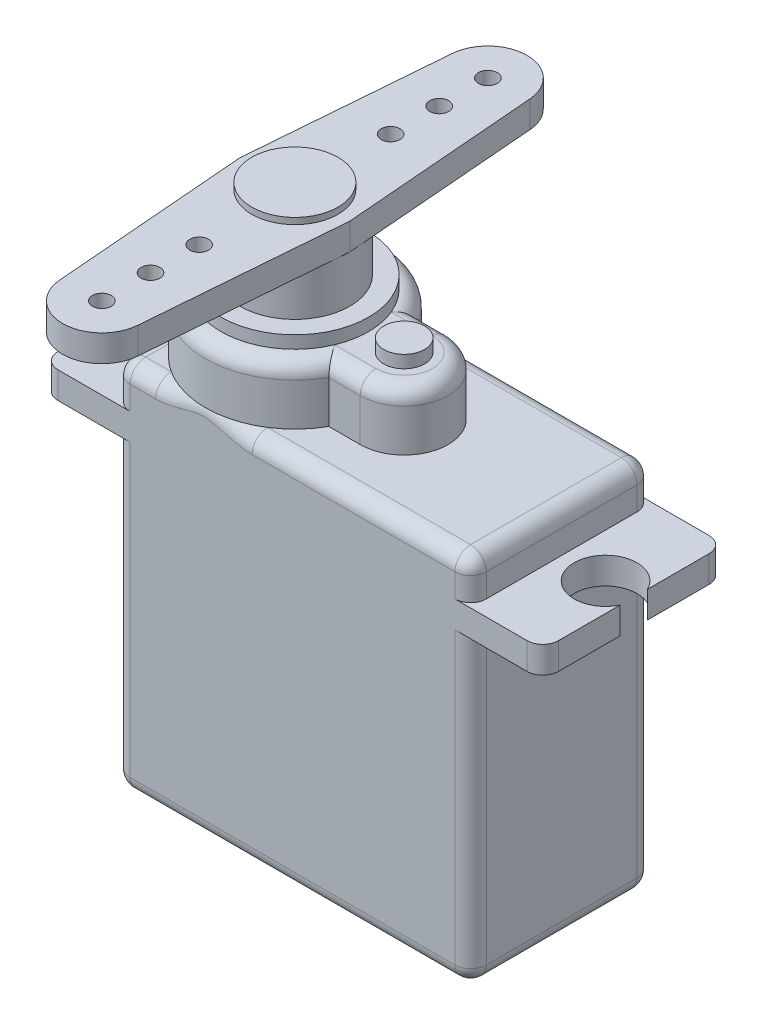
ISO-10303-21;
HEADER;
FILE_DESCRIPTION(('STEP AP214'),'2;1');
FILE_NAME('part.step','',(''),(''),'','','');
FILE_SCHEMA(('AUTOMOTIVE_DESIGN { 1 0 10303 214 1 1 1 1 }'));
ENDSEC;
DATA;
#1=APPLICATION_CONTEXT('core data for automotive mechanical design processes');
#2=APPLICATION_PROTOCOL_DEFINITION('international standard','automotive_design',2000,#1);
#3=PRODUCT_CONTEXT('',#1,'mechanical');
#4=PRODUCT('Part','Part','',(#3));
#5=PRODUCT_RELATED_PRODUCT_CATEGORY('part','',(#4));
#6=PRODUCT_DEFINITION_FORMATION('','',#4);
#7=PRODUCT_DEFINITION_CONTEXT('part definition',#1,'design');
#8=PRODUCT_DEFINITION('design','',#6,#7);
#9=PRODUCT_DEFINITION_SHAPE('','',#8);
#10=(LENGTH_UNIT() NAMED_UNIT(*) SI_UNIT(.MILLI.,.METRE.));
#11=(NAMED_UNIT(*) PLANE_ANGLE_UNIT() SI_UNIT($,.RADIAN.));
#12=(NAMED_UNIT(*) SI_UNIT($,.STERADIAN.) SOLID_ANGLE_UNIT());
#13=UNCERTAINTY_MEASURE_WITH_UNIT(LENGTH_MEASURE(1.E-05),#10,'distance_accuracy_value','');
#14=(GEOMETRIC_REPRESENTATION_CONTEXT(3) GLOBAL_UNCERTAINTY_ASSIGNED_CONTEXT((#13)) GLOBAL_UNIT_ASSIGNED_CONTEXT((#10,
#11,#12)) REPRESENTATION_CONTEXT('',''));
#15=CARTESIAN_POINT('',(0.,0.,0.));
#16=DIRECTION('',(0.,0.,1.));
#17=DIRECTION('',(1.,0.,0.));
#18=AXIS2_PLACEMENT_3D('',#15,#16,#17);
#19=CARTESIAN_POINT('',(5.7,32.9,-12.3));
#20=DIRECTION('',(0.,-1.,0.));
#21=DIRECTION('',(0.,0.,-1.));
#22=AXIS2_PLACEMENT_3D('',#19,#20,#21);
#23=PLANE('',#22);
#24=CARTESIAN_POINT('',(5.7,32.9,-6.1));
#25=DIRECTION('',(0.,1.,0.));
#26=DIRECTION('',(0.,0.,1.));
#27=AXIS2_PLACEMENT_3D('',#24,#25,#26);
#28=CIRCLE('',#27,0.6);
#29=CARTESIAN_POINT('',(5.7,32.9,-5.5));
#30=VERTEX_POINT('',#29);
#31=EDGE_CURVE('E236',#30,#30,#28,.T.);
#32=ORIENTED_EDGE('',*,*,#31,.F.);
#33=EDGE_LOOP('',(#32));
#34=FACE_BOUND('',#33,.T.);
#35=CARTESIAN_POINT('',(5.7,32.9,-12.3));
#36=DIRECTION('',(0.,1.,0.));
#37=DIRECTION('',(0.,0.,1.));
#38=AXIS2_PLACEMENT_3D('',#35,#36,#37);
#39=CIRCLE('',#38,0.6);
#40=CARTESIAN_POINT('',(5.7,32.9,-11.7));
#41=VERTEX_POINT('',#40);
#42=EDGE_CURVE('E224',#41,#41,#39,.T.);
#43=ORIENTED_EDGE('',*,*,#42,.F.);
#44=EDGE_LOOP('',(#43));
#45=FACE_BOUND('',#44,.T.);
#46=CARTESIAN_POINT('',(5.7,32.9,9.2));
#47=DIRECTION('',(0.,1.,0.));
#48=DIRECTION('',(0.,0.,1.));
#49=AXIS2_PLACEMENT_3D('',#46,#47,#48);
#50=CIRCLE('',#49,0.6);
#51=CARTESIAN_POINT('',(5.7,32.9,9.8));
#52=VERTEX_POINT('',#51);
#53=EDGE_CURVE('E212',#52,#52,#50,.T.);
#54=ORIENTED_EDGE('',*,*,#53,.F.);
#55=EDGE_LOOP('',(#54));
#56=FACE_BOUND('',#55,.T.);
#57=DIRECTION('',(-0.0803800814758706,0.,-0.996764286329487));
#58=VECTOR('',#57,1.);
#59=CARTESIAN_POINT('',(9.2,32.9,0.));
#60=LINE('',#59,#58);
#61=CARTESIAN_POINT('',(9.2,32.9,0.));
#62=VERTEX_POINT('',#61);
#63=CARTESIAN_POINT('',(8.19191071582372,32.9,-12.5009502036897));
#64=VERTEX_POINT('',#63);
#65=EDGE_CURVE('E126',#62,#64,#60,.T.);
#66=ORIENTED_EDGE('',*,*,#65,.T.);
#67=CARTESIAN_POINT('',(5.7,32.9,-12.3));
#68=DIRECTION('',(0.,1.,0.));
#69=DIRECTION('',(0.,0.,-1.));
#70=AXIS2_PLACEMENT_3D('',#67,#68,#69);
#71=CIRCLE('',#70,2.5);
#72=CARTESIAN_POINT('',(3.20808928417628,32.9,-12.5009502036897));
#73=VERTEX_POINT('',#72);
#74=EDGE_CURVE('E116',#64,#73,#71,.T.);
#75=ORIENTED_EDGE('',*,*,#74,.T.);
#76=DIRECTION('',(-0.0803800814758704,0.,0.996764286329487));
#77=VECTOR('',#76,1.);
#78=CARTESIAN_POINT('',(2.2,32.9,0.));
#79=LINE('',#78,#77);
#80=CARTESIAN_POINT('',(2.2,32.9,0.));
#81=VERTEX_POINT('',#80);
#82=EDGE_CURVE('E125',#73,#81,#79,.T.);
#83=ORIENTED_EDGE('',*,*,#82,.T.);
#84=DIRECTION('',(0.0803800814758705,0.,0.996764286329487));
#85=VECTOR('',#84,1.);
#86=CARTESIAN_POINT('',(2.2,32.9,0.));
#87=LINE('',#86,#85);
#88=CARTESIAN_POINT('',(3.20808928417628,32.9,12.5009502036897));
#89=VERTEX_POINT('',#88);
#90=EDGE_CURVE('E199',#81,#89,#87,.T.);
#91=ORIENTED_EDGE('',*,*,#90,.T.);
#92=CARTESIAN_POINT('',(5.7,32.9,12.3));
#93=DIRECTION('',(0.,1.,0.));
#94=DIRECTION('',(0.,0.,-1.));
#95=AXIS2_PLACEMENT_3D('',#92,#93,#94);
#96=CIRCLE('',#95,2.5);
#97=CARTESIAN_POINT('',(8.19191071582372,32.9,12.5009502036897));
#98=VERTEX_POINT('',#97);
#99=EDGE_CURVE('E201',#89,#98,#96,.T.);
#100=ORIENTED_EDGE('',*,*,#99,.T.);
#101=DIRECTION('',(0.0803800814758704,0.,-0.996764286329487));
#102=VECTOR('',#101,1.);
#103=CARTESIAN_POINT('',(9.2,32.9,0.));
#104=LINE('',#103,#102);
#105=EDGE_CURVE('E131',#98,#62,#104,.T.);
#106=ORIENTED_EDGE('',*,*,#105,.T.);
#107=EDGE_LOOP('',(#66,#75,#83,#91,#100,#106));
#108=FACE_BOUND('',#107,.T.);
#109=CARTESIAN_POINT('',(5.7,32.9,12.3));
#110=DIRECTION('',(0.,1.,0.));
#111=DIRECTION('',(0.,0.,1.));
#112=AXIS2_PLACEMENT_3D('',#109,#110,#111);
#113=CIRCLE('',#112,0.6);
#114=CARTESIAN_POINT('',(5.7,32.9,12.9));
#115=VERTEX_POINT('',#114);
#116=EDGE_CURVE('E205',#115,#115,#113,.T.);
#117=ORIENTED_EDGE('',*,*,#116,.F.);
#118=EDGE_LOOP('',(#117));
#119=FACE_BOUND('',#118,.T.);
#120=CARTESIAN_POINT('',(5.7,32.9,6.1));
#121=DIRECTION('',(0.,1.,0.));
#122=DIRECTION('',(0.,0.,1.));
#123=AXIS2_PLACEMENT_3D('',#120,#121,#122);
#124=CIRCLE('',#123,0.6);
#125=CARTESIAN_POINT('',(5.7,32.9,6.7));
#126=VERTEX_POINT('',#125);
#127=EDGE_CURVE('E218',#126,#126,#124,.T.);
#128=ORIENTED_EDGE('',*,*,#127,.F.);
#129=EDGE_LOOP('',(#128));
#130=FACE_BOUND('',#129,.T.);
#131=CARTESIAN_POINT('',(5.7,32.9,-9.2));
#132=DIRECTION('',(0.,1.,0.));
#133=DIRECTION('',(0.,0.,1.));
#134=AXIS2_PLACEMENT_3D('',#131,#132,#133);
#135=CIRCLE('',#134,0.6);
#136=CARTESIAN_POINT('',(5.7,32.9,-8.6));
#137=VERTEX_POINT('',#136);
#138=EDGE_CURVE('E230',#137,#137,#135,.T.);
#139=ORIENTED_EDGE('',*,*,#138,.F.);
#140=EDGE_LOOP('',(#139));
#141=FACE_BOUND('',#140,.T.);
#142=CARTESIAN_POINT('',(5.7,32.9,0.));
#143=DIRECTION('',(0.,-1.,0.));
#144=DIRECTION('',(0.,0.,-1.));
#145=AXIS2_PLACEMENT_3D('',#142,#143,#144);
#146=CIRCLE('',#145,2.75);
#147=CARTESIAN_POINT('',(5.7,32.9,-2.75));
#148=VERTEX_POINT('',#147);
#149=EDGE_CURVE('E12',#148,#148,#146,.F.);
#150=ORIENTED_EDGE('',*,*,#149,.F.);
#151=EDGE_LOOP('',(#150));
#152=FACE_BOUND('',#151,.T.);
#153=ADVANCED_FACE('F49',(#34,#45,#56,#108,#119,#130,#141,#152),#23,.F.);
#154=CARTESIAN_POINT('',(5.7,31.2,0.));
#155=DIRECTION('',(0.,1.,0.));
#156=DIRECTION('',(0.,0.,1.));
#157=AXIS2_PLACEMENT_3D('',#154,#155,#156);
#158=PLANE('',#157);
#159=DIRECTION('',(-0.0803800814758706,0.,-0.996764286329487));
#160=VECTOR('',#159,1.);
#161=CARTESIAN_POINT('',(9.2,31.2,0.));
#162=LINE('',#161,#160);
#163=CARTESIAN_POINT('',(9.2,31.2,0.));
#164=VERTEX_POINT('',#163);
#165=CARTESIAN_POINT('',(9.15477329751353,31.2,-0.5608399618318));
#166=VERTEX_POINT('',#165);
#167=EDGE_CURVE('E180',#164,#166,#162,.T.);
#168=ORIENTED_EDGE('',*,*,#167,.F.);
#169=CARTESIAN_POINT('',(5.7,31.2,0.));
#170=DIRECTION('',(0.,1.,0.));
#171=DIRECTION('',(0.,0.,1.));
#172=AXIS2_PLACEMENT_3D('',#169,#170,#171);
#173=CIRCLE('',#172,3.5);
#174=EDGE_CURVE('E151',#164,#166,#173,.T.);
#175=ORIENTED_EDGE('',*,*,#174,.T.);
#176=EDGE_LOOP('',(#168,#175));
#177=FACE_BOUND('',#176,.T.);
#178=ADVANCED_FACE('F258',(#177),#158,.T.);
#179=DIRECTION('',(0.0803800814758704,0.,-0.996764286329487));
#180=VECTOR('',#179,1.);
#181=CARTESIAN_POINT('',(9.2,31.2,0.));
#182=LINE('',#181,#180);
#183=CARTESIAN_POINT('',(9.15477329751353,31.2,0.560839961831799));
#184=VERTEX_POINT('',#183);
#185=EDGE_CURVE('E57',#184,#164,#182,.T.);
#186=ORIENTED_EDGE('',*,*,#185,.F.);
#187=EDGE_CURVE('E149',#184,#164,#173,.T.);
#188=ORIENTED_EDGE('',*,*,#187,.T.);
#189=EDGE_LOOP('',(#186,#188));
#190=FACE_BOUND('',#189,.T.);
#191=ADVANCED_FACE('F264',(#190),#158,.T.);
#192=DIRECTION('',(0.0803800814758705,0.,0.996764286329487));
#193=VECTOR('',#192,1.);
#194=CARTESIAN_POINT('',(2.2,31.2,0.));
#195=LINE('',#194,#193);
#196=CARTESIAN_POINT('',(2.2,31.2,0.));
#197=VERTEX_POINT('',#196);
#198=CARTESIAN_POINT('',(2.24522670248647,31.2,0.56083996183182));
#199=VERTEX_POINT('',#198);
#200=EDGE_CURVE('E178',#197,#199,#195,.T.);
#201=ORIENTED_EDGE('',*,*,#200,.F.);
#202=EDGE_CURVE('E158',#197,#199,#173,.T.);
#203=ORIENTED_EDGE('',*,*,#202,.T.);
#204=EDGE_LOOP('',(#201,#203));
#205=FACE_BOUND('',#204,.T.);
#206=ADVANCED_FACE('F295',(#205),#158,.T.);
#207=CARTESIAN_POINT('',(5.7,31.2,0.));
#208=DIRECTION('',(0.,-1.,0.));
#209=DIRECTION('',(0.,0.,-1.));
#210=AXIS2_PLACEMENT_3D('',#207,#208,#209);
#211=CYLINDRICAL_SURFACE('',#210,3.5);
#212=ORIENTED_EDGE('',*,*,#187,.F.);
#213=EDGE_CURVE('E64',#199,#184,#173,.T.);
#214=ORIENTED_EDGE('',*,*,#213,.F.);
#215=ORIENTED_EDGE('',*,*,#202,.F.);
#216=CARTESIAN_POINT('',(2.24522670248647,31.2,-0.56083996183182));
#217=VERTEX_POINT('',#216);
#218=EDGE_CURVE('E163',#217,#197,#173,.T.);
#219=ORIENTED_EDGE('',*,*,#218,.F.);
#220=EDGE_CURVE('E157',#166,#217,#173,.T.);
#221=ORIENTED_EDGE('',*,*,#220,.F.);
#222=ORIENTED_EDGE('',*,*,#174,.F.);
#223=EDGE_LOOP('',(#212,#214,#215,#219,#221,#222));
#224=FACE_BOUND('',#223,.T.);
#225=CARTESIAN_POINT('',(5.7,28.2,0.));
#226=DIRECTION('',(0.,1.,0.));
#227=DIRECTION('',(0.,0.,1.));
#228=AXIS2_PLACEMENT_3D('',#225,#226,#227);
#229=CIRCLE('',#228,3.5);
#230=CARTESIAN_POINT('',(5.7,28.2,3.5));
#231=VERTEX_POINT('',#230);
#232=EDGE_CURVE('E142',#231,#231,#229,.T.);
#233=ORIENTED_EDGE('',*,*,#232,.T.);
#234=EDGE_LOOP('',(#233));
#235=FACE_BOUND('',#234,.T.);
#236=ADVANCED_FACE('F51',(#224,#235),#211,.T.);
#237=DIRECTION('',(-0.0803800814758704,0.,0.996764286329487));
#238=VECTOR('',#237,1.);
#239=CARTESIAN_POINT('',(2.2,31.2,0.));
#240=LINE('',#239,#238);
#241=EDGE_CURVE('E71',#217,#197,#240,.T.);
#242=ORIENTED_EDGE('',*,*,#241,.F.);
#243=ORIENTED_EDGE('',*,*,#218,.T.);
#244=EDGE_LOOP('',(#242,#243));
#245=FACE_BOUND('',#244,.T.);
#246=ADVANCED_FACE('F267',(#245),#158,.T.);
#247=CARTESIAN_POINT('',(5.7,28.2,0.));
#248=DIRECTION('',(0.,1.,0.));
#249=DIRECTION('',(0.,0.,1.));
#250=AXIS2_PLACEMENT_3D('',#247,#248,#249);
#251=PLANE('',#250);
#252=ORIENTED_EDGE('',*,*,#232,.F.);
#253=EDGE_LOOP('',(#252));
#254=FACE_BOUND('',#253,.T.);
#255=ADVANCED_FACE('F294',(#254),#251,.F.);
#256=CARTESIAN_POINT('',(5.7,31.2,-12.3));
#257=DIRECTION('',(0.,-1.,0.));
#258=DIRECTION('',(0.,0.,-1.));
#259=AXIS2_PLACEMENT_3D('',#256,#257,#258);
#260=PLANE('',#259);
#261=CARTESIAN_POINT('',(5.7,31.2,-6.1));
#262=DIRECTION('',(0.,1.,0.));
#263=DIRECTION('',(0.,0.,1.));
#264=AXIS2_PLACEMENT_3D('',#261,#262,#263);
#265=CIRCLE('',#264,0.6);
#266=CARTESIAN_POINT('',(5.7,31.2,-5.5));
#267=VERTEX_POINT('',#266);
#268=EDGE_CURVE('E239',#267,#267,#265,.T.);
#269=ORIENTED_EDGE('',*,*,#268,.T.);
#270=EDGE_LOOP('',(#269));
#271=FACE_BOUND('',#270,.T.);
#272=CARTESIAN_POINT('',(5.7,31.2,-12.3));
#273=DIRECTION('',(0.,1.,0.));
#274=DIRECTION('',(0.,0.,1.));
#275=AXIS2_PLACEMENT_3D('',#272,#273,#274);
#276=CIRCLE('',#275,0.6);
#277=CARTESIAN_POINT('',(5.7,31.2,-11.7));
#278=VERTEX_POINT('',#277);
#279=EDGE_CURVE('E227',#278,#278,#276,.T.);
#280=ORIENTED_EDGE('',*,*,#279,.T.);
#281=EDGE_LOOP('',(#280));
#282=FACE_BOUND('',#281,.T.);
#283=CARTESIAN_POINT('',(5.7,31.2,-9.2));
#284=DIRECTION('',(0.,1.,0.));
#285=DIRECTION('',(0.,0.,1.));
#286=AXIS2_PLACEMENT_3D('',#283,#284,#285);
#287=CIRCLE('',#286,0.6);
#288=CARTESIAN_POINT('',(5.7,31.2,-8.6));
#289=VERTEX_POINT('',#288);
#290=EDGE_CURVE('E233',#289,#289,#287,.T.);
#291=ORIENTED_EDGE('',*,*,#290,.T.);
#292=EDGE_LOOP('',(#291));
#293=FACE_BOUND('',#292,.T.);
#294=CARTESIAN_POINT('',(8.19191071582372,31.2,-12.5009502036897));
#295=VERTEX_POINT('',#294);
#296=EDGE_CURVE('E140',#166,#295,#162,.T.);
#297=ORIENTED_EDGE('',*,*,#296,.F.);
#298=ORIENTED_EDGE('',*,*,#220,.T.);
#299=CARTESIAN_POINT('',(3.20808928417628,31.2,-12.5009502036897));
#300=VERTEX_POINT('',#299);
#301=EDGE_CURVE('E155',#300,#217,#240,.T.);
#302=ORIENTED_EDGE('',*,*,#301,.F.);
#303=CARTESIAN_POINT('',(5.7,31.2,-12.3));
#304=DIRECTION('',(0.,1.,0.));
#305=DIRECTION('',(0.,0.,-1.));
#306=AXIS2_PLACEMENT_3D('',#303,#304,#305);
#307=CIRCLE('',#306,2.5);
#308=EDGE_CURVE('E177',#295,#300,#307,.T.);
#309=ORIENTED_EDGE('',*,*,#308,.F.);
#310=EDGE_LOOP('',(#297,#298,#302,#309));
#311=FACE_BOUND('',#310,.T.);
#312=ADVANCED_FACE('F170',(#271,#282,#293,#311),#260,.T.);
#313=CARTESIAN_POINT('',(5.7,31.2,6.1));
#314=DIRECTION('',(0.,1.,0.));
#315=DIRECTION('',(0.,0.,1.));
#316=AXIS2_PLACEMENT_3D('',#313,#314,#315);
#317=CIRCLE('',#316,0.6);
#318=CARTESIAN_POINT('',(5.7,31.2,6.7));
#319=VERTEX_POINT('',#318);
#320=EDGE_CURVE('E221',#319,#319,#317,.T.);
#321=ORIENTED_EDGE('',*,*,#320,.T.);
#322=EDGE_LOOP('',(#321));
#323=FACE_BOUND('',#322,.T.);
#324=CARTESIAN_POINT('',(5.7,31.2,12.3));
#325=DIRECTION('',(0.,1.,0.));
#326=DIRECTION('',(0.,0.,1.));
#327=AXIS2_PLACEMENT_3D('',#324,#325,#326);
#328=CIRCLE('',#327,0.6);
#329=CARTESIAN_POINT('',(5.7,31.2,12.9));
#330=VERTEX_POINT('',#329);
#331=EDGE_CURVE('E207',#330,#330,#328,.T.);
#332=ORIENTED_EDGE('',*,*,#331,.T.);
#333=EDGE_LOOP('',(#332));
#334=FACE_BOUND('',#333,.T.);
#335=CARTESIAN_POINT('',(3.20808928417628,31.2,12.5009502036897));
#336=VERTEX_POINT('',#335);
#337=EDGE_CURVE('E176',#199,#336,#195,.T.);
#338=ORIENTED_EDGE('',*,*,#337,.F.);
#339=ORIENTED_EDGE('',*,*,#213,.T.);
#340=CARTESIAN_POINT('',(8.19191071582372,31.2,12.5009502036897));
#341=VERTEX_POINT('',#340);
#342=EDGE_CURVE('E135',#341,#184,#182,.T.);
#343=ORIENTED_EDGE('',*,*,#342,.F.);
#344=CARTESIAN_POINT('',(5.7,31.2,12.3));
#345=DIRECTION('',(0.,1.,0.));
#346=DIRECTION('',(0.,0.,-1.));
#347=AXIS2_PLACEMENT_3D('',#344,#345,#346);
#348=CIRCLE('',#347,2.5);
#349=EDGE_CURVE('E185',#336,#341,#348,.T.);
#350=ORIENTED_EDGE('',*,*,#349,.F.);
#351=EDGE_LOOP('',(#338,#339,#343,#350));
#352=FACE_BOUND('',#351,.T.);
#353=CARTESIAN_POINT('',(5.7,31.2,9.2));
#354=DIRECTION('',(0.,1.,0.));
#355=DIRECTION('',(0.,0.,1.));
#356=AXIS2_PLACEMENT_3D('',#353,#354,#355);
#357=CIRCLE('',#356,0.6);
#358=CARTESIAN_POINT('',(5.7,31.2,9.8));
#359=VERTEX_POINT('',#358);
#360=EDGE_CURVE('E215',#359,#359,#357,.T.);
#361=ORIENTED_EDGE('',*,*,#360,.T.);
#362=EDGE_LOOP('',(#361));
#363=FACE_BOUND('',#362,.T.);
#364=ADVANCED_FACE('F274',(#323,#334,#352,#363),#260,.T.);
#365=CARTESIAN_POINT('',(9.2,32.9,0.));
#366=DIRECTION('',(-0.996764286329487,0.,0.0803800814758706));
#367=DIRECTION('',(0.0803800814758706,0.,0.996764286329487));
#368=AXIS2_PLACEMENT_3D('',#365,#366,#367);
#369=PLANE('',#368);
#370=ORIENTED_EDGE('',*,*,#167,.T.);
#371=ORIENTED_EDGE('',*,*,#296,.T.);
#372=DIRECTION('',(0.,-1.,0.));
#373=VECTOR('',#372,1.);
#374=CARTESIAN_POINT('',(8.19191071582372,32.9,-12.5009502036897));
#375=LINE('',#374,#373);
#376=EDGE_CURVE('E120',#64,#295,#375,.T.);
#377=ORIENTED_EDGE('',*,*,#376,.F.);
#378=ORIENTED_EDGE('',*,*,#65,.F.);
#379=DIRECTION('',(0.,-1.,0.));
#380=VECTOR('',#379,1.);
#381=CARTESIAN_POINT('',(9.2,32.9,0.));
#382=LINE('',#381,#380);
#383=EDGE_CURVE('E188',#62,#164,#382,.T.);
#384=ORIENTED_EDGE('',*,*,#383,.T.);
#385=EDGE_LOOP('',(#370,#371,#377,#378,#384));
#386=FACE_BOUND('',#385,.T.);
#387=ADVANCED_FACE('F138',(#386),#369,.F.);
#388=CARTESIAN_POINT('',(5.7,32.9,-12.3));
#389=DIRECTION('',(0.,-1.,0.));
#390=DIRECTION('',(0.,0.,-1.));
#391=AXIS2_PLACEMENT_3D('',#388,#389,#390);
#392=CYLINDRICAL_SURFACE('',#391,2.5);
#393=ORIENTED_EDGE('',*,*,#308,.T.);
#394=DIRECTION('',(0.,-1.,0.));
#395=VECTOR('',#394,1.);
#396=CARTESIAN_POINT('',(3.20808928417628,32.9,-12.5009502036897));
#397=LINE('',#396,#395);
#398=EDGE_CURVE('E122',#73,#300,#397,.T.);
#399=ORIENTED_EDGE('',*,*,#398,.F.);
#400=ORIENTED_EDGE('',*,*,#74,.F.);
#401=ORIENTED_EDGE('',*,*,#376,.T.);
#402=EDGE_LOOP('',(#393,#399,#400,#401));
#403=FACE_BOUND('',#402,.T.);
#404=ADVANCED_FACE('F118',(#403),#392,.T.);
#405=CARTESIAN_POINT('',(2.2,32.9,0.));
#406=DIRECTION('',(0.996764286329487,0.,0.0803800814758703));
#407=DIRECTION('',(0.0803800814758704,0.,-0.996764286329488));
#408=AXIS2_PLACEMENT_3D('',#405,#406,#407);
#409=PLANE('',#408);
#410=ORIENTED_EDGE('',*,*,#301,.T.);
#411=ORIENTED_EDGE('',*,*,#241,.T.);
#412=DIRECTION('',(0.,-1.,0.));
#413=VECTOR('',#412,1.);
#414=CARTESIAN_POINT('',(2.2,32.9,0.));
#415=LINE('',#414,#413);
#416=EDGE_CURVE('E145',#81,#197,#415,.T.);
#417=ORIENTED_EDGE('',*,*,#416,.F.);
#418=ORIENTED_EDGE('',*,*,#82,.F.);
#419=ORIENTED_EDGE('',*,*,#398,.T.);
#420=EDGE_LOOP('',(#410,#411,#417,#418,#419));
#421=FACE_BOUND('',#420,.T.);
#422=ADVANCED_FACE('F173',(#421),#409,.F.);
#423=CARTESIAN_POINT('',(2.2,32.9,0.));
#424=DIRECTION('',(0.996764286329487,0.,-0.0803800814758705));
#425=DIRECTION('',(-0.0803800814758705,0.,-0.996764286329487));
#426=AXIS2_PLACEMENT_3D('',#423,#424,#425);
#427=PLANE('',#426);
#428=ORIENTED_EDGE('',*,*,#200,.T.);
#429=ORIENTED_EDGE('',*,*,#337,.T.);
#430=DIRECTION('',(0.,-1.,0.));
#431=VECTOR('',#430,1.);
#432=CARTESIAN_POINT('',(3.20808928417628,32.9,12.5009502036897));
#433=LINE('',#432,#431);
#434=EDGE_CURVE('E193',#89,#336,#433,.T.);
#435=ORIENTED_EDGE('',*,*,#434,.F.);
#436=ORIENTED_EDGE('',*,*,#90,.F.);
#437=ORIENTED_EDGE('',*,*,#416,.T.);
#438=EDGE_LOOP('',(#428,#429,#435,#436,#437));
#439=FACE_BOUND('',#438,.T.);
#440=ADVANCED_FACE('F197',(#439),#427,.F.);
#441=CARTESIAN_POINT('',(5.7,32.9,12.3));
#442=DIRECTION('',(0.,-1.,0.));
#443=DIRECTION('',(0.,0.,-1.));
#444=AXIS2_PLACEMENT_3D('',#441,#442,#443);
#445=CYLINDRICAL_SURFACE('',#444,2.5);
#446=ORIENTED_EDGE('',*,*,#349,.T.);
#447=DIRECTION('',(0.,-1.,0.));
#448=VECTOR('',#447,1.);
#449=CARTESIAN_POINT('',(8.19191071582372,32.9,12.5009502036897));
#450=LINE('',#449,#448);
#451=EDGE_CURVE('E190',#98,#341,#450,.T.);
#452=ORIENTED_EDGE('',*,*,#451,.F.);
#453=ORIENTED_EDGE('',*,*,#99,.F.);
#454=ORIENTED_EDGE('',*,*,#434,.T.);
#455=EDGE_LOOP('',(#446,#452,#453,#454));
#456=FACE_BOUND('',#455,.T.);
#457=ADVANCED_FACE('F281',(#456),#445,.T.);
#458=CARTESIAN_POINT('',(9.2,32.9,0.));
#459=DIRECTION('',(-0.996764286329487,0.,-0.0803800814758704));
#460=DIRECTION('',(-0.0803800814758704,0.,0.996764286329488));
#461=AXIS2_PLACEMENT_3D('',#458,#459,#460);
#462=PLANE('',#461);
#463=ORIENTED_EDGE('',*,*,#342,.T.);
#464=ORIENTED_EDGE('',*,*,#185,.T.);
#465=ORIENTED_EDGE('',*,*,#383,.F.);
#466=ORIENTED_EDGE('',*,*,#105,.F.);
#467=ORIENTED_EDGE('',*,*,#451,.T.);
#468=EDGE_LOOP('',(#463,#464,#465,#466,#467));
#469=FACE_BOUND('',#468,.T.);
#470=ADVANCED_FACE('F278',(#469),#462,.F.);
#471=CARTESIAN_POINT('',(5.7,32.9,12.3));
#472=DIRECTION('',(0.,-1.,0.));
#473=DIRECTION('',(0.,0.,-1.));
#474=AXIS2_PLACEMENT_3D('',#471,#472,#473);
#475=CYLINDRICAL_SURFACE('',#474,0.6);
#476=ORIENTED_EDGE('',*,*,#116,.T.);
#477=EDGE_LOOP('',(#476));
#478=FACE_BOUND('',#477,.T.);
#479=ORIENTED_EDGE('',*,*,#331,.F.);
#480=EDGE_LOOP('',(#479));
#481=FACE_BOUND('',#480,.T.);
#482=ADVANCED_FACE('F272',(#478,#481),#475,.F.);
#483=CARTESIAN_POINT('',(5.7,32.9,9.2));
#484=DIRECTION('',(0.,-1.,0.));
#485=DIRECTION('',(0.,0.,-1.));
#486=AXIS2_PLACEMENT_3D('',#483,#484,#485);
#487=CYLINDRICAL_SURFACE('',#486,0.6);
#488=ORIENTED_EDGE('',*,*,#53,.T.);
#489=EDGE_LOOP('',(#488));
#490=FACE_BOUND('',#489,.T.);
#491=ORIENTED_EDGE('',*,*,#360,.F.);
#492=EDGE_LOOP('',(#491));
#493=FACE_BOUND('',#492,.T.);
#494=ADVANCED_FACE('F319',(#490,#493),#487,.F.);
#495=CARTESIAN_POINT('',(5.7,32.9,6.1));
#496=DIRECTION('',(0.,-1.,0.));
#497=DIRECTION('',(0.,0.,-1.));
#498=AXIS2_PLACEMENT_3D('',#495,#496,#497);
#499=CYLINDRICAL_SURFACE('',#498,0.6);
#500=ORIENTED_EDGE('',*,*,#127,.T.);
#501=EDGE_LOOP('',(#500));
#502=FACE_BOUND('',#501,.T.);
#503=ORIENTED_EDGE('',*,*,#320,.F.);
#504=EDGE_LOOP('',(#503));
#505=FACE_BOUND('',#504,.T.);
#506=ADVANCED_FACE('F321',(#502,#505),#499,.F.);
#507=CARTESIAN_POINT('',(5.7,32.9,-12.3));
#508=DIRECTION('',(0.,-1.,0.));
#509=DIRECTION('',(0.,0.,-1.));
#510=AXIS2_PLACEMENT_3D('',#507,#508,#509);
#511=CYLINDRICAL_SURFACE('',#510,0.6);
#512=ORIENTED_EDGE('',*,*,#42,.T.);
#513=EDGE_LOOP('',(#512));
#514=FACE_BOUND('',#513,.T.);
#515=ORIENTED_EDGE('',*,*,#279,.F.);
#516=EDGE_LOOP('',(#515));
#517=FACE_BOUND('',#516,.T.);
#518=ADVANCED_FACE('F327',(#514,#517),#511,.F.);
#519=CARTESIAN_POINT('',(5.7,32.9,-9.2));
#520=DIRECTION('',(0.,-1.,0.));
#521=DIRECTION('',(0.,0.,-1.));
#522=AXIS2_PLACEMENT_3D('',#519,#520,#521);
#523=CYLINDRICAL_SURFACE('',#522,0.6);
#524=ORIENTED_EDGE('',*,*,#138,.T.);
#525=EDGE_LOOP('',(#524));
#526=FACE_BOUND('',#525,.T.);
#527=ORIENTED_EDGE('',*,*,#290,.F.);
#528=EDGE_LOOP('',(#527));
#529=FACE_BOUND('',#528,.T.);
#530=ADVANCED_FACE('F333',(#526,#529),#523,.F.);
#531=CARTESIAN_POINT('',(5.7,32.9,-6.1));
#532=DIRECTION('',(0.,-1.,0.));
#533=DIRECTION('',(0.,0.,-1.));
#534=AXIS2_PLACEMENT_3D('',#531,#532,#533);
#535=CYLINDRICAL_SURFACE('',#534,0.6);
#536=ORIENTED_EDGE('',*,*,#31,.T.);
#537=EDGE_LOOP('',(#536));
#538=FACE_BOUND('',#537,.T.);
#539=ORIENTED_EDGE('',*,*,#268,.F.);
#540=EDGE_LOOP('',(#539));
#541=FACE_BOUND('',#540,.T.);
#542=ADVANCED_FACE('F253',(#538,#541),#535,.F.);
#543=CARTESIAN_POINT('',(5.7,33.3,0.));
#544=DIRECTION('',(0.,-1.,0.));
#545=DIRECTION('',(0.,0.,-1.));
#546=AXIS2_PLACEMENT_3D('',#543,#544,#545);
#547=CYLINDRICAL_SURFACE('',#546,2.75);
#548=CARTESIAN_POINT('',(5.7,33.3,0.));
#549=DIRECTION('',(0.,1.,0.));
#550=DIRECTION('',(0.,0.,1.));
#551=AXIS2_PLACEMENT_3D('',#548,#549,#550);
#552=CIRCLE('',#551,2.75);
#553=CARTESIAN_POINT('',(5.7,33.3,2.75));
#554=VERTEX_POINT('',#553);
#555=EDGE_CURVE('E242',#554,#554,#552,.T.);
#556=ORIENTED_EDGE('',*,*,#555,.F.);
#557=EDGE_LOOP('',(#556));
#558=FACE_BOUND('',#557,.T.);
#559=ORIENTED_EDGE('',*,*,#149,.T.);
#560=EDGE_LOOP('',(#559));
#561=FACE_BOUND('',#560,.T.);
#562=ADVANCED_FACE('F250',(#558,#561),#547,.T.);
#563=CARTESIAN_POINT('',(5.7,33.3,0.));
#564=DIRECTION('',(0.,1.,0.));
#565=DIRECTION('',(0.,0.,1.));
#566=AXIS2_PLACEMENT_3D('',#563,#564,#565);
#567=PLANE('',#566);
#568=ORIENTED_EDGE('',*,*,#555,.T.);
#569=EDGE_LOOP('',(#568));
#570=FACE_BOUND('',#569,.T.);
#571=ADVANCED_FACE('F248',(#570),#567,.T.);
#572=CLOSED_SHELL('',(#153,#178,#191,#206,#236,#246,#255,#312,#364,#387,#404,#422,#440,#457,
#470,#482,#494,#506,#518,#530,#542,#562,#571));
#573=MANIFOLD_SOLID_BREP('B2',#572);
#574=CARTESIAN_POINT('',(0.,23.7,-5.8));
#575=DIRECTION('',(0.,-1.,0.));
#576=DIRECTION('',(0.,0.,-1.));
#577=AXIS2_PLACEMENT_3D('',#574,#575,#576);
#578=PLANE('',#577);
#579=DIRECTION('',(-1.,0.,0.));
#580=VECTOR('',#579,1.);
#581=CARTESIAN_POINT('',(0.,23.7,-4.8));
#582=LINE('',#581,#580);
#583=CARTESIAN_POINT('',(2.62591477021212,23.7,-4.8));
#584=VERTEX_POINT('',#583);
#585=CARTESIAN_POINT('',(1.,23.7,-4.8));
#586=VERTEX_POINT('',#585);
#587=EDGE_CURVE('E1414',#584,#586,#582,.T.);
#588=ORIENTED_EDGE('',*,*,#587,.T.);
#589=DIRECTION('',(0.,0.,1.));
#590=VECTOR('',#589,1.);
#591=CARTESIAN_POINT('',(1.,23.7,-5.8));
#592=LINE('',#591,#590);
#593=CARTESIAN_POINT('',(0.999999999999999,23.7,-3.22490309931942));
#594=VERTEX_POINT('',#593);
#595=EDGE_CURVE('E1416',#586,#594,#592,.T.);
#596=ORIENTED_EDGE('',*,*,#595,.T.);
#597=CARTESIAN_POINT('',(5.7,23.7,0.));
#598=DIRECTION('',(0.,1.,0.));
#599=DIRECTION('',(0.,0.,1.));
#600=AXIS2_PLACEMENT_3D('',#597,#598,#599);
#601=CIRCLE('',#600,5.7);
#602=EDGE_CURVE('E2103',#584,#594,#601,.T.);
#603=ORIENTED_EDGE('',*,*,#602,.F.);
#604=EDGE_LOOP('',(#588,#596,#603));
#605=FACE_BOUND('',#604,.T.);
#606=ADVANCED_FACE('F490',(#605),#578,.F.);
#607=CARTESIAN_POINT('',(1.,23.7,3.22490309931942));
#608=VERTEX_POINT('',#607);
#609=CARTESIAN_POINT('',(2.62591477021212,23.7,4.8));
#610=VERTEX_POINT('',#609);
#611=EDGE_CURVE('E1449',#608,#610,#601,.T.);
#612=ORIENTED_EDGE('',*,*,#611,.F.);
#613=DIRECTION('',(0.,0.,1.));
#614=VECTOR('',#613,1.);
#615=CARTESIAN_POINT('',(1.,23.7,-5.8));
#616=LINE('',#615,#614);
#617=CARTESIAN_POINT('',(1.,23.7,4.8));
#618=VERTEX_POINT('',#617);
#619=EDGE_CURVE('E1412',#608,#618,#616,.T.);
#620=ORIENTED_EDGE('',*,*,#619,.T.);
#621=DIRECTION('',(1.,0.,0.));
#622=VECTOR('',#621,1.);
#623=CARTESIAN_POINT('',(0.,23.7,4.8));
#624=LINE('',#623,#622);
#625=EDGE_CURVE('E1303',#618,#610,#624,.T.);
#626=ORIENTED_EDGE('',*,*,#625,.T.);
#627=EDGE_LOOP('',(#612,#620,#626));
#628=FACE_BOUND('',#627,.T.);
#629=ADVANCED_FACE('F1271',(#628),#578,.F.);
#630=CARTESIAN_POINT('',(27.3,21.2,-5.8));
#631=DIRECTION('',(-1.,0.,0.));
#632=DIRECTION('',(0.,0.,1.));
#633=AXIS2_PLACEMENT_3D('',#630,#631,#632);
#634=PLANE('',#633);
#635=DIRECTION('',(0.,0.,-1.));
#636=VECTOR('',#635,1.);
#637=CARTESIAN_POINT('',(27.3,21.2,-5.8));
#638=LINE('',#637,#636);
#639=CARTESIAN_POINT('',(27.3,21.2,4.8));
#640=VERTEX_POINT('',#639);
#641=CARTESIAN_POINT('',(27.3,21.2,0.871779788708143));
#642=VERTEX_POINT('',#641);
#643=EDGE_CURVE('E777',#640,#642,#638,.T.);
#644=ORIENTED_EDGE('',*,*,#643,.F.);
#645=DIRECTION('',(0.,-1.,0.));
#646=VECTOR('',#645,1.);
#647=CARTESIAN_POINT('',(27.3,21.2,4.8));
#648=LINE('',#647,#646);
#649=CARTESIAN_POINT('',(27.3,19.5,4.8));
#650=VERTEX_POINT('',#649);
#651=EDGE_CURVE('E985',#640,#650,#648,.T.);
#652=ORIENTED_EDGE('',*,*,#651,.T.);
#653=DIRECTION('',(0.,0.,-1.));
#654=VECTOR('',#653,1.);
#655=CARTESIAN_POINT('',(27.3,19.5,-5.8));
#656=LINE('',#655,#654);
#657=CARTESIAN_POINT('',(27.3,19.5,0.871779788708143));
#658=VERTEX_POINT('',#657);
#659=EDGE_CURVE('E804',#650,#658,#656,.T.);
#660=ORIENTED_EDGE('',*,*,#659,.T.);
#661=DIRECTION('',(0.,1.,0.));
#662=VECTOR('',#661,1.);
#663=CARTESIAN_POINT('',(27.3,-0.00102500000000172,0.871779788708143));
#664=LINE('',#663,#662);
#665=EDGE_CURVE('E796',#642,#658,#664,.F.);
#666=ORIENTED_EDGE('',*,*,#665,.F.);
#667=EDGE_LOOP('',(#644,#652,#660,#666));
#668=FACE_BOUND('',#667,.T.);
#669=ADVANCED_FACE('F802',(#668),#634,.F.);
#670=CARTESIAN_POINT('',(-4.6,21.2,5.8));
#671=DIRECTION('',(1.,0.,0.));
#672=DIRECTION('',(0.,0.,-1.));
#673=AXIS2_PLACEMENT_3D('',#670,#671,#672);
#674=PLANE('',#673);
#675=DIRECTION('',(0.,0.,1.));
#676=VECTOR('',#675,1.);
#677=CARTESIAN_POINT('',(-4.6,21.2,5.8));
#678=LINE('',#677,#676);
#679=CARTESIAN_POINT('',(-4.6,21.2,-4.8));
#680=VERTEX_POINT('',#679);
#681=CARTESIAN_POINT('',(-4.6,21.2,-0.871779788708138));
#682=VERTEX_POINT('',#681);
#683=EDGE_CURVE('E905',#680,#682,#678,.T.);
#684=ORIENTED_EDGE('',*,*,#683,.F.);
#685=DIRECTION('',(0.,-1.,0.));
#686=VECTOR('',#685,1.);
#687=CARTESIAN_POINT('',(-4.6,21.2,-4.8));
#688=LINE('',#687,#686);
#689=CARTESIAN_POINT('',(-4.6,19.5,-4.8));
#690=VERTEX_POINT('',#689);
#691=EDGE_CURVE('E875',#680,#690,#688,.T.);
#692=ORIENTED_EDGE('',*,*,#691,.T.);
#693=DIRECTION('',(0.,0.,1.));
#694=VECTOR('',#693,1.);
#695=CARTESIAN_POINT('',(-4.6,19.5,5.8));
#696=LINE('',#695,#694);
#697=CARTESIAN_POINT('',(-4.6,19.5,-0.871779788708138));
#698=VERTEX_POINT('',#697);
#699=EDGE_CURVE('E890',#690,#698,#696,.T.);
#700=ORIENTED_EDGE('',*,*,#699,.T.);
#701=DIRECTION('',(0.,1.,0.));
#702=VECTOR('',#701,1.);
#703=CARTESIAN_POINT('',(-4.6,-0.00102500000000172,-0.871779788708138));
#704=LINE('',#703,#702);
#705=EDGE_CURVE('E812',#682,#698,#704,.F.);
#706=ORIENTED_EDGE('',*,*,#705,.F.);
#707=EDGE_LOOP('',(#684,#692,#700,#706));
#708=FACE_BOUND('',#707,.T.);
#709=ADVANCED_FACE('F1243',(#708),#674,.F.);
#710=CARTESIAN_POINT('',(5.7,27.4,0.));
#711=DIRECTION('',(0.,1.,0.));
#712=DIRECTION('',(0.,0.,1.));
#713=AXIS2_PLACEMENT_3D('',#710,#711,#712);
#714=PLANE('',#713);
#715=CARTESIAN_POINT('',(5.7,27.4,0.));
#716=DIRECTION('',(0.,1.,0.));
#717=DIRECTION('',(0.,0.,1.));
#718=AXIS2_PLACEMENT_3D('',#715,#716,#717);
#719=CIRCLE('',#718,4.7);
#720=CARTESIAN_POINT('',(10.0416586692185,27.4,1.8));
#721=VERTEX_POINT('',#720);
#722=CARTESIAN_POINT('',(10.0416586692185,27.4,-1.8));
#723=VERTEX_POINT('',#722);
#724=EDGE_CURVE('E832',#721,#723,#719,.T.);
#725=ORIENTED_EDGE('',*,*,#724,.F.);
#726=DIRECTION('',(1.,0.,0.));
#727=VECTOR('',#726,1.);
#728=CARTESIAN_POINT('',(12.6648766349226,27.4,1.8));
#729=LINE('',#728,#727);
#730=CARTESIAN_POINT('',(12.6648766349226,27.4,1.8));
#731=VERTEX_POINT('',#730);
#732=EDGE_CURVE('E1036',#721,#731,#729,.T.);
#733=ORIENTED_EDGE('',*,*,#732,.T.);
#734=CARTESIAN_POINT('',(12.6648766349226,27.4,0.));
#735=DIRECTION('',(0.,1.,0.));
#736=DIRECTION('',(0.,0.,1.));
#737=AXIS2_PLACEMENT_3D('',#734,#735,#736);
#738=CIRCLE('',#737,1.8);
#739=CARTESIAN_POINT('',(12.6648766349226,27.4,-1.8));
#740=VERTEX_POINT('',#739);
#741=EDGE_CURVE('E1034',#731,#740,#738,.T.);
#742=ORIENTED_EDGE('',*,*,#741,.T.);
#743=DIRECTION('',(-1.,0.,0.));
#744=VECTOR('',#743,1.);
#745=CARTESIAN_POINT('',(10.6648766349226,27.4,-1.8));
#746=LINE('',#745,#744);
#747=EDGE_CURVE('E1032',#740,#723,#746,.T.);
#748=ORIENTED_EDGE('',*,*,#747,.T.);
#749=EDGE_LOOP('',(#725,#733,#742,#748));
#750=FACE_BOUND('',#749,.T.);
#751=CARTESIAN_POINT('',(12.6648766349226,27.4,0.));
#752=DIRECTION('',(0.,1.,0.));
#753=DIRECTION('',(0.,0.,1.));
#754=AXIS2_PLACEMENT_3D('',#751,#752,#753);
#755=CIRCLE('',#754,1.3);
#756=CARTESIAN_POINT('',(12.6648766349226,27.4,1.3));
#757=VERTEX_POINT('',#756);
#758=EDGE_CURVE('E821',#757,#757,#755,.T.);
#759=ORIENTED_EDGE('',*,*,#758,.F.);
#760=EDGE_LOOP('',(#759));
#761=FACE_BOUND('',#760,.T.);
#762=ADVANCED_FACE('F1240',(#750,#761),#714,.T.);
#763=DIRECTION('',(0.,0.,-1.));
#764=VECTOR('',#763,1.);
#765=CARTESIAN_POINT('',(21.7,23.7,-5.8));
#766=LINE('',#765,#764);
#767=CARTESIAN_POINT('',(21.7,23.7,4.8));
#768=VERTEX_POINT('',#767);
#769=CARTESIAN_POINT('',(21.7,23.7,-4.8));
#770=VERTEX_POINT('',#769);
#771=EDGE_CURVE('E1283',#768,#770,#766,.T.);
#772=ORIENTED_EDGE('',*,*,#771,.T.);
#773=DIRECTION('',(-1.,0.,0.));
#774=VECTOR('',#773,1.);
#775=CARTESIAN_POINT('',(0.,23.7,-4.8));
#776=LINE('',#775,#774);
#777=CARTESIAN_POINT('',(8.77408522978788,23.7,-4.8));
#778=VERTEX_POINT('',#777);
#779=EDGE_CURVE('E1286',#770,#778,#776,.T.);
#780=ORIENTED_EDGE('',*,*,#779,.T.);
#781=CARTESIAN_POINT('',(10.6648766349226,23.7,-2.8));
#782=VERTEX_POINT('',#781);
#783=EDGE_CURVE('E835',#782,#778,#601,.T.);
#784=ORIENTED_EDGE('',*,*,#783,.F.);
#785=DIRECTION('',(-1.,0.,0.));
#786=VECTOR('',#785,1.);
#787=CARTESIAN_POINT('',(10.6648766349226,23.7,-2.8));
#788=LINE('',#787,#786);
#789=CARTESIAN_POINT('',(12.6648766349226,23.7,-2.8));
#790=VERTEX_POINT('',#789);
#791=EDGE_CURVE('E847',#790,#782,#788,.T.);
#792=ORIENTED_EDGE('',*,*,#791,.F.);
#793=CARTESIAN_POINT('',(12.6648766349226,23.7,0.));
#794=DIRECTION('',(0.,1.,0.));
#795=DIRECTION('',(0.,0.,1.));
#796=AXIS2_PLACEMENT_3D('',#793,#794,#795);
#797=CIRCLE('',#796,2.8);
#798=CARTESIAN_POINT('',(12.6648766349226,23.7,2.8));
#799=VERTEX_POINT('',#798);
#800=EDGE_CURVE('E844',#799,#790,#797,.T.);
#801=ORIENTED_EDGE('',*,*,#800,.F.);
#802=DIRECTION('',(1.,0.,0.));
#803=VECTOR('',#802,1.);
#804=CARTESIAN_POINT('',(12.6648766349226,23.7,2.8));
#805=LINE('',#804,#803);
#806=CARTESIAN_POINT('',(10.6648766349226,23.7,2.8));
#807=VERTEX_POINT('',#806);
#808=EDGE_CURVE('E838',#807,#799,#805,.T.);
#809=ORIENTED_EDGE('',*,*,#808,.F.);
#810=CARTESIAN_POINT('',(8.77408522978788,23.7,4.8));
#811=VERTEX_POINT('',#810);
#812=EDGE_CURVE('E840',#811,#807,#601,.T.);
#813=ORIENTED_EDGE('',*,*,#812,.F.);
#814=DIRECTION('',(1.,0.,0.));
#815=VECTOR('',#814,1.);
#816=CARTESIAN_POINT('',(0.,23.7,4.8));
#817=LINE('',#816,#815);
#818=EDGE_CURVE('E1288',#811,#768,#817,.T.);
#819=ORIENTED_EDGE('',*,*,#818,.T.);
#820=EDGE_LOOP('',(#772,#780,#784,#792,#801,#809,#813,#819));
#821=FACE_BOUND('',#820,.T.);
#822=ADVANCED_FACE('F1217',(#821),#578,.F.);
#823=CARTESIAN_POINT('',(-4.6,21.2,-5.8));
#824=DIRECTION('',(0.,-1.,0.));
#825=DIRECTION('',(0.,0.,-1.));
#826=AXIS2_PLACEMENT_3D('',#823,#824,#825);
#827=PLANE('',#826);
#828=CARTESIAN_POINT('',(-4.6,21.2,0.871779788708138));
#829=VERTEX_POINT('',#828);
#830=CARTESIAN_POINT('',(-4.6,21.2,4.8));
#831=VERTEX_POINT('',#830);
#832=EDGE_CURVE('E907',#829,#831,#678,.T.);
#833=ORIENTED_EDGE('',*,*,#832,.T.);
#834=CARTESIAN_POINT('',(-3.6,21.2,4.8));
#835=DIRECTION('',(0.,-1.,0.));
#836=DIRECTION('',(0.,0.,-1.));
#837=AXIS2_PLACEMENT_3D('',#834,#835,#836);
#838=CIRCLE('',#837,1.);
#839=CARTESIAN_POINT('',(-3.6,21.2,5.8));
#840=VERTEX_POINT('',#839);
#841=EDGE_CURVE('E873',#831,#840,#838,.F.);
#842=ORIENTED_EDGE('',*,*,#841,.T.);
#843=DIRECTION('',(1.,0.,0.));
#844=VECTOR('',#843,1.);
#845=CARTESIAN_POINT('',(27.3,21.2,5.8));
#846=LINE('',#845,#844);
#847=CARTESIAN_POINT('',(1.,21.2,5.8));
#848=VERTEX_POINT('',#847);
#849=EDGE_CURVE('E899',#840,#848,#846,.T.);
#850=ORIENTED_EDGE('',*,*,#849,.T.);
#851=CARTESIAN_POINT('',(1.,21.2,4.8));
#852=DIRECTION('',(0.,-1.,0.));
#853=DIRECTION('',(0.,0.,-1.));
#854=AXIS2_PLACEMENT_3D('',#851,#852,#853);
#855=CIRCLE('',#854,1.);
#856=CARTESIAN_POINT('',(0.,21.2,4.8));
#857=VERTEX_POINT('',#856);
#858=EDGE_CURVE('E1027',#848,#857,#855,.T.);
#859=ORIENTED_EDGE('',*,*,#858,.T.);
#860=DIRECTION('',(0.,0.,1.));
#861=VECTOR('',#860,1.);
#862=CARTESIAN_POINT('',(0.,21.2,5.8));
#863=LINE('',#862,#861);
#864=CARTESIAN_POINT('',(0.,21.2,-4.8));
#865=VERTEX_POINT('',#864);
#866=EDGE_CURVE('E859',#865,#857,#863,.T.);
#867=ORIENTED_EDGE('',*,*,#866,.F.);
#868=CARTESIAN_POINT('',(1.,21.2,-4.8));
#869=DIRECTION('',(0.,-1.,0.));
#870=DIRECTION('',(0.,0.,-1.));
#871=AXIS2_PLACEMENT_3D('',#868,#869,#870);
#872=CIRCLE('',#871,1.);
#873=CARTESIAN_POINT('',(1.,21.2,-5.8));
#874=VERTEX_POINT('',#873);
#875=EDGE_CURVE('E1024',#865,#874,#872,.T.);
#876=ORIENTED_EDGE('',*,*,#875,.T.);
#877=DIRECTION('',(-1.,0.,0.));
#878=VECTOR('',#877,1.);
#879=CARTESIAN_POINT('',(-4.6,21.2,-5.8));
#880=LINE('',#879,#878);
#881=CARTESIAN_POINT('',(-3.6,21.2,-5.8));
#882=VERTEX_POINT('',#881);
#883=EDGE_CURVE('E790',#874,#882,#880,.T.);
#884=ORIENTED_EDGE('',*,*,#883,.T.);
#885=CARTESIAN_POINT('',(-3.6,21.2,-4.8));
#886=DIRECTION('',(0.,-1.,0.));
#887=DIRECTION('',(0.,0.,-1.));
#888=AXIS2_PLACEMENT_3D('',#885,#886,#887);
#889=CIRCLE('',#888,1.);
#890=EDGE_CURVE('E871',#882,#680,#889,.F.);
#891=ORIENTED_EDGE('',*,*,#890,.T.);
#892=ORIENTED_EDGE('',*,*,#683,.T.);
#893=CARTESIAN_POINT('',(-2.8,21.2,0.));
#894=DIRECTION('',(0.,1.,0.));
#895=DIRECTION('',(0.,0.,1.));
#896=AXIS2_PLACEMENT_3D('',#893,#894,#895);
#897=CIRCLE('',#896,2.);
#898=EDGE_CURVE('E815',#829,#682,#897,.T.);
#899=ORIENTED_EDGE('',*,*,#898,.F.);
#900=EDGE_LOOP('',(#833,#842,#850,#859,#867,#876,#884,#891,#892,#899));
#901=FACE_BOUND('',#900,.T.);
#902=ADVANCED_FACE('F958',(#901),#827,.F.);
#903=CARTESIAN_POINT('',(27.3,21.2,-0.871779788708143));
#904=VERTEX_POINT('',#903);
#905=CARTESIAN_POINT('',(27.3,21.2,-4.8));
#906=VERTEX_POINT('',#905);
#907=EDGE_CURVE('E791',#904,#906,#638,.T.);
#908=ORIENTED_EDGE('',*,*,#907,.T.);
#909=CARTESIAN_POINT('',(26.3,21.2,-4.8));
#910=DIRECTION('',(0.,-1.,0.));
#911=DIRECTION('',(0.,0.,-1.));
#912=AXIS2_PLACEMENT_3D('',#909,#910,#911);
#913=CIRCLE('',#912,1.);
#914=CARTESIAN_POINT('',(26.3,21.2,-5.8));
#915=VERTEX_POINT('',#914);
#916=EDGE_CURVE('E986',#906,#915,#913,.F.);
#917=ORIENTED_EDGE('',*,*,#916,.T.);
#918=CARTESIAN_POINT('',(21.7,21.2,-5.8));
#919=VERTEX_POINT('',#918);
#920=EDGE_CURVE('E879',#915,#919,#880,.T.);
#921=ORIENTED_EDGE('',*,*,#920,.T.);
#922=CARTESIAN_POINT('',(21.7,21.2,-4.8));
#923=DIRECTION('',(0.,-1.,0.));
#924=DIRECTION('',(0.,0.,-1.));
#925=AXIS2_PLACEMENT_3D('',#922,#923,#924);
#926=CIRCLE('',#925,1.);
#927=CARTESIAN_POINT('',(22.7,21.2,-4.8));
#928=VERTEX_POINT('',#927);
#929=EDGE_CURVE('E1020',#919,#928,#926,.T.);
#930=ORIENTED_EDGE('',*,*,#929,.T.);
#931=DIRECTION('',(0.,0.,-1.));
#932=VECTOR('',#931,1.);
#933=CARTESIAN_POINT('',(22.7,21.2,-5.8));
#934=LINE('',#933,#932);
#935=CARTESIAN_POINT('',(22.7,21.2,4.8));
#936=VERTEX_POINT('',#935);
#937=EDGE_CURVE('E868',#936,#928,#934,.T.);
#938=ORIENTED_EDGE('',*,*,#937,.F.);
#939=CARTESIAN_POINT('',(21.7,21.2,4.8));
#940=DIRECTION('',(0.,-1.,0.));
#941=DIRECTION('',(0.,0.,-1.));
#942=AXIS2_PLACEMENT_3D('',#939,#940,#941);
#943=CIRCLE('',#942,1.);
#944=CARTESIAN_POINT('',(21.7,21.2,5.8));
#945=VERTEX_POINT('',#944);
#946=EDGE_CURVE('E982',#936,#945,#943,.T.);
#947=ORIENTED_EDGE('',*,*,#946,.T.);
#948=CARTESIAN_POINT('',(26.3,21.2,5.8));
#949=VERTEX_POINT('',#948);
#950=EDGE_CURVE('E897',#945,#949,#846,.T.);
#951=ORIENTED_EDGE('',*,*,#950,.T.);
#952=CARTESIAN_POINT('',(26.3,21.2,4.8));
#953=DIRECTION('',(0.,-1.,0.));
#954=DIRECTION('',(0.,0.,-1.));
#955=AXIS2_PLACEMENT_3D('',#952,#953,#954);
#956=CIRCLE('',#955,1.);
#957=EDGE_CURVE('E785',#949,#640,#956,.F.);
#958=ORIENTED_EDGE('',*,*,#957,.T.);
#959=ORIENTED_EDGE('',*,*,#643,.T.);
#960=CARTESIAN_POINT('',(25.5,21.2,0.));
#961=DIRECTION('',(0.,1.,0.));
#962=DIRECTION('',(0.,0.,1.));
#963=AXIS2_PLACEMENT_3D('',#960,#961,#962);
#964=CIRCLE('',#963,2.);
#965=EDGE_CURVE('E781',#904,#642,#964,.T.);
#966=ORIENTED_EDGE('',*,*,#965,.F.);
#967=EDGE_LOOP('',(#908,#917,#921,#930,#938,#947,#951,#958,#959,#966));
#968=FACE_BOUND('',#967,.T.);
#969=ADVANCED_FACE('F780',(#968),#827,.F.);
#970=CARTESIAN_POINT('',(0.,19.5,-5.8));
#971=DIRECTION('',(1.,0.,0.));
#972=DIRECTION('',(0.,0.,-1.));
#973=AXIS2_PLACEMENT_3D('',#970,#971,#972);
#974=PLANE('',#973);
#975=DIRECTION('',(0.,-1.,0.));
#976=VECTOR('',#975,1.);
#977=CARTESIAN_POINT('',(0.,19.5,-4.8));
#978=LINE('',#977,#976);
#979=CARTESIAN_POINT('',(0.,19.5,-4.8));
#980=VERTEX_POINT('',#979);
#981=CARTESIAN_POINT('',(0.,1.,-4.8));
#982=VERTEX_POINT('',#981);
#983=EDGE_CURVE('E1007',#980,#982,#978,.T.);
#984=ORIENTED_EDGE('',*,*,#983,.T.);
#985=DIRECTION('',(0.,0.,1.));
#986=VECTOR('',#985,1.);
#987=CARTESIAN_POINT('',(0.,1.,-5.8));
#988=LINE('',#987,#986);
#989=CARTESIAN_POINT('',(0.,1.,4.8));
#990=VERTEX_POINT('',#989);
#991=EDGE_CURVE('E1525',#982,#990,#988,.T.);
#992=ORIENTED_EDGE('',*,*,#991,.T.);
#993=DIRECTION('',(0.,-1.,0.));
#994=VECTOR('',#993,1.);
#995=CARTESIAN_POINT('',(0.,19.5,4.8));
#996=LINE('',#995,#994);
#997=CARTESIAN_POINT('',(0.,19.5,4.8));
#998=VERTEX_POINT('',#997);
#999=EDGE_CURVE('E1005',#990,#998,#996,.F.);
#1000=ORIENTED_EDGE('',*,*,#999,.T.);
#1001=DIRECTION('',(0.,0.,1.));
#1002=VECTOR('',#1001,1.);
#1003=CARTESIAN_POINT('',(0.,19.5,-5.8));
#1004=LINE('',#1003,#1002);
#1005=EDGE_CURVE('E883',#980,#998,#1004,.T.);
#1006=ORIENTED_EDGE('',*,*,#1005,.F.);
#1007=EDGE_LOOP('',(#984,#992,#1000,#1006));
#1008=FACE_BOUND('',#1007,.T.);
#1009=ADVANCED_FACE('F1574',(#1008),#974,.F.);
#1010=CARTESIAN_POINT('',(0.,19.5,5.8));
#1011=DIRECTION('',(0.,0.,-1.));
#1012=DIRECTION('',(-1.,0.,0.));
#1013=AXIS2_PLACEMENT_3D('',#1010,#1011,#1012);
#1014=PLANE('',#1013);
#1015=DIRECTION('',(0.,-1.,0.));
#1016=VECTOR('',#1015,1.);
#1017=CARTESIAN_POINT('',(1.,19.5,5.8));
#1018=LINE('',#1017,#1016);
#1019=CARTESIAN_POINT('',(1.,19.5,5.8));
#1020=VERTEX_POINT('',#1019);
#1021=CARTESIAN_POINT('',(1.,1.,5.8));
#1022=VERTEX_POINT('',#1021);
#1023=EDGE_CURVE('E970',#1020,#1022,#1018,.T.);
#1024=ORIENTED_EDGE('',*,*,#1023,.T.);
#1025=DIRECTION('',(1.,0.,0.));
#1026=VECTOR('',#1025,1.);
#1027=CARTESIAN_POINT('',(0.,1.,5.8));
#1028=LINE('',#1027,#1026);
#1029=CARTESIAN_POINT('',(21.7,1.,5.8));
#1030=VERTEX_POINT('',#1029);
#1031=EDGE_CURVE('E47',#1022,#1030,#1028,.T.);
#1032=ORIENTED_EDGE('',*,*,#1031,.T.);
#1033=DIRECTION('',(0.,-1.,0.));
#1034=VECTOR('',#1033,1.);
#1035=CARTESIAN_POINT('',(21.7,19.5,5.8));
#1036=LINE('',#1035,#1034);
#1037=CARTESIAN_POINT('',(21.7,19.5,5.8));
#1038=VERTEX_POINT('',#1037);
#1039=EDGE_CURVE('E972',#1030,#1038,#1036,.F.);
#1040=ORIENTED_EDGE('',*,*,#1039,.T.);
#1041=DIRECTION('',(1.,0.,0.));
#1042=VECTOR('',#1041,1.);
#1043=CARTESIAN_POINT('',(27.3,19.5,5.8));
#1044=LINE('',#1043,#1042);
#1045=CARTESIAN_POINT('',(26.3,19.5,5.8));
#1046=VERTEX_POINT('',#1045);
#1047=EDGE_CURVE('E928',#1038,#1046,#1044,.T.);
#1048=ORIENTED_EDGE('',*,*,#1047,.T.);
#1049=DIRECTION('',(0.,-1.,0.));
#1050=VECTOR('',#1049,1.);
#1051=CARTESIAN_POINT('',(26.3,19.5,5.8));
#1052=LINE('',#1051,#1050);
#1053=EDGE_CURVE('E975',#1046,#949,#1052,.F.);
#1054=ORIENTED_EDGE('',*,*,#1053,.T.);
#1055=ORIENTED_EDGE('',*,*,#950,.F.);
#1056=DIRECTION('',(0.,-1.,0.));
#1057=VECTOR('',#1056,1.);
#1058=CARTESIAN_POINT('',(21.7,19.5,5.8));
#1059=LINE('',#1058,#1057);
#1060=CARTESIAN_POINT('',(21.7,22.7,5.8));
#1061=VERTEX_POINT('',#1060);
#1062=EDGE_CURVE('E969',#945,#1061,#1059,.F.);
#1063=ORIENTED_EDGE('',*,*,#1062,.T.);
#1064=DIRECTION('',(1.,0.,0.));
#1065=VECTOR('',#1064,1.);
#1066=CARTESIAN_POINT('',(0.,22.7,5.8));
#1067=LINE('',#1066,#1065);
#1068=CARTESIAN_POINT('',(8.77408522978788,22.7,5.8));
#1069=VERTEX_POINT('',#1068);
#1070=EDGE_CURVE('E502',#1061,#1069,#1067,.F.);
#1071=ORIENTED_EDGE('',*,*,#1070,.T.);
#1072=CARTESIAN_POINT('',(1.95531215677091,22.7783040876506,5.8));
#1073=CARTESIAN_POINT('',(2.08274461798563,23.2705544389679,5.8));
#1074=CARTESIAN_POINT('',(2.15781903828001,23.5605544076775,5.38913105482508));
#1075=CARTESIAN_POINT('',(2.23289345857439,23.8505543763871,4.97826210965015));
#1076=CARTESIAN_POINT('',(2.19391834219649,23.7,4.49415079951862));
#1077=CARTESIAN_POINT('',(2.02578520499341,22.7600987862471,5.8));
#1078=CARTESIAN_POINT('',(2.1332609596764,23.2465534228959,5.8));
#1079=CARTESIAN_POINT('',(2.19865387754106,23.5396943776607,5.40270968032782));
#1080=CARTESIAN_POINT('',(2.26366369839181,23.8330169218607,5.00530261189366));
#1081=CARTESIAN_POINT('',(2.23491823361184,23.7,4.52614314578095));
#1082=CARTESIAN_POINT('',(2.0970901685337,22.7455148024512,5.8));
#1083=CARTESIAN_POINT('',(2.18716543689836,23.2248077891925,5.8));
#1084=CARTESIAN_POINT('',(2.24322254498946,23.5200548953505,5.41603235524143));
#1085=CARTESIAN_POINT('',(2.29888759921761,23.8154495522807,5.03195971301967));
#1086=CARTESIAN_POINT('',(2.27775145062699,23.7,4.55865044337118));
#1087=CARTESIAN_POINT('',(2.2405566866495,22.7227092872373,5.8));
#1088=CARTESIAN_POINT('',(2.29978041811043,23.1861291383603,5.8));
#1089=CARTESIAN_POINT('',(2.33837260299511,23.4836427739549,5.4420653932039));
#1090=CARTESIAN_POINT('',(2.37659645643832,23.7812998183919,5.08402776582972));
#1091=CARTESIAN_POINT('',(2.36680617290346,23.7,4.62415949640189));
#1092=CARTESIAN_POINT('',(2.31271589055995,22.7144731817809,5.8));
#1093=CARTESIAN_POINT('',(2.35846480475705,23.1691392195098,5.8));
#1094=CARTESIAN_POINT('',(2.38893991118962,23.4668636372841,5.45477709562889));
#1095=CARTESIAN_POINT('',(2.41902318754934,23.7647004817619,5.10946198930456));
#1096=CARTESIAN_POINT('',(2.41301964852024,23.7,4.65715994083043));
#1097=CARTESIAN_POINT('',(2.45613760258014,22.7035053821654,5.8));
#1098=CARTESIAN_POINT('',(2.4783223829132,23.1401294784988,5.8));
#1099=CARTESIAN_POINT('',(2.4938986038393,23.4367662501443,5.47933240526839));
#1100=CARTESIAN_POINT('',(2.50909362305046,23.7335122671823,5.1585761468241));
#1101=CARTESIAN_POINT('',(2.50790248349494,23.7,4.72268818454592));
#1102=CARTESIAN_POINT('',(2.52739346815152,22.7006791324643,5.8));
#1103=CARTESIAN_POINT('',(2.53942776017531,23.1279892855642,5.8));
#1104=CARTESIAN_POINT('',(2.54820677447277,23.4233921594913,5.49118737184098));
#1105=CARTESIAN_POINT('',(2.55660421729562,23.7188757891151,5.18229638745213));
#1106=CARTESIAN_POINT('',(2.55651412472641,23.7,4.75521404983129));
#1107=CARTESIAN_POINT('',(2.6699751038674,22.6995379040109,5.8));
#1108=CARTESIAN_POINT('',(2.66419993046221,23.1079538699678,5.8));
#1109=CARTESIAN_POINT('',(2.6605386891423,23.3997155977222,5.51424941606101));
#1110=CARTESIAN_POINT('',(2.65649828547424,23.6915569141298,5.2284210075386));
#1111=CARTESIAN_POINT('',(2.65684394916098,23.7,4.82003851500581));
#1112=CARTESIAN_POINT('',(2.74130088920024,22.7012258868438,5.8));
#1113=CARTESIAN_POINT('',(2.72787982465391,23.1000282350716,5.8));
#1114=CARTESIAN_POINT('',(2.71856484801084,23.3894151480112,5.5254560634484));
#1115=CARTESIAN_POINT('',(2.7088750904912,23.6788563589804,5.2508439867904));
#1116=CARTESIAN_POINT('',(2.70856414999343,23.7,4.8523369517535));
#1117=CARTESIAN_POINT('',(2.92813177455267,22.710749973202,5.8));
#1118=CARTESIAN_POINT('',(2.89700254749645,23.0844005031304,5.8));
#1119=CARTESIAN_POINT('',(2.8746524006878,23.3663080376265,5.5539683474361));
#1120=CARTESIAN_POINT('',(2.85132761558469,23.6483617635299,5.3077581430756));
#1121=CARTESIAN_POINT('',(2.84816523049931,23.7,4.93631360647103));
#1122=CARTESIAN_POINT('',(3.04347379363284,22.7217614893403,5.8));
#1123=CARTESIAN_POINT('',(3.00433994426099,23.0797731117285,5.8));
#1124=CARTESIAN_POINT('',(2.97513180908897,23.3559386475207,5.57072346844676));
#1125=CARTESIAN_POINT('',(2.94500655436,23.6321658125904,5.34130595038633));
#1126=CARTESIAN_POINT('',(2.93849808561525,23.7,4.98752797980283));
#1127=CARTESIAN_POINT('',(3.27310672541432,22.751725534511,5.8));
#1128=CARTESIAN_POINT('',(3.22183467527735,23.079190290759,5.8));
#1129=CARTESIAN_POINT('',(3.18165536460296,23.3421898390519,5.60240061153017));
#1130=CARTESIAN_POINT('',(3.14056224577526,23.6052496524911,5.40466137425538));
#1131=CARTESIAN_POINT('',(3.12670767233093,23.7,5.08719139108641));
#1132=CARTESIAN_POINT('',(3.38739715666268,22.7706815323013,5.8));
#1133=CARTESIAN_POINT('',(3.33209304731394,23.0831620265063,5.8));
#1134=CARTESIAN_POINT('',(3.28770192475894,23.33881347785,5.61732182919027));
#1135=CARTESIAN_POINT('',(3.24248250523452,23.5944682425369,5.43453655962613));
#1136=CARTESIAN_POINT('',(3.2245876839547,23.7,5.13563921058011));
#1137=CARTESIAN_POINT('',(3.6165519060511,22.814891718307,5.8));
#1138=CARTESIAN_POINT('',(3.55596854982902,23.098167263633,5.8));
#1139=CARTESIAN_POINT('',(3.50558682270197,23.3379375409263,5.64549308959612));
#1140=CARTESIAN_POINT('',(3.45435753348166,23.5777112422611,5.49087659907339));
#1141=CARTESIAN_POINT('',(3.4290722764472,23.7,5.22931419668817));
#1142=CARTESIAN_POINT('',(3.7313979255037,22.8402384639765,5.8));
#1143=CARTESIAN_POINT('',(3.6697395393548,23.1092634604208,5.8));
#1144=CARTESIAN_POINT('',(3.61748923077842,23.3405293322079,5.65871383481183));
#1145=CARTESIAN_POINT('',(3.56449511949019,23.5717628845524,5.51734756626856));
#1146=CARTESIAN_POINT('',(3.53578806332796,23.7,5.27448022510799));
#1147=CARTESIAN_POINT('',(3.95998797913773,22.8950983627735,5.8));
#1148=CARTESIAN_POINT('',(3.89831938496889,23.1367890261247,5.8));
#1149=CARTESIAN_POINT('',(3.84455670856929,23.3504888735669,5.68314617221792));
#1150=CARTESIAN_POINT('',(3.79005519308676,23.5641560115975,5.5662129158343));
#1151=CARTESIAN_POINT('',(3.75611972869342,23.7,5.35959605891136));
#1152=CARTESIAN_POINT('',(4.07373266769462,22.9246088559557,5.8));
#1153=CARTESIAN_POINT('',(4.01324841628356,23.1531958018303,5.8));
#1154=CARTESIAN_POINT('',(3.95971965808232,23.3578535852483,5.69435903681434));
#1155=CARTESIAN_POINT('',(3.90556594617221,23.5624627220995,5.58866357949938));
#1156=CARTESIAN_POINT('',(3.86973117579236,23.7,5.39954916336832));
#1157=CARTESIAN_POINT('',(4.31263537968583,22.988948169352,5.8));
#1158=CARTESIAN_POINT('',(4.25621624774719,23.1912938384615,5.8));
#1159=CARTESIAN_POINT('',(4.20524388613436,23.3768695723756,5.71579908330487));
#1160=CARTESIAN_POINT('',(4.15351158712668,23.5623867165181,5.63153171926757));
#1161=CARTESIAN_POINT('',(4.115859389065,23.7,5.47712206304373));
#1162=CARTESIAN_POINT('',(4.43772844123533,23.0240093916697,5.8));
#1163=CARTESIAN_POINT('',(4.38459176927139,23.2133754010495,5.8));
#1164=CARTESIAN_POINT('',(4.33592458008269,23.3888917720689,5.72579665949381));
#1165=CARTESIAN_POINT('',(4.28666072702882,23.564350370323,5.65155430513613));
#1166=CARTESIAN_POINT('',(4.24910490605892,23.7,5.5140483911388));
#1167=CARTESIAN_POINT('',(4.68850028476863,23.0931764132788,5.8));
#1168=CARTESIAN_POINT('',(4.6432440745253,23.2585158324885,5.8));
#1169=CARTESIAN_POINT('',(4.60108840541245,23.4146646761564,5.74318507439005));
#1170=CARTESIAN_POINT('',(4.5583376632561,23.5707554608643,5.68633101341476));
#1171=CARTESIAN_POINT('',(4.52348305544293,23.7,5.57904432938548));
#1172=CARTESIAN_POINT('',(4.81417974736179,23.1272800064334,5.8));
#1173=CARTESIAN_POINT('',(4.77369763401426,23.2816040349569,5.8));
#1174=CARTESIAN_POINT('',(4.73557907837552,23.4284190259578,5.75057028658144));
#1175=CARTESIAN_POINT('',(4.6970431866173,23.5751955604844,5.70112189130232));
#1176=CARTESIAN_POINT('',(4.66463196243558,23.7,5.60709480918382));
#1177=CARTESIAN_POINT('',(5.00254008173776,23.1728691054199,5.8));
#1178=CARTESIAN_POINT('',(4.96995909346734,23.3130289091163,5.8));
#1179=CARTESIAN_POINT('',(4.93878501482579,23.4475386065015,5.7594801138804));
#1180=CARTESIAN_POINT('',(4.90751088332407,23.5820384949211,5.71895602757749));
#1181=CARTESIAN_POINT('',(4.88016691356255,23.7,5.64118769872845));
#1182=CARTESIAN_POINT('',(5.06456081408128,23.1870007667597,5.8));
#1183=CARTESIAN_POINT('',(5.03465740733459,23.3228657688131,5.8));
#1184=CARTESIAN_POINT('',(5.00595498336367,23.4535961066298,5.76207015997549));
#1185=CARTESIAN_POINT('',(4.97717509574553,23.5843200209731,5.72413780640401));
#1186=CARTESIAN_POINT('',(4.95177054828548,23.7,5.65114811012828));
#1187=CARTESIAN_POINT('',(5.18916850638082,23.2125787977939,5.8));
#1188=CARTESIAN_POINT('',(5.16479962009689,23.340776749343,5.8));
#1189=CARTESIAN_POINT('',(5.1413125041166,23.4647056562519,5.76655452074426));
#1190=CARTESIAN_POINT('',(5.11774834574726,23.5886283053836,5.73310643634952));
#1191=CARTESIAN_POINT('',(5.09663385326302,23.7,5.6684450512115));
#1192=CARTESIAN_POINT('',(5.25175546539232,23.2240251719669,5.8));
#1193=CARTESIAN_POINT('',(5.23026581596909,23.3488560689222,5.8));
#1194=CARTESIAN_POINT('',(5.20950005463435,23.4697577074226,5.76844883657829));
#1195=CARTESIAN_POINT('',(5.18868096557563,23.5906561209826,5.73689647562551));
#1196=CARTESIAN_POINT('',(5.16989352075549,23.7,5.67578158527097));
#1197=CARTESIAN_POINT('',(5.37722183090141,23.2430603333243,5.8));
#1198=CARTESIAN_POINT('',(5.36160126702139,23.3623368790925,5.8));
#1199=CARTESIAN_POINT('',(5.34647128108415,23.4782237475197,5.77150199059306));
#1200=CARTESIAN_POINT('',(5.33128848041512,23.5941072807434,5.74300281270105));
#1201=CARTESIAN_POINT('',(5.31745580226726,23.7,5.68762762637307));
#1202=CARTESIAN_POINT('',(5.44009829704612,23.2506677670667,5.8));
#1203=CARTESIAN_POINT('',(5.42749023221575,23.3677557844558,5.8));
#1204=CARTESIAN_POINT('',(5.4152503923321,23.4816456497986,5.77266439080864));
#1205=CARTESIAN_POINT('',(5.40298305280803,23.5955346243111,5.7453284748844));
#1206=CARTESIAN_POINT('',(5.39175153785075,23.7,5.69215082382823));
#1207=CARTESIAN_POINT('',(5.56624266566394,23.2610872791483,5.8));
#1208=CARTESIAN_POINT('',(5.55971549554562,23.3751841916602,5.8));
#1209=CARTESIAN_POINT('',(5.55338012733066,23.4863444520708,5.7742376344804));
#1210=CARTESIAN_POINT('',(5.5470171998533,23.5975037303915,5.74847494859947));
#1211=CARTESIAN_POINT('',(5.54117088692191,23.7,5.69827667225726));
#1212=CARTESIAN_POINT('',(5.62951040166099,23.2639012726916,5.8));
#1213=CARTESIAN_POINT('',(5.62607655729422,23.3771978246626,5.8));
#1214=CARTESIAN_POINT('',(5.62273051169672,23.4876222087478,5.77464877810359));
#1215=CARTESIAN_POINT('',(5.61938362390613,23.5980465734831,5.74929755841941));
#1216=CARTESIAN_POINT('',(5.6162941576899,23.7,5.69988048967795));
#1217=CARTESIAN_POINT('',(5.75191878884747,23.2642836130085,5.8));
#1218=CARTESIAN_POINT('',(5.75444715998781,23.3774711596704,5.8));
#1219=CARTESIAN_POINT('',(5.7569124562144,23.4877955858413,5.7747048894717));
#1220=CARTESIAN_POINT('',(5.75937669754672,23.5981200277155,5.74940977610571));
#1221=CARTESIAN_POINT('',(5.76165306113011,23.7,5.7000992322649));
#1222=CARTESIAN_POINT('',(5.81105857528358,23.2621831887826,5.8));
#1223=CARTESIAN_POINT('',(5.81647891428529,23.3759680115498,5.8));
#1224=CARTESIAN_POINT('',(5.82174273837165,23.4868416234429,5.7743982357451));
#1225=CARTESIAN_POINT('',(5.82702720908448,23.5977145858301,5.74879622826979));
#1226=CARTESIAN_POINT('',(5.83188682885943,23.7,5.69890288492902));
#1227=CARTESIAN_POINT('',(5.92903628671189,23.2537104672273,5.8));
#1228=CARTESIAN_POINT('',(5.94015912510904,23.369924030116,5.8));
#1229=CARTESIAN_POINT('',(5.95096510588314,23.4830161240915,5.77312660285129));
#1230=CARTESIAN_POINT('',(5.96179206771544,23.5961076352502,5.74625303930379));
#1231=CARTESIAN_POINT('',(5.97172262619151,23.7,5.6939501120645));
#1232=CARTESIAN_POINT('',(5.98787411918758,23.2473369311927,5.8));
#1233=CARTESIAN_POINT('',(6.00182797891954,23.365380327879,5.8));
#1234=CARTESIAN_POINT('',(6.01535705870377,23.4801440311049,5.77216143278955));
#1235=CARTESIAN_POINT('',(6.0289285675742,23.5949053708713,5.74432216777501));
#1236=CARTESIAN_POINT('',(6.04132446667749,23.7,5.69019294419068));
#1237=CARTESIAN_POINT('',(6.16412224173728,23.2229080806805,5.8));
#1238=CARTESIAN_POINT('',(6.18644511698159,23.3480427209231,5.8));
#1239=CARTESIAN_POINT('',(6.20791705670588,23.4692384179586,5.76830160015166));
#1240=CARTESIAN_POINT('',(6.2295556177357,23.5904245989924,5.7365995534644));
#1241=CARTESIAN_POINT('',(6.24899008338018,23.7,5.67520162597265));
#1242=CARTESIAN_POINT('',(6.28076634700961,23.1995539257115,5.8));
#1243=CARTESIAN_POINT('',(6.30847404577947,23.3315389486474,5.8));
#1244=CARTESIAN_POINT('',(6.33491842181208,23.4589206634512,5.7644426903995));
#1245=CARTESIAN_POINT('',(6.361682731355,23.5862724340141,5.72887235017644));
#1246=CARTESIAN_POINT('',(6.38531458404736,23.7,5.66024824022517));
#1247=CARTESIAN_POINT('',(6.51470413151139,23.1454406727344,5.8));
#1248=CARTESIAN_POINT('',(6.55232741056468,23.2940364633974,5.8));
#1249=CARTESIAN_POINT('',(6.58793791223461,23.4359263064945,5.75426398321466));
#1250=CARTESIAN_POINT('',(6.62388580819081,23.5777863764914,5.7085145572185));
#1251=CARTESIAN_POINT('',(6.65457200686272,23.7,5.62118705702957));
#1252=CARTESIAN_POINT('',(6.6319604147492,23.1145369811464,5.8));
#1253=CARTESIAN_POINT('',(6.67423453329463,23.2729171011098,5.8));
#1254=CARTESIAN_POINT('',(6.71387998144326,23.4232049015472,5.74789442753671));
#1255=CARTESIAN_POINT('',(6.7540070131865,23.5734451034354,5.69575973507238));
#1256=CARTESIAN_POINT('',(6.78737445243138,23.7,5.5968944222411));
#1257=CARTESIAN_POINT('',(6.86574542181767,23.050902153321,5.8));
#1258=CARTESIAN_POINT('',(6.91598298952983,23.2307357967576,5.8));
#1259=CARTESIAN_POINT('',(6.96242416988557,23.3986541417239,5.7328542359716));
#1260=CARTESIAN_POINT('',(7.00934702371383,23.5665249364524,5.66567930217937));
#1261=CARTESIAN_POINT('',(7.04622992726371,23.7,5.54032111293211));
#1262=CARTESIAN_POINT('',(6.9822750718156,23.0181743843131,5.8));
#1263=CARTESIAN_POINT('',(7.0359682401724,23.2096481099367,5.8));
#1264=CARTESIAN_POINT('',(7.08503185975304,23.3868232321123,5.72418773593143));
#1265=CARTESIAN_POINT('',(7.13471215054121,23.563945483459,5.64832569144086));
#1266=CARTESIAN_POINT('',(7.17229460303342,23.7,5.50805480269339));
#1267=CARTESIAN_POINT('',(7.21484351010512,22.9543308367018,5.8));
#1268=CARTESIAN_POINT('',(7.27367009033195,23.1704566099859,5.8));
#1269=CARTESIAN_POINT('',(7.32634302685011,23.3662020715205,5.70471429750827));
#1270=CARTESIAN_POINT('',(7.3796265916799,23.5618955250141,5.60937933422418));
#1271=CARTESIAN_POINT('',(7.41667777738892,23.7,5.43682783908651));
#1272=CARTESIAN_POINT('',(7.33087942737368,22.9232048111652,5.8));
#1273=CARTESIAN_POINT('',(7.39153522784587,23.1523219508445,5.8));
#1274=CARTESIAN_POINT('',(7.44506888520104,23.3573896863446,5.69392389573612));
#1275=CARTESIAN_POINT('',(7.49933742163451,23.5624162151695,5.5877734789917));
#1276=CARTESIAN_POINT('',(7.53504727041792,23.7,5.39791919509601));
#1277=CARTESIAN_POINT('',(7.56398106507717,22.8646535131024,5.8));
#1278=CARTESIAN_POINT('',(7.62601276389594,23.1209838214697,5.8));
#1279=CARTESIAN_POINT('',(7.67930963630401,23.3443030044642,5.67022695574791));
#1280=CARTESIAN_POINT('',(7.73334628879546,23.5675810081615,5.54037904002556));
#1281=CARTESIAN_POINT('',(7.76471764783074,23.7,5.31430903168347));
#1282=CARTESIAN_POINT('',(7.68104736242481,22.8372304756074,5.8));
#1283=CARTESIAN_POINT('',(7.74275489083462,23.1077961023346,5.8));
#1284=CARTESIAN_POINT('',(7.79482255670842,23.3400314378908,5.65731914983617));
#1285=CARTESIAN_POINT('',(7.84774488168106,23.5722568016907,5.51453342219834));
#1286=CARTESIAN_POINT('',(7.87601424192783,23.7,5.26960404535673));
#1287=CARTESIAN_POINT('',(7.91549007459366,22.7884047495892,5.8));
#1288=CARTESIAN_POINT('',(7.97351733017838,23.0883614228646,5.8));
#1289=CARTESIAN_POINT('',(8.0208377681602,23.3374633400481,5.6295645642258));
#1290=CARTESIAN_POINT('',(8.06900499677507,23.586555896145,5.45902506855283));
#1291=CARTESIAN_POINT('',(8.09015803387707,23.7,5.17597260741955));
#1292=CARTESIAN_POINT('',(8.03285660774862,22.7669558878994,5.8));
#1293=CARTESIAN_POINT('',(8.08768241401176,23.0820991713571,5.8));
#1294=CARTESIAN_POINT('',(8.13137261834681,23.3391195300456,5.61473403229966));
#1295=CARTESIAN_POINT('',(8.17600760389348,23.5961858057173,5.42932957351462));
#1296=CARTESIAN_POINT('',(8.19306542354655,23.7,5.1270825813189));
#1297=CARTESIAN_POINT('',(8.2687235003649,22.7319178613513,5.8));
#1298=CARTESIAN_POINT('',(8.31314117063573,23.078151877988,5.8));
#1299=CARTESIAN_POINT('',(8.34695724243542,23.3495546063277,5.58311907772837));
#1300=CARTESIAN_POINT('',(8.38172293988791,23.6210031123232,5.36609883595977));
#1301=CARTESIAN_POINT('',(8.39093482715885,23.7,5.02605197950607));
#1302=CARTESIAN_POINT('',(8.38722300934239,22.7183232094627,5.8));
#1303=CARTESIAN_POINT('',(8.42454995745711,23.0805343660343,5.8));
#1304=CARTESIAN_POINT('',(8.45201079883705,23.3583285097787,5.56633602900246));
#1305=CARTESIAN_POINT('',(8.48049445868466,23.6362510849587,5.33249342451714));
#1306=CARTESIAN_POINT('',(8.48590234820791,23.7,4.97391370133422));
#1307=CARTESIAN_POINT('',(8.63374618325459,22.7007328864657,5.8));
#1308=CARTESIAN_POINT('',(8.65084413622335,23.0962043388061,5.8));
#1309=CARTESIAN_POINT('',(8.66200724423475,23.3849753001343,5.52956385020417));
#1310=CARTESIAN_POINT('',(8.67435957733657,23.673898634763,5.2589189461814));
#1311=CARTESIAN_POINT('',(8.67425650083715,23.7,4.86380098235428));
#1312=CARTESIAN_POINT('',(8.76183025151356,22.6975153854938,5.8));
#1313=CARTESIAN_POINT('',(8.76540066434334,23.1104118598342,5.8));
#1314=CARTESIAN_POINT('',(8.76637554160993,23.4034690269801,5.50942979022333));
#1315=CARTESIAN_POINT('',(8.7685829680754,23.6968246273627,5.21859413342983));
#1316=CARTESIAN_POINT('',(8.76701496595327,23.7,4.80567912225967));
#1317=CARTESIAN_POINT('',(9.01738899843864,22.7064733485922,5.8));
#1318=CARTESIAN_POINT('',(8.98512931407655,23.1527259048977,5.8));
#1319=CARTESIAN_POINT('',(8.96208349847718,23.450545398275,5.46710526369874));
#1320=CARTESIAN_POINT('',(8.94025832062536,23.7486565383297,5.13394542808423));
#1321=CARTESIAN_POINT('',(8.94233108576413,23.7,4.68916961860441));
#1322=CARTESIAN_POINT('',(9.14486439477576,22.7186085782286,5.8));
#1323=CARTESIAN_POINT('',(9.09037853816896,23.1810046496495,5.8));
#1324=CARTESIAN_POINT('',(9.0534565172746,23.4791015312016,5.44492031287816));
#1325=CARTESIAN_POINT('',(9.01767594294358,23.7776627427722,5.08951553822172));
#1326=CARTESIAN_POINT('',(9.02491478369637,23.7,4.6307830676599));
#1327=CARTESIAN_POINT('',(9.3177517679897,22.7489914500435,5.8));
#1328=CARTESIAN_POINT('',(9.22364178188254,23.2296393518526,5.8));
#1329=CARTESIAN_POINT('',(9.16568247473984,23.5243655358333,5.41320716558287));
#1330=CARTESIAN_POINT('',(9.10789101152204,23.8191579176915,5.02636786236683));
#1331=CARTESIAN_POINT('',(9.13097049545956,23.7,4.55189548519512));
#1332=CARTESIAN_POINT('',(9.36470115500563,22.758690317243,5.8));
#1333=CARTESIAN_POINT('',(9.25905841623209,23.244021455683,5.8));
#1334=CARTESIAN_POINT('',(9.19494210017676,23.5373370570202,5.40442613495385));
#1335=CARTESIAN_POINT('',(9.13098030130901,23.8307273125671,5.00880287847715));
#1336=CARTESIAN_POINT('',(9.15915251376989,23.7,4.53050379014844));
#1337=CARTESIAN_POINT('',(9.45783171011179,22.7811937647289,5.8));
#1338=CARTESIAN_POINT('',(9.32715140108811,23.2747426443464,5.8));
#1339=CARTESIAN_POINT('',(9.25022537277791,23.564252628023,5.38665361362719));
#1340=CARTESIAN_POINT('',(9.17345272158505,23.8538378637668,4.97325763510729));
#1341=CARTESIAN_POINT('',(9.21390807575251,23.7,4.48816717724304));
#1342=CARTESIAN_POINT('',(9.50401331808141,22.7939964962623,5.8));
#1343=CARTESIAN_POINT('',(9.3598204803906,23.2910944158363,5.8));
#1344=CARTESIAN_POINT('',(9.27625093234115,23.5781960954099,5.37766225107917));
#1345=CARTESIAN_POINT('',(9.19282133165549,23.8653810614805,4.95527194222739));
#1346=CARTESIAN_POINT('',(9.24048256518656,23.7,4.4672220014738));
#1347=CARTESIAN_POINT('',(9.59566184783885,22.8231344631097,5.8));
#1348=CARTESIAN_POINT('',(9.42211612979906,23.3257229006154,5.8));
#1349=CARTESIAN_POINT('',(9.32475094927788,23.6068374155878,5.35944225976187));
#1350=CARTESIAN_POINT('',(9.22752750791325,23.8880349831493,4.91883125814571));
#1351=CARTESIAN_POINT('',(9.29214895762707,23.7,4.42578466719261));
#1352=CARTESIAN_POINT('',(9.64112038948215,22.8394964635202,5.8));
#1353=CARTESIAN_POINT('',(9.45170105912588,23.3440262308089,5.8));
#1354=CARTESIAN_POINT('',(9.34719613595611,23.6215403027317,5.35021232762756));
#1355=CARTESIAN_POINT('',(9.24280972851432,23.899139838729,4.90036967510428));
#1356=CARTESIAN_POINT('',(9.31722768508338,23.7,4.40529731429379));
#1357=CARTESIAN_POINT('',(9.73055279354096,22.8760738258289,5.8));
#1358=CARTESIAN_POINT('',(9.50692926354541,23.382062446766,5.8));
#1359=CARTESIAN_POINT('',(9.38774919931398,23.6509952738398,5.33165488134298));
#1360=CARTESIAN_POINT('',(9.26869483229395,23.9200200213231,4.86325299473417));
#1361=CARTESIAN_POINT('',(9.36559051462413,23.7,4.36513933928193));
#1362=CARTESIAN_POINT('',(9.77452367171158,22.8962964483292,5.8));
#1363=CARTESIAN_POINT('',(9.53254329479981,23.4018082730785,5.8));
#1364=CARTESIAN_POINT('',(9.40584875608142,23.6657473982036,5.32232721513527));
#1365=CARTESIAN_POINT('',(9.27926140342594,23.9297855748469,4.84459486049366));
#1366=CARTESIAN_POINT('',(9.38887111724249,23.7,4.34547034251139));
#1367=CARTESIAN_POINT('',(9.81746432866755,22.9186095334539,5.8));
#1368=CARTESIAN_POINT('',(9.55573156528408,23.4219675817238,5.8));
#1369=CARTESIAN_POINT('',(9.42146154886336,23.6801923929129,5.31300423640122));
#1370=CARTESIAN_POINT('',(9.28719153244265,23.938417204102,4.82600847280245));
#1371=CARTESIAN_POINT('',(9.41116212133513,23.7,4.32634669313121));
#1372=(BOUNDED_SURFACE() B_SPLINE_SURFACE(3,2,((#1072,#1073,#1074,#1075,#1076),(#1077,#1078,
#1079,#1080,#1081),(#1082,#1083,#1084,#1085,#1086),(#1087,#1088,#1089,#1090,#1091),(#1092,#1093,
#1094,#1095,#1096),(#1097,#1098,#1099,#1100,#1101),(#1102,#1103,#1104,#1105,#1106),(#1107,#1108,
#1109,#1110,#1111),(#1112,#1113,#1114,#1115,#1116),(#1117,#1118,#1119,#1120,#1121),(#1122,#1123,
#1124,#1125,#1126),(#1127,#1128,#1129,#1130,#1131),(#1132,#1133,#1134,#1135,#1136),(#1137,#1138,
#1139,#1140,#1141),(#1142,#1143,#1144,#1145,#1146),(#1147,#1148,#1149,#1150,#1151),(#1152,#1153,
#1154,#1155,#1156),(#1157,#1158,#1159,#1160,#1161),(#1162,#1163,#1164,#1165,#1166),(#1167,#1168,
#1169,#1170,#1171),(#1172,#1173,#1174,#1175,#1176),(#1177,#1178,#1179,#1180,#1181),(#1182,#1183,
#1184,#1185,#1186),(#1187,#1188,#1189,#1190,#1191),(#1192,#1193,#1194,#1195,#1196),(#1197,#1198,
#1199,#1200,#1201),(#1202,#1203,#1204,#1205,#1206),(#1207,#1208,#1209,#1210,#1211),(#1212,#1213,
#1214,#1215,#1216),(#1217,#1218,#1219,#1220,#1221),(#1222,#1223,#1224,#1225,#1226),(#1227,#1228,
#1229,#1230,#1231),(#1232,#1233,#1234,#1235,#1236),(#1237,#1238,#1239,#1240,#1241),(#1242,#1243,
#1244,#1245,#1246),(#1247,#1248,#1249,#1250,#1251),(#1252,#1253,#1254,#1255,#1256),(#1257,#1258,
#1259,#1260,#1261),(#1262,#1263,#1264,#1265,#1266),(#1267,#1268,#1269,#1270,#1271),(#1272,#1273,
#1274,#1275,#1276),(#1277,#1278,#1279,#1280,#1281),(#1282,#1283,#1284,#1285,#1286),(#1287,#1288,
#1289,#1290,#1291),(#1292,#1293,#1294,#1295,#1296),(#1297,#1298,#1299,#1300,#1301),(#1302,#1303,
#1304,#1305,#1306),(#1307,#1308,#1309,#1310,#1311),(#1312,#1313,#1314,#1315,#1316),(#1317,#1318,
#1319,#1320,#1321),(#1322,#1323,#1324,#1325,#1326),(#1327,#1328,#1329,#1330,#1331),(#1332,#1333,
#1334,#1335,#1336),(#1337,#1338,#1339,#1340,#1341),(#1342,#1343,#1344,#1345,#1346),(#1347,#1348,
#1349,#1350,#1351),(#1352,#1353,#1354,#1355,#1356),(#1357,#1358,#1359,#1360,#1361),(#1362,#1363,
#1364,#1365,#1366),(#1367,#1368,#1369,#1370,#1371)),.UNSPECIFIED.,.F.,.F.,
.F.) B_SPLINE_SURFACE_WITH_KNOTS((4,2,2,2,2,2,2,2,2,2,2,2,2,2,2,2,2,2,2,2,2,2,2,2,2,2,2,2,2,4),
(3,2,3),(0.,0.21812032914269,0.435738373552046,0.649516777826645,0.863435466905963,
1.2106407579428,1.55799780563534,1.91070785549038,2.26319359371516,2.65295213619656,
3.04354510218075,3.23433715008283,3.42512887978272,3.61498475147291,3.80476474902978,
3.98212536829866,4.15953742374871,4.51585236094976,4.87961603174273,5.24272911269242,
5.60311951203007,5.96372647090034,6.32146372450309,6.67895075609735,7.06268852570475,
7.44542272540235,7.58916045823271,7.73281278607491,7.87758519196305,8.02263259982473),(0.,0.5,
1.),.UNSPECIFIED.) GEOMETRIC_REPRESENTATION_ITEM() RATIONAL_B_SPLINE_SURFACE(((1.,
0.891384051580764,1.,0.891384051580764,1.),(1.,0.895192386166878,1.,0.895192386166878,1.),(1.,
0.898904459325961,1.,0.898904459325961,1.),(1.,0.906115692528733,1.,0.906115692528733,1.),(1.,
0.909615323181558,1.,0.909615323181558,1.),(1.,0.916339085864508,1.,0.916339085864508,1.),(1.,
0.919566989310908,1.,0.919566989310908,1.),(1.,0.925815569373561,1.,0.925815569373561,1.),(1.,
0.928836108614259,1.,0.928836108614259,1.),(1.,0.93648631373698,1.,0.93648631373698,1.),(1.,
0.940945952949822,1.,0.940945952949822,1.),(1.,0.949324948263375,1.,0.949324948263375,1.),(1.,
0.953244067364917,1.,0.953244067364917,1.),(1.,0.960604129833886,1.,0.960604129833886,1.),(1.,
0.964036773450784,1.,0.964036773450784,1.),(1.,0.970352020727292,1.,0.970352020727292,1.),(1.,
0.973234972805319,1.,0.973234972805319,1.),(1.,0.978727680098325,1.,0.978727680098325,1.),(1.,
0.981276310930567,1.,0.981276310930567,1.),(1.,0.985696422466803,1.,0.985696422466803,1.),(1.,
0.987566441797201,1.,0.987566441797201,1.),(1.,0.989818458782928,1.,0.989818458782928,1.),(1.,
0.990472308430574,1.,0.990472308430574,1.),(1.,0.991603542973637,1.,0.991603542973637,1.),(1.,
0.99208092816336,1.,0.99208092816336,1.),(1.,0.992850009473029,1.,0.992850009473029,1.),(1.,
0.993142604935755,1.,0.993142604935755,1.),(1.,0.993538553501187,1.,0.993538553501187,1.),(1.,
0.99364198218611,1.,0.99364198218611,1.),(1.,0.993656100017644,1.,0.993656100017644,1.),(1.,
0.993578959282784,1.,0.993578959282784,1.),(1.,0.993258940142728,1.,0.993258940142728,1.),(1.,
0.9930160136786,1.,0.9930160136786,1.),(1.,0.992043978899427,1.,0.992043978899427,1.),(1.,
0.991071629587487,1.,0.991071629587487,1.),(1.,0.988500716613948,1.,0.988500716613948,1.),(1.,
0.9868894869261,1.,0.9868894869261,1.),(1.,0.983072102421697,1.,0.983072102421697,1.),(1.,
0.980867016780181,1.,0.980867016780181,1.),(1.,0.975891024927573,1.,0.975891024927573,1.),(1.,
0.97312448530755,1.,0.97312448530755,1.),(1.,0.967017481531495,1.,0.967017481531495,1.),(1.,
0.963676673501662,1.,0.963676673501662,1.),(1.,0.95644928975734,1.,0.95644928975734,1.),(1.,
0.952567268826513,1.,0.952567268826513,1.),(1.,0.944233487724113,1.,0.944233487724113,1.),(1.,
0.939782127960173,1.,0.939782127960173,1.),(1.,0.929950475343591,1.,0.929950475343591,1.),(1.,
0.924525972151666,1.,0.924525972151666,1.),(1.,0.913009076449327,1.,0.913009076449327,1.),(1.,
0.906918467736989,1.,0.906918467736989,1.),(1.,0.898114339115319,1.,0.898114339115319,1.),(1.,
0.895666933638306,1.,0.895666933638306,1.),(1.,0.890692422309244,1.,0.890692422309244,1.),(1.,
0.888165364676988,1.,0.888165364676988,1.),(1.,0.883021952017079,1.,0.883021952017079,1.),(1.,
0.880405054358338,1.,0.880405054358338,1.),(1.,0.875119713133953,1.,0.875119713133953,1.),(1.,
0.872451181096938,1.,0.872451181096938,1.),(1.,0.8697713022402,1.,0.8697713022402,1.))) REPRESENTATION_ITEM('') SURFACE());
#1373=CARTESIAN_POINT('',(9.81746432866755,22.9186095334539,5.8));
#1374=CARTESIAN_POINT('',(9.77452367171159,22.8962964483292,5.8));
#1375=CARTESIAN_POINT('',(9.73055279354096,22.8760738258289,5.8));
#1376=CARTESIAN_POINT('',(9.64112038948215,22.8394964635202,5.8));
#1377=CARTESIAN_POINT('',(9.59566184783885,22.8231344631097,5.8));
#1378=CARTESIAN_POINT('',(9.50401331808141,22.7939964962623,5.8));
#1379=CARTESIAN_POINT('',(9.45783171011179,22.7811937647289,5.8));
#1380=CARTESIAN_POINT('',(9.36470115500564,22.758690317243,5.8));
#1381=CARTESIAN_POINT('',(9.3177517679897,22.7489914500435,5.8));
#1382=CARTESIAN_POINT('',(9.14486439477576,22.7186085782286,5.8));
#1383=CARTESIAN_POINT('',(9.01738899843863,22.7064733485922,5.8));
#1384=CARTESIAN_POINT('',(8.76183025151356,22.6975153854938,5.8));
#1385=CARTESIAN_POINT('',(8.63374618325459,22.7007328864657,5.8));
#1386=CARTESIAN_POINT('',(8.38722300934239,22.7183232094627,5.8));
#1387=CARTESIAN_POINT('',(8.2687235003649,22.7319178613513,5.8));
#1388=CARTESIAN_POINT('',(8.03285660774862,22.7669558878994,5.8));
#1389=CARTESIAN_POINT('',(7.91549007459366,22.7884047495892,5.8));
#1390=CARTESIAN_POINT('',(7.68104736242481,22.8372304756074,5.8));
#1391=CARTESIAN_POINT('',(7.56398106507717,22.8646535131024,5.8));
#1392=CARTESIAN_POINT('',(7.33087942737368,22.9232048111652,5.8));
#1393=CARTESIAN_POINT('',(7.21484351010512,22.9543308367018,5.8));
#1394=CARTESIAN_POINT('',(6.9822750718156,23.0181743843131,5.8));
#1395=CARTESIAN_POINT('',(6.86574542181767,23.050902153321,5.8));
#1396=CARTESIAN_POINT('',(6.63196041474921,23.1145369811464,5.8));
#1397=CARTESIAN_POINT('',(6.51470413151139,23.1454406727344,5.8));
#1398=CARTESIAN_POINT('',(6.28076634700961,23.1995539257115,5.8));
#1399=CARTESIAN_POINT('',(6.16412224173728,23.2229080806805,5.8));
#1400=CARTESIAN_POINT('',(5.98787411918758,23.2473369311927,5.8));
#1401=CARTESIAN_POINT('',(5.92903628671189,23.2537104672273,5.8));
#1402=CARTESIAN_POINT('',(5.81105857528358,23.2621831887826,5.8));
#1403=CARTESIAN_POINT('',(5.75191878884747,23.2642836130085,5.8));
#1404=CARTESIAN_POINT('',(5.62951040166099,23.2639012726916,5.8));
#1405=CARTESIAN_POINT('',(5.56624266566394,23.2610872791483,5.8));
#1406=CARTESIAN_POINT('',(5.44009829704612,23.2506677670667,5.8));
#1407=CARTESIAN_POINT('',(5.37722183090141,23.2430603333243,5.8));
#1408=CARTESIAN_POINT('',(5.25175546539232,23.2240251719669,5.8));
#1409=CARTESIAN_POINT('',(5.18916850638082,23.2125787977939,5.8));
#1410=CARTESIAN_POINT('',(5.06456081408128,23.1870007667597,5.8));
#1411=CARTESIAN_POINT('',(5.00254008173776,23.1728691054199,5.8));
#1412=CARTESIAN_POINT('',(4.81417974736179,23.1272800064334,5.8));
#1413=CARTESIAN_POINT('',(4.68850028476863,23.0931764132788,5.8));
#1414=CARTESIAN_POINT('',(4.43772844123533,23.0240093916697,5.8));
#1415=CARTESIAN_POINT('',(4.31263537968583,22.988948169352,5.8));
#1416=CARTESIAN_POINT('',(4.07373266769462,22.9246088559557,5.8));
#1417=CARTESIAN_POINT('',(3.95998797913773,22.8950983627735,5.8));
#1418=CARTESIAN_POINT('',(3.7313979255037,22.8402384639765,5.8));
#1419=CARTESIAN_POINT('',(3.6165519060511,22.814891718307,5.8));
#1420=CARTESIAN_POINT('',(3.38739715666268,22.7706815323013,5.8));
#1421=CARTESIAN_POINT('',(3.27310672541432,22.751725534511,5.8));
#1422=CARTESIAN_POINT('',(3.04347379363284,22.7217614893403,5.8));
#1423=CARTESIAN_POINT('',(2.92813177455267,22.710749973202,5.8));
#1424=CARTESIAN_POINT('',(2.74130088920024,22.7012258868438,5.8));
#1425=CARTESIAN_POINT('',(2.6699751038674,22.6995379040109,5.8));
#1426=CARTESIAN_POINT('',(2.52739346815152,22.7006791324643,5.8));
#1427=CARTESIAN_POINT('',(2.45613760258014,22.7035053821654,5.8));
#1428=CARTESIAN_POINT('',(2.31271589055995,22.7144731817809,5.8));
#1429=CARTESIAN_POINT('',(2.2405566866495,22.7227092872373,5.8));
#1430=CARTESIAN_POINT('',(2.0970901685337,22.7455148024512,5.8));
#1431=CARTESIAN_POINT('',(2.02578520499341,22.7600987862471,5.8));
#1432=CARTESIAN_POINT('',(1.95531215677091,22.7783040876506,5.8));
#1433=B_SPLINE_CURVE_WITH_KNOTS('',3,(#1373,#1374,#1375,#1376,#1377,#1378,#1379,#1380,#1381,
#1382,#1383,#1384,#1385,#1386,#1387,#1388,#1389,#1390,#1391,#1392,#1393,#1394,#1395,#1396,#1397,
#1398,#1399,#1400,#1401,#1402,#1403,#1404,#1405,#1406,#1407,#1408,#1409,#1410,#1411,#1412,#1413,
#1414,#1415,#1416,#1417,#1418,#1419,#1420,#1421,#1422,#1423,#1424,#1425,#1426,#1427,#1428,#1429,
#1430,#1431,#1432),.UNSPECIFIED.,.F.,.F.,(4,2,2,2,2,2,2,2,2,2,2,2,2,2,2,2,2,2,2,2,2,2,2,2,2,2,2,
2,2,4),(0.,0.145047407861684,0.289819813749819,0.43347214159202,0.577209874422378,
0.959944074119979,1.34368184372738,1.70116887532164,2.05890612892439,2.41951308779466,
2.77990348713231,3.143016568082,3.50678023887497,3.86309517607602,4.04050723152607,
4.21786785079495,4.40764784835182,4.59750372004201,4.7882954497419,4.97908749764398,
5.36968046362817,5.75943900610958,6.11192474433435,6.46463479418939,6.81199184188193,
7.15919713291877,7.37311582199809,7.58689422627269,7.80451227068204,8.02263259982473),.UNSPECIFIED.);
#1434=CARTESIAN_POINT('',(2.62591477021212,22.7,5.8));
#1435=VERTEX_POINT('',#1434);
#1436=EDGE_CURVE('E514',#1069,#1435,#1433,.T.);
#1437=ORIENTED_EDGE('',*,*,#1436,.T.);
#1438=DIRECTION('',(1.,0.,0.));
#1439=VECTOR('',#1438,1.);
#1440=CARTESIAN_POINT('',(0.,22.7,5.8));
#1441=LINE('',#1440,#1439);
#1442=CARTESIAN_POINT('',(1.,22.7,5.8));
#1443=VERTEX_POINT('',#1442);
#1444=EDGE_CURVE('E965',#1435,#1443,#1441,.F.);
#1445=ORIENTED_EDGE('',*,*,#1444,.T.);
#1446=DIRECTION('',(0.,-1.,0.));
#1447=VECTOR('',#1446,1.);
#1448=CARTESIAN_POINT('',(1.,19.5,5.8));
#1449=LINE('',#1448,#1447);
#1450=EDGE_CURVE('E963',#1443,#848,#1449,.T.);
#1451=ORIENTED_EDGE('',*,*,#1450,.T.);
#1452=ORIENTED_EDGE('',*,*,#849,.F.);
#1453=DIRECTION('',(0.,-1.,0.));
#1454=VECTOR('',#1453,1.);
#1455=CARTESIAN_POINT('',(-3.6,19.5,5.8));
#1456=LINE('',#1455,#1454);
#1457=CARTESIAN_POINT('',(-3.6,19.5,5.8));
#1458=VERTEX_POINT('',#1457);
#1459=EDGE_CURVE('E940',#840,#1458,#1456,.T.);
#1460=ORIENTED_EDGE('',*,*,#1459,.T.);
#1461=EDGE_CURVE('E902',#1458,#1020,#1044,.T.);
#1462=ORIENTED_EDGE('',*,*,#1461,.T.);
#1463=EDGE_LOOP('',(#1024,#1032,#1040,#1048,#1054,#1055,#1063,#1071,#1437,#1445,#1451,#1452,
#1460,#1462));
#1464=FACE_BOUND('',#1463,.T.);
#1465=ADVANCED_FACE('F961',(#1464),#1014,.F.);
#1466=CARTESIAN_POINT('',(22.7,19.5,-5.8));
#1467=DIRECTION('',(-1.,0.,0.));
#1468=DIRECTION('',(0.,0.,1.));
#1469=AXIS2_PLACEMENT_3D('',#1466,#1467,#1468);
#1470=PLANE('',#1469);
#1471=DIRECTION('',(0.,-1.,0.));
#1472=VECTOR('',#1471,1.);
#1473=CARTESIAN_POINT('',(22.7,19.5,4.8));
#1474=LINE('',#1473,#1472);
#1475=CARTESIAN_POINT('',(22.7,19.5,4.8));
#1476=VERTEX_POINT('',#1475);
#1477=CARTESIAN_POINT('',(22.7,1.,4.8));
#1478=VERTEX_POINT('',#1477);
#1479=EDGE_CURVE('E997',#1476,#1478,#1474,.T.);
#1480=ORIENTED_EDGE('',*,*,#1479,.T.);
#1481=DIRECTION('',(0.,0.,-1.));
#1482=VECTOR('',#1481,1.);
#1483=CARTESIAN_POINT('',(22.7,1.,-5.8));
#1484=LINE('',#1483,#1482);
#1485=CARTESIAN_POINT('',(22.7,1.,-4.8));
#1486=VERTEX_POINT('',#1485);
#1487=EDGE_CURVE('E1436',#1478,#1486,#1484,.T.);
#1488=ORIENTED_EDGE('',*,*,#1487,.T.);
#1489=DIRECTION('',(0.,-1.,0.));
#1490=VECTOR('',#1489,1.);
#1491=CARTESIAN_POINT('',(22.7,19.5,-4.8));
#1492=LINE('',#1491,#1490);
#1493=CARTESIAN_POINT('',(22.7,19.5,-4.8));
#1494=VERTEX_POINT('',#1493);
#1495=EDGE_CURVE('E995',#1486,#1494,#1492,.F.);
#1496=ORIENTED_EDGE('',*,*,#1495,.T.);
#1497=DIRECTION('',(0.,0.,-1.));
#1498=VECTOR('',#1497,1.);
#1499=CARTESIAN_POINT('',(22.7,19.5,-5.8));
#1500=LINE('',#1499,#1498);
#1501=EDGE_CURVE('E939',#1476,#1494,#1500,.T.);
#1502=ORIENTED_EDGE('',*,*,#1501,.F.);
#1503=EDGE_LOOP('',(#1480,#1488,#1496,#1502));
#1504=FACE_BOUND('',#1503,.T.);
#1505=ADVANCED_FACE('F1559',(#1504),#1470,.F.);
#1506=CARTESIAN_POINT('',(0.,19.5,-5.8));
#1507=DIRECTION('',(0.,0.,1.));
#1508=DIRECTION('',(1.,0.,0.));
#1509=AXIS2_PLACEMENT_3D('',#1506,#1507,#1508);
#1510=PLANE('',#1509);
#1511=DIRECTION('',(0.,-1.,0.));
#1512=VECTOR('',#1511,1.);
#1513=CARTESIAN_POINT('',(21.7,19.5,-5.8));
#1514=LINE('',#1513,#1512);
#1515=CARTESIAN_POINT('',(21.7,19.5,-5.8));
#1516=VERTEX_POINT('',#1515);
#1517=CARTESIAN_POINT('',(21.7,1.,-5.8));
#1518=VERTEX_POINT('',#1517);
#1519=EDGE_CURVE('E1479',#1516,#1518,#1514,.T.);
#1520=ORIENTED_EDGE('',*,*,#1519,.T.);
#1521=DIRECTION('',(-1.,0.,0.));
#1522=VECTOR('',#1521,1.);
#1523=CARTESIAN_POINT('',(0.,1.,-5.8));
#1524=LINE('',#1523,#1522);
#1525=CARTESIAN_POINT('',(1.,1.,-5.8));
#1526=VERTEX_POINT('',#1525);
#1527=EDGE_CURVE('E1424',#1518,#1526,#1524,.T.);
#1528=ORIENTED_EDGE('',*,*,#1527,.T.);
#1529=DIRECTION('',(0.,-1.,0.));
#1530=VECTOR('',#1529,1.);
#1531=CARTESIAN_POINT('',(1.,19.5,-5.8));
#1532=LINE('',#1531,#1530);
#1533=CARTESIAN_POINT('',(1.,19.5,-5.8));
#1534=VERTEX_POINT('',#1533);
#1535=EDGE_CURVE('E1480',#1526,#1534,#1532,.F.);
#1536=ORIENTED_EDGE('',*,*,#1535,.T.);
#1537=DIRECTION('',(-1.,0.,0.));
#1538=VECTOR('',#1537,1.);
#1539=CARTESIAN_POINT('',(-4.6,19.5,-5.8));
#1540=LINE('',#1539,#1538);
#1541=CARTESIAN_POINT('',(-3.6,19.5,-5.8));
#1542=VERTEX_POINT('',#1541);
#1543=EDGE_CURVE('E914',#1534,#1542,#1540,.T.);
#1544=ORIENTED_EDGE('',*,*,#1543,.T.);
#1545=DIRECTION('',(0.,-1.,0.));
#1546=VECTOR('',#1545,1.);
#1547=CARTESIAN_POINT('',(-3.6,19.5,-5.8));
#1548=LINE('',#1547,#1546);
#1549=EDGE_CURVE('E1460',#1542,#882,#1548,.F.);
#1550=ORIENTED_EDGE('',*,*,#1549,.T.);
#1551=ORIENTED_EDGE('',*,*,#883,.F.);
#1552=DIRECTION('',(0.,-1.,0.));
#1553=VECTOR('',#1552,1.);
#1554=CARTESIAN_POINT('',(1.,19.5,-5.8));
#1555=LINE('',#1554,#1553);
#1556=CARTESIAN_POINT('',(1.,22.7,-5.8));
#1557=VERTEX_POINT('',#1556);
#1558=EDGE_CURVE('E878',#874,#1557,#1555,.F.);
#1559=ORIENTED_EDGE('',*,*,#1558,.T.);
#1560=DIRECTION('',(-1.,0.,0.));
#1561=VECTOR('',#1560,1.);
#1562=CARTESIAN_POINT('',(0.,22.7,-5.8));
#1563=LINE('',#1562,#1561);
#1564=CARTESIAN_POINT('',(2.62591477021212,22.7,-5.8));
#1565=VERTEX_POINT('',#1564);
#1566=EDGE_CURVE('E1423',#1557,#1565,#1563,.F.);
#1567=ORIENTED_EDGE('',*,*,#1566,.T.);
#1568=CARTESIAN_POINT('',(9.4446878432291,22.7783040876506,-5.8));
#1569=CARTESIAN_POINT('',(9.31725538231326,23.2705544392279,-5.8));
#1570=CARTESIAN_POINT('',(9.24218096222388,23.5605544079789,-5.38913105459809));
#1571=CARTESIAN_POINT('',(9.1671065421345,23.8505543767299,-4.97826210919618));
#1572=CARTESIAN_POINT('',(9.20608165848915,23.7,-4.49415079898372));
#1573=CARTESIAN_POINT('',(9.37421479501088,22.7600987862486,-5.8));
#1574=CARTESIAN_POINT('',(9.26673904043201,23.24655342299,-5.8));
#1575=CARTESIAN_POINT('',(9.20134612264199,23.5396943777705,-5.40270968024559));
#1576=CARTESIAN_POINT('',(9.13633630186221,23.8330169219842,-5.0053026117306));
#1577=CARTESIAN_POINT('',(9.16508176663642,23.7,-4.52614314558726));
#1578=CARTESIAN_POINT('',(9.30290983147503,22.7455148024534,-5.8));
#1579=CARTESIAN_POINT('',(9.21283456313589,23.2248077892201,-5.8));
#1580=CARTESIAN_POINT('',(9.15677745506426,23.5200548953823,-5.41603235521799));
#1581=CARTESIAN_POINT('',(9.10111240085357,23.8154495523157,-5.03195971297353));
#1582=CARTESIAN_POINT('',(9.12224854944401,23.7,-4.5586504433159));
#1583=CARTESIAN_POINT('',(9.15944331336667,22.7227092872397,-5.8));
#1584=CARTESIAN_POINT('',(9.10021958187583,23.1861291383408,-5.8));
#1585=CARTESIAN_POINT('',(9.06162739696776,23.4836427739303,-5.44206539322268));
#1586=CARTESIAN_POINT('',(9.02340354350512,23.7812998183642,-5.08402776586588));
#1587=CARTESIAN_POINT('',(9.03319382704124,23.7,-4.62415949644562));
#1588=CARTESIAN_POINT('',(9.0872841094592,22.714473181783,-5.8));
#1589=CARTESIAN_POINT('',(9.0415351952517,23.1691392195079,-5.8));
#1590=CARTESIAN_POINT('',(9.0110600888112,23.4668636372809,-5.45477709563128));
#1591=CARTESIAN_POINT('',(8.98097681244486,23.764700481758,-5.10946198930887));
#1592=CARTESIAN_POINT('',(8.98698035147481,23.7,-4.65715994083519));
#1593=CARTESIAN_POINT('',(8.94386239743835,22.7035053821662,-5.8));
#1594=CARTESIAN_POINT('',(8.92167761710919,23.1401294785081,-5.8));
#1595=CARTESIAN_POINT('',(8.90610139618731,23.4367662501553,-5.47933240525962));
#1596=CARTESIAN_POINT('',(8.89090637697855,23.7335122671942,-5.15857614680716));
#1597=CARTESIAN_POINT('',(8.89209751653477,23.7,-4.72268818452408));
#1598=CARTESIAN_POINT('',(8.87260653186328,22.7006791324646,-5.8));
#1599=CARTESIAN_POINT('',(8.86057223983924,23.1279892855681,-5.8));
#1600=CARTESIAN_POINT('',(8.85179322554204,23.4233921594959,-5.49118737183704));
#1601=CARTESIAN_POINT('',(8.84339578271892,23.7188757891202,-5.18229638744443));
#1602=CARTESIAN_POINT('',(8.84348587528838,23.7,-4.75521404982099));
#1603=CARTESIAN_POINT('',(8.73002489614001,22.6995379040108,-5.8));
#1604=CARTESIAN_POINT('',(8.73580006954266,23.107953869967,-5.8));
#1605=CARTESIAN_POINT('',(8.73946131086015,23.3997155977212,-5.51424941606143));
#1606=CARTESIAN_POINT('',(8.74350171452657,23.6915569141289,-5.22842100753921));
#1607=CARTESIAN_POINT('',(8.74315605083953,23.7,-4.82003851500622));
#1608=CARTESIAN_POINT('',(8.65869911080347,22.7012258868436,-5.8));
#1609=CARTESIAN_POINT('',(8.67212017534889,23.1000282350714,-5.8));
#1610=CARTESIAN_POINT('',(8.68143515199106,23.389415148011,-5.52545606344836));
#1611=CARTESIAN_POINT('',(8.69112490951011,23.6788563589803,-5.25084398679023));
#1612=CARTESIAN_POINT('',(8.69143585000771,23.7,-4.85233695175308));
#1613=CARTESIAN_POINT('',(8.47186822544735,22.7107499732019,-5.8));
#1614=CARTESIAN_POINT('',(8.50299745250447,23.0844005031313,-5.8));
#1615=CARTESIAN_POINT('',(8.52534759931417,23.3663080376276,-5.55396834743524));
#1616=CARTESIAN_POINT('',(8.5486723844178,23.648361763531,-5.30775814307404));
#1617=CARTESIAN_POINT('',(8.55183476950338,23.7,-4.93631360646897));
#1618=CARTESIAN_POINT('',(8.35652620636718,22.7217614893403,-5.8));
#1619=CARTESIAN_POINT('',(8.39566005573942,23.0797731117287,-5.8));
#1620=CARTESIAN_POINT('',(8.42486819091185,23.3559386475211,-5.57072346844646));
#1621=CARTESIAN_POINT('',(8.45499344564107,23.6321658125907,-5.34130595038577));
#1622=CARTESIAN_POINT('',(8.4615019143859,23.7,-4.98752797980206));
#1623=CARTESIAN_POINT('',(8.12689327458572,22.751725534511,-5.8));
#1624=CARTESIAN_POINT('',(8.17816532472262,23.0791902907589,-5.8));
#1625=CARTESIAN_POINT('',(8.21834463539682,23.3421898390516,-5.60240061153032));
#1626=CARTESIAN_POINT('',(8.25943775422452,23.6052496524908,-5.40466137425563));
#1627=CARTESIAN_POINT('',(8.2732923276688,23.7,-5.08719139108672));
#1628=CARTESIAN_POINT('',(8.01260284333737,22.7706815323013,-5.8));
#1629=CARTESIAN_POINT('',(8.06790695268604,23.0831620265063,-5.8));
#1630=CARTESIAN_POINT('',(8.11229807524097,23.33881347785,-5.61732182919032));
#1631=CARTESIAN_POINT('',(8.15751749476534,23.5944682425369,-5.43453655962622));
#1632=CARTESIAN_POINT('',(8.17541231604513,23.7,-5.13563921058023));
#1633=CARTESIAN_POINT('',(7.78344809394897,22.814891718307,-5.8));
#1634=CARTESIAN_POINT('',(7.8440314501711,23.0981672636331,-5.8));
#1635=CARTESIAN_POINT('',(7.89441317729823,23.3379375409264,-5.64549308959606));
#1636=CARTESIAN_POINT('',(7.94564246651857,23.5777112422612,-5.49087659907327));
#1637=CARTESIAN_POINT('',(7.97092772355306,23.7,-5.229314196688));
#1638=CARTESIAN_POINT('',(7.66860207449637,22.8402384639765,-5.8));
#1639=CARTESIAN_POINT('',(7.73026046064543,23.1092634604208,-5.8));
#1640=CARTESIAN_POINT('',(7.78251076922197,23.3405293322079,-5.65871383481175));
#1641=CARTESIAN_POINT('',(7.83550488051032,23.5717628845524,-5.51734756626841));
#1642=CARTESIAN_POINT('',(7.86421193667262,23.7,-5.27448022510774));
#1643=CARTESIAN_POINT('',(7.44001202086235,22.8950983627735,-5.8));
#1644=CARTESIAN_POINT('',(7.50168061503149,23.1367890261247,-5.8));
#1645=CARTESIAN_POINT('',(7.55544329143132,23.3504888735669,-5.68314617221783));
#1646=CARTESIAN_POINT('',(7.6099448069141,23.5641560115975,-5.5662129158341));
#1647=CARTESIAN_POINT('',(7.64388027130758,23.7,-5.35959605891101));
#1648=CARTESIAN_POINT('',(7.32626733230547,22.9246088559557,-5.8));
#1649=CARTESIAN_POINT('',(7.38675158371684,23.1531958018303,-5.8));
#1650=CARTESIAN_POINT('',(7.44028034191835,23.3578535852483,-5.69435903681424));
#1651=CARTESIAN_POINT('',(7.49443405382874,23.5624627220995,-5.58866357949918));
#1652=CARTESIAN_POINT('',(7.53026882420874,23.7,-5.39954916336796));
#1653=CARTESIAN_POINT('',(7.08736462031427,22.988948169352,-5.8));
#1654=CARTESIAN_POINT('',(7.14378375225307,23.1912938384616,-5.8));
#1655=CARTESIAN_POINT('',(7.19475611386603,23.3768695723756,-5.71579908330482));
#1656=CARTESIAN_POINT('',(7.24648841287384,23.5623867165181,-5.63153171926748));
#1657=CARTESIAN_POINT('',(7.28414061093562,23.7,-5.47712206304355));
#1658=CARTESIAN_POINT('',(6.96227155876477,23.0240093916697,-5.8));
#1659=CARTESIAN_POINT('',(7.01540823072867,23.2133754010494,-5.8));
#1660=CARTESIAN_POINT('',(7.06407541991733,23.3888917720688,-5.72579665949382));
#1661=CARTESIAN_POINT('',(7.11333927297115,23.564350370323,-5.65155430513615));
#1662=CARTESIAN_POINT('',(7.15089509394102,23.7,-5.51404839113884));
#1663=CARTESIAN_POINT('',(6.71149971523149,23.0931764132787,-5.8));
#1664=CARTESIAN_POINT('',(6.75675592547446,23.2585158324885,-5.8));
#1665=CARTESIAN_POINT('',(6.79891159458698,23.4146646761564,-5.74318507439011));
#1666=CARTESIAN_POINT('',(6.84166233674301,23.5707554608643,-5.68633101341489));
#1667=CARTESIAN_POINT('',(6.87651694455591,23.7,-5.57904432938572));
#1668=CARTESIAN_POINT('',(6.58582025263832,23.1272800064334,-5.8));
#1669=CARTESIAN_POINT('',(6.62630236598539,23.2816040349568,-5.8));
#1670=CARTESIAN_POINT('',(6.66442092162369,23.4284190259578,-5.7505702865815));
#1671=CARTESIAN_POINT('',(6.70295681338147,23.5751955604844,-5.70112189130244));
#1672=CARTESIAN_POINT('',(6.73536803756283,23.7,-5.60709480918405));
#1673=CARTESIAN_POINT('',(6.39745991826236,23.1728691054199,-5.8));
#1674=CARTESIAN_POINT('',(6.43004090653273,23.3130289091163,-5.8));
#1675=CARTESIAN_POINT('',(6.46121498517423,23.4475386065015,-5.75948011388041));
#1676=CARTESIAN_POINT('',(6.49248911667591,23.582038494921,-5.7189560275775));
#1677=CARTESIAN_POINT('',(6.51983308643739,23.7,-5.64118769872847));
#1678=CARTESIAN_POINT('',(6.33543918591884,23.1870007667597,-5.8));
#1679=CARTESIAN_POINT('',(6.36534259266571,23.3228657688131,-5.8));
#1680=CARTESIAN_POINT('',(6.39404501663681,23.4535961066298,-5.76207015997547));
#1681=CARTESIAN_POINT('',(6.42282490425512,23.5843200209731,-5.72413780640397));
#1682=CARTESIAN_POINT('',(6.44822945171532,23.7,-5.6511481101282));
#1683=CARTESIAN_POINT('',(6.2108314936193,23.2125787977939,-5.8));
#1684=CARTESIAN_POINT('',(6.23520037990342,23.340776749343,-5.8));
#1685=CARTESIAN_POINT('',(6.2586874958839,23.4647056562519,-5.76655452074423));
#1686=CARTESIAN_POINT('',(6.28225165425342,23.5886283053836,-5.73310643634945));
#1687=CARTESIAN_POINT('',(6.30336614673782,23.7,-5.66844505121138));
#1688=CARTESIAN_POINT('',(6.1482445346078,23.2240251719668,-5.8));
#1689=CARTESIAN_POINT('',(6.16973418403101,23.3488560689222,-5.8));
#1690=CARTESIAN_POINT('',(6.19049994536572,23.4697577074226,-5.76844883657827));
#1691=CARTESIAN_POINT('',(6.21131903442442,23.5906561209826,-5.73689647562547));
#1692=CARTESIAN_POINT('',(6.23010647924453,23.7,-5.6757815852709));
#1693=CARTESIAN_POINT('',(6.02277816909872,23.2430603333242,-5.8));
#1694=CARTESIAN_POINT('',(6.03839873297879,23.3623368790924,-5.8));
#1695=CARTESIAN_POINT('',(6.0535287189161,23.4782237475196,-5.77150199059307));
#1696=CARTESIAN_POINT('',(6.06871151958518,23.5941072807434,-5.74300281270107));
#1697=CARTESIAN_POINT('',(6.08254419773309,23.7,-5.68762762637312));
#1698=CARTESIAN_POINT('',(5.95990170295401,23.2506677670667,-5.8));
#1699=CARTESIAN_POINT('',(5.97250976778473,23.3677557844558,-5.8));
#1700=CARTESIAN_POINT('',(5.98474960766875,23.4816456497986,-5.77266439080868));
#1701=CARTESIAN_POINT('',(5.99701694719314,23.5955346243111,-5.74532847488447));
#1702=CARTESIAN_POINT('',(6.00824846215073,23.7,-5.69215082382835));
#1703=CARTESIAN_POINT('',(5.8337573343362,23.2610872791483,-5.8));
#1704=CARTESIAN_POINT('',(5.84028450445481,23.3751841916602,-5.8));
#1705=CARTESIAN_POINT('',(5.84661987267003,23.4863444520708,-5.77423763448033));
#1706=CARTESIAN_POINT('',(5.85298280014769,23.5975037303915,-5.74847494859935));
#1707=CARTESIAN_POINT('',(5.85882911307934,23.7,-5.69827667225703));
#1708=CARTESIAN_POINT('',(5.77048959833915,23.2639012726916,-5.8));
#1709=CARTESIAN_POINT('',(5.77392344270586,23.3771978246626,-5.8));
#1710=CARTESIAN_POINT('',(5.7772694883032,23.4876222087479,-5.7746487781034));
#1711=CARTESIAN_POINT('',(5.7806163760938,23.5980465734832,-5.74929755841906));
#1712=CARTESIAN_POINT('',(5.78370584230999,23.7,-5.69988048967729));
#1713=CARTESIAN_POINT('',(5.64808121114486,23.2642836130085,-5.8));
#1714=CARTESIAN_POINT('',(5.64555284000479,23.3774711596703,-5.8));
#1715=CARTESIAN_POINT('',(5.64308754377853,23.4877955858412,-5.77470488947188));
#1716=CARTESIAN_POINT('',(5.6406233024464,23.5981200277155,-5.74940977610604));
#1717=CARTESIAN_POINT('',(5.63834693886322,23.7,-5.70009923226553));
#1718=CARTESIAN_POINT('',(5.58894142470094,23.2621831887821,-5.8));
#1719=CARTESIAN_POINT('',(5.58352108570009,23.3759680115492,-5.8));
#1720=CARTESIAN_POINT('',(5.57825726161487,23.4868416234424,-5.77439823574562));
#1721=CARTESIAN_POINT('',(5.57297279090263,23.5977145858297,-5.74879622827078));
#1722=CARTESIAN_POINT('',(5.56811317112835,23.7,-5.69890288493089));
#1723=CARTESIAN_POINT('',(5.47096371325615,23.2537104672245,-5.8));
#1724=CARTESIAN_POINT('',(5.45984087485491,23.3699240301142,-5.8));
#1725=CARTESIAN_POINT('',(5.44903489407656,23.4830161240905,-5.77312660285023));
#1726=CARTESIAN_POINT('',(5.43820793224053,23.59610763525,-5.74625303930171));
#1727=CARTESIAN_POINT('',(5.42827737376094,23.7,-5.69395011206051));
#1728=CARTESIAN_POINT('',(5.4121258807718,23.2473369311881,-5.8));
#1729=CARTESIAN_POINT('',(5.39817202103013,23.3653803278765,-5.8));
#1730=CARTESIAN_POINT('',(5.38464294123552,23.4801440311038,-5.77216143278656));
#1731=CARTESIAN_POINT('',(5.37107143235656,23.5949053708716,-5.74432216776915));
#1732=CARTESIAN_POINT('',(5.35867553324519,23.7,-5.69019294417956));
#1733=CARTESIAN_POINT('',(5.2358777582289,23.2229080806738,-5.8));
#1734=CARTESIAN_POINT('',(5.21355488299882,23.3480427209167,-5.8));
#1735=CARTESIAN_POINT('',(5.19208294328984,23.4692384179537,-5.76830160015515));
#1736=CARTESIAN_POINT('',(5.17044438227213,23.5904245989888,-5.73659955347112));
#1737=CARTESIAN_POINT('',(5.15100991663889,23.7,-5.67520162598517));
#1738=CARTESIAN_POINT('',(5.11923365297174,23.1995539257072,-5.8));
#1739=CARTESIAN_POINT('',(5.09152595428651,23.3315389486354,-5.8));
#1740=CARTESIAN_POINT('',(5.06508157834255,23.4589206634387,-5.76444269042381));
#1741=CARTESIAN_POINT('',(5.03831726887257,23.5862724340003,-5.72887235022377));
#1742=CARTESIAN_POINT('',(5.0146854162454,23.7,-5.66024824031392));
#1743=CARTESIAN_POINT('',(4.88529586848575,23.1454406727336,-5.8));
#1744=CARTESIAN_POINT('',(4.84767258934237,23.294036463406,-5.8));
#1745=CARTESIAN_POINT('',(4.81206208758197,23.4359263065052,-5.75426398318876));
#1746=CARTESIAN_POINT('',(4.77611419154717,23.5777863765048,-5.70851455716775));
#1747=CARTESIAN_POINT('',(4.74542799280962,23.7,-5.62118705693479));
#1748=CARTESIAN_POINT('',(4.76803958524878,23.1145369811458,-5.8));
#1749=CARTESIAN_POINT('',(4.7257654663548,23.2729171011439,-5.8));
#1750=CARTESIAN_POINT('',(4.68612001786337,23.4232049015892,-5.74789442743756));
#1751=CARTESIAN_POINT('',(4.6459929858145,23.573445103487,-5.69575973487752));
#1752=CARTESIAN_POINT('',(4.61262554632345,23.7,-5.59689442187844));
#1753=CARTESIAN_POINT('',(4.53425457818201,23.0509021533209,-5.8));
#1754=CARTESIAN_POINT('',(4.48401701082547,23.230735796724,-5.8));
#1755=CARTESIAN_POINT('',(4.43757583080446,23.3986541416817,-5.73285423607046));
#1756=CARTESIAN_POINT('',(4.39065297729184,23.5665249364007,-5.66567930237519));
#1757=CARTESIAN_POINT('',(4.35377007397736,23.7,-5.5403211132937));
#1758=CARTESIAN_POINT('',(4.41772492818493,23.0181743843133,-5.8));
#1759=CARTESIAN_POINT('',(4.36403176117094,23.2096481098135,-5.8));
#1760=CARTESIAN_POINT('',(4.31496814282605,23.3868232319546,-5.72418773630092));
#1761=CARTESIAN_POINT('',(4.26528785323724,23.5639454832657,-5.64832569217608));
#1762=CARTESIAN_POINT('',(4.22770540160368,23.7,-5.50805480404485));
#1763=CARTESIAN_POINT('',(4.18515648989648,22.9543308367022,-5.8));
#1764=CARTESIAN_POINT('',(4.12632991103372,23.1704566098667,-5.8));
#1765=CARTESIAN_POINT('',(4.0736569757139,23.3662020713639,-5.70471429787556));
#1766=CARTESIAN_POINT('',(4.02037341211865,23.5618955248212,-5.60937933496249));
#1767=CARTESIAN_POINT('',(3.98332222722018,23.7,-5.43682784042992));
#1768=CARTESIAN_POINT('',(4.06912057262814,22.9232048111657,-5.8));
#1769=CARTESIAN_POINT('',(4.00846477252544,23.1523219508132,-5.8));
#1770=CARTESIAN_POINT('',(3.95493111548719,23.3573896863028,-5.69392389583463));
#1771=CARTESIAN_POINT('',(3.90066257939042,23.5624162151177,-5.58777347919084));
#1772=CARTESIAN_POINT('',(3.86495273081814,23.7,-5.39791919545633));
#1773=CARTESIAN_POINT('',(3.83601893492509,22.8646535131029,-5.8));
#1774=CARTESIAN_POINT('',(3.77398723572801,23.120983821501,-5.8));
#1775=CARTESIAN_POINT('',(3.72069036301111,23.3443030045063,-5.67022695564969));
#1776=CARTESIAN_POINT('',(3.66665371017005,23.5675810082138,-5.54037903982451));
#1777=CARTESIAN_POINT('',(3.63528235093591,23.7,-5.31430903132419));
#1778=CARTESIAN_POINT('',(3.71895263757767,22.837230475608,-5.8));
#1779=CARTESIAN_POINT('',(3.65724510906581,23.107796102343,-5.8));
#1780=CARTESIAN_POINT('',(3.6051774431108,23.3400314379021,-5.65731914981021));
#1781=CARTESIAN_POINT('',(3.55225511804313,23.5722568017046,-5.51453342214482));
#1782=CARTESIAN_POINT('',(3.52398575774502,23.7,-5.26960404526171));
#1783=CARTESIAN_POINT('',(3.48450992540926,22.7884047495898,-5.8));
#1784=CARTESIAN_POINT('',(3.42648266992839,23.0883614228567,-5.8));
#1785=CARTESIAN_POINT('',(3.3791622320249,23.3374633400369,-5.62956456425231));
#1786=CARTESIAN_POINT('',(3.33099500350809,23.5865558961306,-5.45902506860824));
#1787=CARTESIAN_POINT('',(3.30984196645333,23.7,-5.17597260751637));
#1788=CARTESIAN_POINT('',(3.36714339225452,22.7669558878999,-5.8));
#1789=CARTESIAN_POINT('',(3.31231758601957,23.082099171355,-5.8));
#1790=CARTESIAN_POINT('',(3.26862738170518,23.3391195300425,-5.61473403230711));
#1791=CARTESIAN_POINT('',(3.2239923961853,23.5961858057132,-5.42932957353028));
#1792=CARTESIAN_POINT('',(3.20693457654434,23.7,-5.12708258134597));
#1793=CARTESIAN_POINT('',(3.13127649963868,22.7319178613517,-5.8));
#1794=CARTESIAN_POINT('',(3.08685882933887,23.0781518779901,-5.8));
#1795=CARTESIAN_POINT('',(3.05304275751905,23.3495546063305,-5.58311907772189));
#1796=CARTESIAN_POINT('',(3.01827706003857,23.6210031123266,-5.36609883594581));
#1797=CARTESIAN_POINT('',(3.00906517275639,23.7,-5.0260519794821));
#1798=CARTESIAN_POINT('',(3.01277699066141,22.718323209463,-5.8));
#1799=CARTESIAN_POINT('',(2.97545004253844,23.0805343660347,-5.8));
#1800=CARTESIAN_POINT('',(2.94798920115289,23.3583285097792,-5.56633602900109));
#1801=CARTESIAN_POINT('',(2.91950554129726,23.6362510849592,-5.3324934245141));
#1802=CARTESIAN_POINT('',(2.91409765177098,23.7,-4.9739137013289));
#1803=CARTESIAN_POINT('',(2.76625381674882,22.7007328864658,-5.8));
#1804=CARTESIAN_POINT('',(2.74915586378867,23.0962043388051,-5.8));
#1805=CARTESIAN_POINT('',(2.73799275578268,23.3849753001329,-5.52956385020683));
#1806=CARTESIAN_POINT('',(2.72564042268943,23.6738986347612,-5.25891894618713));
#1807=CARTESIAN_POINT('',(2.7257434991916,23.7,-4.86380098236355));
#1808=CARTESIAN_POINT('',(2.63816974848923,22.6975153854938,-5.8));
#1809=CARTESIAN_POINT('',(2.63459933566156,23.1104118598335,-5.8));
#1810=CARTESIAN_POINT('',(2.63362445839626,23.4034690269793,-5.50942979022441));
#1811=CARTESIAN_POINT('',(2.63141703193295,23.6968246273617,-5.2185941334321));
#1812=CARTESIAN_POINT('',(2.63298503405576,23.7,-4.80567912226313));
#1813=CARTESIAN_POINT('',(2.38261100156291,22.7064733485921,-5.8));
#1814=CARTESIAN_POINT('',(2.41487068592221,23.1527259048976,-5.8));
#1815=CARTESIAN_POINT('',(2.43791650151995,23.450545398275,-5.46710526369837));
#1816=CARTESIAN_POINT('',(2.4597416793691,23.7486565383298,-5.13394542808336));
#1817=CARTESIAN_POINT('',(2.45766891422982,23.7,-4.68916961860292));
#1818=CARTESIAN_POINT('',(2.25513560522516,22.7186085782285,-5.8));
#1819=CARTESIAN_POINT('',(2.30962146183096,23.1810046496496,-5.8));
#1820=CARTESIAN_POINT('',(2.34654348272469,23.4791015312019,-5.44492031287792));
#1821=CARTESIAN_POINT('',(2.38232405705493,23.7776627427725,-5.08951553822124));
#1822=CARTESIAN_POINT('',(2.37508521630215,23.7,-4.63078306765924));
#1823=CARTESIAN_POINT('',(2.0822482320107,22.7489914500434,-5.8));
#1824=CARTESIAN_POINT('',(2.17635821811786,23.2296393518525,-5.8));
#1825=CARTESIAN_POINT('',(2.23431752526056,23.5243655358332,-5.41320716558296));
#1826=CARTESIAN_POINT('',(2.29210898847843,23.8191579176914,-5.02636786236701));
#1827=CARTESIAN_POINT('',(2.26902950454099,23.7,-4.55189548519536));
#1828=CARTESIAN_POINT('',(2.03529884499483,22.7586903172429,-5.8));
#1829=CARTESIAN_POINT('',(2.14094158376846,23.2440214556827,-5.8));
#1830=CARTESIAN_POINT('',(2.20505789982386,23.5373370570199,-5.40442613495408));
#1831=CARTESIAN_POINT('',(2.2690196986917,23.8307273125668,-5.0088028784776));
#1832=CARTESIAN_POINT('',(2.24084748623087,23.7,-4.53050379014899));
#1833=CARTESIAN_POINT('',(1.94216828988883,22.7811937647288,-5.8));
#1834=CARTESIAN_POINT('',(2.07284859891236,23.2747426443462,-5.8));
#1835=CARTESIAN_POINT('',(2.1497746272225,23.5642526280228,-5.38665361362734));
#1836=CARTESIAN_POINT('',(2.22654727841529,23.8538378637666,-4.97325763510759));
#1837=CARTESIAN_POINT('',(2.18609192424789,23.7,-4.48816717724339));
#1838=CARTESIAN_POINT('',(1.89598668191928,22.7939964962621,-5.8));
#1839=CARTESIAN_POINT('',(2.04017951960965,23.2910944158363,-5.8));
#1840=CARTESIAN_POINT('',(2.12374906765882,23.5781960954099,-5.37766225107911));
#1841=CARTESIAN_POINT('',(2.20717866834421,23.8653810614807,-4.95527194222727));
#1842=CARTESIAN_POINT('',(2.15951743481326,23.7,-4.46722200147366));
#1843=CARTESIAN_POINT('',(1.80433815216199,22.8231344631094,-5.8));
#1844=CARTESIAN_POINT('',(1.97788387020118,23.3257229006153,-5.8));
#1845=CARTESIAN_POINT('',(2.07524905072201,23.6068374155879,-5.35944225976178));
#1846=CARTESIAN_POINT('',(2.1724724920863,23.8880349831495,-4.91883125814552));
#1847=CARTESIAN_POINT('',(2.10785104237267,23.7,-4.42578466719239));
#1848=CARTESIAN_POINT('',(1.75887961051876,22.8394964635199,-5.8));
#1849=CARTESIAN_POINT('',(1.94829894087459,23.3440262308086,-5.8));
#1850=CARTESIAN_POINT('',(2.05280386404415,23.6215403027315,-5.35021232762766));
#1851=CARTESIAN_POINT('',(2.15719027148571,23.8991398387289,-4.90036967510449));
#1852=CARTESIAN_POINT('',(2.08277231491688,23.7,-4.405297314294));
#1853=CARTESIAN_POINT('',(1.66944720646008,22.8760738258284,-5.8));
#1854=CARTESIAN_POINT('',(1.89307073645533,23.3820624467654,-5.8));
#1855=CARTESIAN_POINT('',(2.01225080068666,23.6509952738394,-5.33165488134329));
#1856=CARTESIAN_POINT('',(2.1313051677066,23.9200200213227,-4.8632529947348));
#1857=CARTESIAN_POINT('',(2.03440948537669,23.7,-4.36513933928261));
#1858=CARTESIAN_POINT('',(1.62547632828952,22.8962964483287,-5.8));
#1859=CARTESIAN_POINT('',(1.86745670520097,23.4018082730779,-5.8));
#1860=CARTESIAN_POINT('',(1.99415124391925,23.6657473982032,-5.32232721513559));
#1861=CARTESIAN_POINT('',(2.12073859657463,23.9297855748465,-4.84459486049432));
#1862=CARTESIAN_POINT('',(2.01112888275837,23.7,-4.34547034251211));
#1863=CARTESIAN_POINT('',(1.5825356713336,22.9186095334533,-5.8));
#1864=CARTESIAN_POINT('',(1.84426843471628,23.4219675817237,-5.8));
#1865=CARTESIAN_POINT('',(1.97853845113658,23.680192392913,-5.31300423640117));
#1866=CARTESIAN_POINT('',(2.11280846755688,23.9384172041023,-4.82600847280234));
#1867=CARTESIAN_POINT('',(1.98883787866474,23.7,-4.3263466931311));
#1868=(BOUNDED_SURFACE() B_SPLINE_SURFACE(3,2,((#1568,#1569,#1570,#1571,#1572),(#1573,#1574,
#1575,#1576,#1577),(#1578,#1579,#1580,#1581,#1582),(#1583,#1584,#1585,#1586,#1587),(#1588,#1589,
#1590,#1591,#1592),(#1593,#1594,#1595,#1596,#1597),(#1598,#1599,#1600,#1601,#1602),(#1603,#1604,
#1605,#1606,#1607),(#1608,#1609,#1610,#1611,#1612),(#1613,#1614,#1615,#1616,#1617),(#1618,#1619,
#1620,#1621,#1622),(#1623,#1624,#1625,#1626,#1627),(#1628,#1629,#1630,#1631,#1632),(#1633,#1634,
#1635,#1636,#1637),(#1638,#1639,#1640,#1641,#1642),(#1643,#1644,#1645,#1646,#1647),(#1648,#1649,
#1650,#1651,#1652),(#1653,#1654,#1655,#1656,#1657),(#1658,#1659,#1660,#1661,#1662),(#1663,#1664,
#1665,#1666,#1667),(#1668,#1669,#1670,#1671,#1672),(#1673,#1674,#1675,#1676,#1677),(#1678,#1679,
#1680,#1681,#1682),(#1683,#1684,#1685,#1686,#1687),(#1688,#1689,#1690,#1691,#1692),(#1693,#1694,
#1695,#1696,#1697),(#1698,#1699,#1700,#1701,#1702),(#1703,#1704,#1705,#1706,#1707),(#1708,#1709,
#1710,#1711,#1712),(#1713,#1714,#1715,#1716,#1717),(#1718,#1719,#1720,#1721,#1722),(#1723,#1724,
#1725,#1726,#1727),(#1728,#1729,#1730,#1731,#1732),(#1733,#1734,#1735,#1736,#1737),(#1738,#1739,
#1740,#1741,#1742),(#1743,#1744,#1745,#1746,#1747),(#1748,#1749,#1750,#1751,#1752),(#1753,#1754,
#1755,#1756,#1757),(#1758,#1759,#1760,#1761,#1762),(#1763,#1764,#1765,#1766,#1767),(#1768,#1769,
#1770,#1771,#1772),(#1773,#1774,#1775,#1776,#1777),(#1778,#1779,#1780,#1781,#1782),(#1783,#1784,
#1785,#1786,#1787),(#1788,#1789,#1790,#1791,#1792),(#1793,#1794,#1795,#1796,#1797),(#1798,#1799,
#1800,#1801,#1802),(#1803,#1804,#1805,#1806,#1807),(#1808,#1809,#1810,#1811,#1812),(#1813,#1814,
#1815,#1816,#1817),(#1818,#1819,#1820,#1821,#1822),(#1823,#1824,#1825,#1826,#1827),(#1828,#1829,
#1830,#1831,#1832),(#1833,#1834,#1835,#1836,#1837),(#1838,#1839,#1840,#1841,#1842),(#1843,#1844,
#1845,#1846,#1847),(#1848,#1849,#1850,#1851,#1852),(#1853,#1854,#1855,#1856,#1857),(#1858,#1859,
#1860,#1861,#1862),(#1863,#1864,#1865,#1866,#1867)),.UNSPECIFIED.,.F.,.F.,
.F.) B_SPLINE_SURFACE_WITH_KNOTS((4,2,2,2,2,2,2,2,2,2,2,2,2,2,2,2,2,2,2,2,2,2,2,2,2,2,2,2,2,4),
(3,2,3),(0.,0.218120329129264,0.435738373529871,0.64951677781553,0.863435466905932,
1.21064075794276,1.55799780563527,1.91070785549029,2.26319359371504,2.65295213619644,
3.04354510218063,3.23433715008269,3.42512887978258,3.61498475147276,3.80476474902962,
3.98212536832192,4.15953742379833,4.51585236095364,4.87961603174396,5.242729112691,
5.60311951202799,5.9637264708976,6.32146372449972,6.67895075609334,7.06268852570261,
7.44542272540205,7.58916045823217,7.73281278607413,7.87758519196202,8.02263259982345),(0.,0.5,
1.),.UNSPECIFIED.) GEOMETRIC_REPRESENTATION_ITEM() RATIONAL_B_SPLINE_SURFACE(((1.,
0.891384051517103,1.,0.891384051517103,1.),(1.,0.895192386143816,1.,0.895192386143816,1.),(1.,
0.89890445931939,1.,0.89890445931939,1.),(1.,0.906115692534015,1.,0.906115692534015,1.),(1.,
0.909615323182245,1.,0.909615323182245,1.),(1.,0.916339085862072,1.,0.916339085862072,1.),(1.,
0.919566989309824,1.,0.919566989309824,1.),(1.,0.925815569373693,1.,0.925815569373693,1.),(1.,
0.928836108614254,1.,0.928836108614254,1.),(1.,0.936486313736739,1.,0.936486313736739,1.),(1.,
0.940945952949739,1.,0.940945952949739,1.),(1.,0.94932494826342,1.,0.94932494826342,1.),(1.,
0.953244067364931,1.,0.953244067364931,1.),(1.,0.960604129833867,1.,0.960604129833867,1.),(1.,
0.964036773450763,1.,0.964036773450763,1.),(1.,0.970352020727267,1.,0.970352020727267,1.),(1.,
0.973234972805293,1.,0.973234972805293,1.),(1.,0.978727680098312,1.,0.978727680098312,1.),(1.,
0.98127631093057,1.,0.98127631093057,1.),(1.,0.985696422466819,1.,0.985696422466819,1.),(1.,
0.987566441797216,1.,0.987566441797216,1.),(1.,0.98981845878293,1.,0.98981845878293,1.),(1.,
0.990472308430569,1.,0.990472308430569,1.),(1.,0.991603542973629,1.,0.991603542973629,1.),(1.,
0.992080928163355,1.,0.992080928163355,1.),(1.,0.992850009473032,1.,0.992850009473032,1.),(1.,
0.993142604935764,1.,0.993142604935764,1.),(1.,0.993538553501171,1.,0.993538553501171,1.),(1.,
0.993641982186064,1.,0.993641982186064,1.),(1.,0.993656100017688,1.,0.993656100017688,1.),(1.,
0.993578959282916,1.,0.993578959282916,1.),(1.,0.993258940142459,1.,0.993258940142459,1.),(1.,
0.993016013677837,1.,0.993016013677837,1.),(1.,0.992043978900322,1.,0.992043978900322,1.),(1.,
0.991071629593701,1.,0.991071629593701,1.),(1.,0.98850071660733,1.,0.98850071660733,1.),(1.,
0.986889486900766,1.,0.986889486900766,1.),(1.,0.983072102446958,1.,0.983072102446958,1.),(1.,
0.980867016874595,1.,0.980867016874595,1.),(1.,0.975891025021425,1.,0.975891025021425,1.),(1.,
0.973124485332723,1.,0.973124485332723,1.),(1.,0.967017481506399,1.,0.967017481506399,1.),(1.,
0.96367667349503,1.,0.96367667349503,1.),(1.,0.956449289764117,1.,0.956449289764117,1.),(1.,
0.95256726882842,1.,0.95256726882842,1.),(1.,0.944233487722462,1.,0.944233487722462,1.),(1.,
0.939782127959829,1.,0.939782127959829,1.),(1.,0.929950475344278,1.,0.929950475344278,1.),(1.,
0.924525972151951,1.,0.924525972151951,1.),(1.,0.913009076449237,1.,0.913009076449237,1.),(1.,
0.906918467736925,1.,0.906918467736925,1.),(1.,0.898114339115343,1.,0.898114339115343,1.),(1.,
0.89566693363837,1.,0.89566693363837,1.),(1.,0.890692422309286,1.,0.890692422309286,1.),(1.,
0.888165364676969,1.,0.888165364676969,1.),(1.,0.883021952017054,1.,0.883021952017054,1.),(1.,
0.880405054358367,1.,0.880405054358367,1.),(1.,0.875119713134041,1.,0.875119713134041,1.),(1.,
0.872451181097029,1.,0.872451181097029,1.),(1.,0.869771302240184,1.,0.869771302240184,1.))) REPRESENTATION_ITEM('') SURFACE());
#1869=CARTESIAN_POINT('',(1.5825356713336,22.9186095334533,-5.8));
#1870=CARTESIAN_POINT('',(1.62547632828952,22.8962964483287,-5.8));
#1871=CARTESIAN_POINT('',(1.66944720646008,22.8760738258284,-5.8));
#1872=CARTESIAN_POINT('',(1.75887961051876,22.8394964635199,-5.8));
#1873=CARTESIAN_POINT('',(1.80433815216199,22.8231344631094,-5.8));
#1874=CARTESIAN_POINT('',(1.89598668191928,22.7939964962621,-5.8));
#1875=CARTESIAN_POINT('',(1.94216828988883,22.7811937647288,-5.8));
#1876=CARTESIAN_POINT('',(2.03529884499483,22.7586903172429,-5.8));
#1877=CARTESIAN_POINT('',(2.0822482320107,22.7489914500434,-5.8));
#1878=CARTESIAN_POINT('',(2.25513560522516,22.7186085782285,-5.8));
#1879=CARTESIAN_POINT('',(2.38261100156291,22.7064733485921,-5.8));
#1880=CARTESIAN_POINT('',(2.63816974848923,22.6975153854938,-5.8));
#1881=CARTESIAN_POINT('',(2.76625381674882,22.7007328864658,-5.8));
#1882=CARTESIAN_POINT('',(3.01277699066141,22.718323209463,-5.8));
#1883=CARTESIAN_POINT('',(3.13127649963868,22.7319178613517,-5.8));
#1884=CARTESIAN_POINT('',(3.36714339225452,22.7669558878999,-5.8));
#1885=CARTESIAN_POINT('',(3.48450992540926,22.7884047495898,-5.8));
#1886=CARTESIAN_POINT('',(3.71895263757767,22.837230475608,-5.8));
#1887=CARTESIAN_POINT('',(3.83601893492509,22.8646535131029,-5.8));
#1888=CARTESIAN_POINT('',(4.06912057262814,22.9232048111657,-5.8));
#1889=CARTESIAN_POINT('',(4.18515648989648,22.9543308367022,-5.8));
#1890=CARTESIAN_POINT('',(4.41772492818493,23.0181743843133,-5.8));
#1891=CARTESIAN_POINT('',(4.53425457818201,23.0509021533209,-5.8));
#1892=CARTESIAN_POINT('',(4.76803958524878,23.1145369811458,-5.8));
#1893=CARTESIAN_POINT('',(4.88529586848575,23.1454406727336,-5.8));
#1894=CARTESIAN_POINT('',(5.11923365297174,23.1995539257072,-5.8));
#1895=CARTESIAN_POINT('',(5.2358777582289,23.2229080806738,-5.8));
#1896=CARTESIAN_POINT('',(5.4121258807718,23.2473369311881,-5.8));
#1897=CARTESIAN_POINT('',(5.47096371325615,23.2537104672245,-5.8));
#1898=CARTESIAN_POINT('',(5.58894142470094,23.2621831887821,-5.8));
#1899=CARTESIAN_POINT('',(5.64808121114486,23.2642836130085,-5.8));
#1900=CARTESIAN_POINT('',(5.77048959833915,23.2639012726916,-5.8));
#1901=CARTESIAN_POINT('',(5.8337573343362,23.2610872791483,-5.8));
#1902=CARTESIAN_POINT('',(5.95990170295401,23.2506677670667,-5.8));
#1903=CARTESIAN_POINT('',(6.02277816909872,23.2430603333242,-5.8));
#1904=CARTESIAN_POINT('',(6.1482445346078,23.2240251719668,-5.8));
#1905=CARTESIAN_POINT('',(6.2108314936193,23.2125787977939,-5.8));
#1906=CARTESIAN_POINT('',(6.33543918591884,23.1870007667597,-5.8));
#1907=CARTESIAN_POINT('',(6.39745991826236,23.1728691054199,-5.8));
#1908=CARTESIAN_POINT('',(6.58582025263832,23.1272800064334,-5.8));
#1909=CARTESIAN_POINT('',(6.71149971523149,23.0931764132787,-5.8));
#1910=CARTESIAN_POINT('',(6.96227155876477,23.0240093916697,-5.8));
#1911=CARTESIAN_POINT('',(7.08736462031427,22.988948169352,-5.8));
#1912=CARTESIAN_POINT('',(7.32626733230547,22.9246088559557,-5.8));
#1913=CARTESIAN_POINT('',(7.44001202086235,22.8950983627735,-5.8));
#1914=CARTESIAN_POINT('',(7.66860207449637,22.8402384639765,-5.8));
#1915=CARTESIAN_POINT('',(7.78344809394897,22.814891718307,-5.8));
#1916=CARTESIAN_POINT('',(8.01260284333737,22.7706815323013,-5.8));
#1917=CARTESIAN_POINT('',(8.12689327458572,22.751725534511,-5.8));
#1918=CARTESIAN_POINT('',(8.35652620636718,22.7217614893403,-5.8));
#1919=CARTESIAN_POINT('',(8.47186822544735,22.7107499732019,-5.8));
#1920=CARTESIAN_POINT('',(8.65869911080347,22.7012258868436,-5.8));
#1921=CARTESIAN_POINT('',(8.73002489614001,22.6995379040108,-5.8));
#1922=CARTESIAN_POINT('',(8.87260653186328,22.7006791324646,-5.8));
#1923=CARTESIAN_POINT('',(8.94386239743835,22.7035053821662,-5.8));
#1924=CARTESIAN_POINT('',(9.0872841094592,22.714473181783,-5.8));
#1925=CARTESIAN_POINT('',(9.15944331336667,22.7227092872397,-5.8));
#1926=CARTESIAN_POINT('',(9.30290983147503,22.7455148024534,-5.8));
#1927=CARTESIAN_POINT('',(9.37421479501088,22.7600987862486,-5.8));
#1928=CARTESIAN_POINT('',(9.4446878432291,22.7783040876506,-5.8));
#1929=B_SPLINE_CURVE_WITH_KNOTS('',3,(#1869,#1870,#1871,#1872,#1873,#1874,#1875,#1876,#1877,
#1878,#1879,#1880,#1881,#1882,#1883,#1884,#1885,#1886,#1887,#1888,#1889,#1890,#1891,#1892,#1893,
#1894,#1895,#1896,#1897,#1898,#1899,#1900,#1901,#1902,#1903,#1904,#1905,#1906,#1907,#1908,#1909,
#1910,#1911,#1912,#1913,#1914,#1915,#1916,#1917,#1918,#1919,#1920,#1921,#1922,#1923,#1924,#1925,
#1926,#1927,#1928),.UNSPECIFIED.,.F.,.F.,(4,2,2,2,2,2,2,2,2,2,2,2,2,2,2,2,2,2,2,2,2,2,2,2,2,2,2,
2,2,4),(0.,0.145047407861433,0.289819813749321,0.433472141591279,0.577209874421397,
0.95994407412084,1.34368184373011,1.70116887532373,2.05890612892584,2.41951308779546,
2.77990348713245,3.14301656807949,3.50678023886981,3.86309517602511,4.04050723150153,
4.21786785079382,4.40764784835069,4.59750372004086,4.78829544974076,4.97908749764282,
5.36968046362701,5.75943900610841,6.11192474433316,6.46463479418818,6.81199184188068,
7.15919713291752,7.37311582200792,7.58689422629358,7.80451227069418,8.02263259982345),.UNSPECIFIED.);
#1930=CARTESIAN_POINT('',(8.77408522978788,22.7,-5.8));
#1931=VERTEX_POINT('',#1930);
#1932=EDGE_CURVE('E1425',#1565,#1931,#1929,.T.);
#1933=ORIENTED_EDGE('',*,*,#1932,.T.);
#1934=DIRECTION('',(-1.,0.,0.));
#1935=VECTOR('',#1934,1.);
#1936=CARTESIAN_POINT('',(0.,22.7,-5.8));
#1937=LINE('',#1936,#1935);
#1938=CARTESIAN_POINT('',(21.7,22.7,-5.8));
#1939=VERTEX_POINT('',#1938);
#1940=EDGE_CURVE('E1429',#1931,#1939,#1937,.F.);
#1941=ORIENTED_EDGE('',*,*,#1940,.T.);
#1942=DIRECTION('',(0.,-1.,0.));
#1943=VECTOR('',#1942,1.);
#1944=CARTESIAN_POINT('',(21.7,19.5,-5.8));
#1945=LINE('',#1944,#1943);
#1946=EDGE_CURVE('E1477',#1939,#919,#1945,.T.);
#1947=ORIENTED_EDGE('',*,*,#1946,.T.);
#1948=ORIENTED_EDGE('',*,*,#920,.F.);
#1949=DIRECTION('',(0.,-1.,0.));
#1950=VECTOR('',#1949,1.);
#1951=CARTESIAN_POINT('',(26.3,19.5,-5.8));
#1952=LINE('',#1951,#1950);
#1953=CARTESIAN_POINT('',(26.3,19.5,-5.8));
#1954=VERTEX_POINT('',#1953);
#1955=EDGE_CURVE('E1473',#915,#1954,#1952,.T.);
#1956=ORIENTED_EDGE('',*,*,#1955,.T.);
#1957=EDGE_CURVE('E884',#1954,#1516,#1540,.T.);
#1958=ORIENTED_EDGE('',*,*,#1957,.T.);
#1959=EDGE_LOOP('',(#1520,#1528,#1536,#1544,#1550,#1551,#1559,#1567,#1933,#1941,#1947,#1948,
#1956,#1958));
#1960=FACE_BOUND('',#1959,.T.);
#1961=ADVANCED_FACE('F1107',(#1960),#1510,.F.);
#1962=CARTESIAN_POINT('',(0.,0.,5.8));
#1963=DIRECTION('',(0.,1.,0.));
#1964=DIRECTION('',(0.,0.,1.));
#1965=AXIS2_PLACEMENT_3D('',#1962,#1963,#1964);
#1966=PLANE('',#1965);
#1967=DIRECTION('',(1.,0.,0.));
#1968=VECTOR('',#1967,1.);
#1969=CARTESIAN_POINT('',(0.,0.,4.8));
#1970=LINE('',#1969,#1968);
#1971=CARTESIAN_POINT('',(21.7,0.,4.8));
#1972=VERTEX_POINT('',#1971);
#1973=CARTESIAN_POINT('',(1.,0.,4.8));
#1974=VERTEX_POINT('',#1973);
#1975=EDGE_CURVE('E1540',#1972,#1974,#1970,.F.);
#1976=ORIENTED_EDGE('',*,*,#1975,.T.);
#1977=DIRECTION('',(0.,0.,1.));
#1978=VECTOR('',#1977,1.);
#1979=CARTESIAN_POINT('',(1.,0.,5.8));
#1980=LINE('',#1979,#1978);
#1981=CARTESIAN_POINT('',(1.,0.,-4.8));
#1982=VERTEX_POINT('',#1981);
#1983=EDGE_CURVE('E1531',#1974,#1982,#1980,.F.);
#1984=ORIENTED_EDGE('',*,*,#1983,.T.);
#1985=DIRECTION('',(-1.,0.,0.));
#1986=VECTOR('',#1985,1.);
#1987=CARTESIAN_POINT('',(0.,0.,-4.8));
#1988=LINE('',#1987,#1986);
#1989=CARTESIAN_POINT('',(21.7,0.,-4.8));
#1990=VERTEX_POINT('',#1989);
#1991=EDGE_CURVE('E1535',#1982,#1990,#1988,.F.);
#1992=ORIENTED_EDGE('',*,*,#1991,.T.);
#1993=DIRECTION('',(0.,0.,-1.));
#1994=VECTOR('',#1993,1.);
#1995=CARTESIAN_POINT('',(21.7,0.,5.80000000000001));
#1996=LINE('',#1995,#1994);
#1997=EDGE_CURVE('E1555',#1990,#1972,#1996,.F.);
#1998=ORIENTED_EDGE('',*,*,#1997,.T.);
#1999=EDGE_LOOP('',(#1976,#1984,#1992,#1998));
#2000=FACE_BOUND('',#1999,.T.);
#2001=ADVANCED_FACE('F1581',(#2000),#1966,.F.);
#2002=CARTESIAN_POINT('',(-4.6,19.5,-5.8));
#2003=DIRECTION('',(0.,-1.,0.));
#2004=DIRECTION('',(0.,0.,-1.));
#2005=AXIS2_PLACEMENT_3D('',#2002,#2003,#2004);
#2006=PLANE('',#2005);
#2007=ORIENTED_EDGE('',*,*,#1461,.F.);
#2008=CARTESIAN_POINT('',(-3.6,19.5,4.8));
#2009=DIRECTION('',(0.,-1.,0.));
#2010=DIRECTION('',(0.,0.,-1.));
#2011=AXIS2_PLACEMENT_3D('',#2008,#2009,#2010);
#2012=CIRCLE('',#2011,1.);
#2013=CARTESIAN_POINT('',(-4.6,19.5,4.8));
#2014=VERTEX_POINT('',#2013);
#2015=EDGE_CURVE('E943',#1458,#2014,#2012,.T.);
#2016=ORIENTED_EDGE('',*,*,#2015,.T.);
#2017=CARTESIAN_POINT('',(-4.6,19.5,0.871779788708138));
#2018=VERTEX_POINT('',#2017);
#2019=EDGE_CURVE('E952',#2018,#2014,#696,.T.);
#2020=ORIENTED_EDGE('',*,*,#2019,.F.);
#2021=CARTESIAN_POINT('',(-2.8,19.5,0.));
#2022=DIRECTION('',(0.,-1.,0.));
#2023=DIRECTION('',(0.,0.,-1.));
#2024=AXIS2_PLACEMENT_3D('',#2021,#2022,#2023);
#2025=CIRCLE('',#2024,2.);
#2026=EDGE_CURVE('E818',#2018,#698,#2025,.F.);
#2027=ORIENTED_EDGE('',*,*,#2026,.T.);
#2028=ORIENTED_EDGE('',*,*,#699,.F.);
#2029=CARTESIAN_POINT('',(-3.6,19.5,-4.8));
#2030=DIRECTION('',(0.,-1.,0.));
#2031=DIRECTION('',(0.,0.,-1.));
#2032=AXIS2_PLACEMENT_3D('',#2029,#2030,#2031);
#2033=CIRCLE('',#2032,1.);
#2034=EDGE_CURVE('E942',#690,#1542,#2033,.T.);
#2035=ORIENTED_EDGE('',*,*,#2034,.T.);
#2036=ORIENTED_EDGE('',*,*,#1543,.F.);
#2037=CARTESIAN_POINT('',(1.,19.5,-4.8));
#2038=DIRECTION('',(0.,-1.,0.));
#2039=DIRECTION('',(0.,0.,-1.));
#2040=AXIS2_PLACEMENT_3D('',#2037,#2038,#2039);
#2041=CIRCLE('',#2040,1.);
#2042=EDGE_CURVE('E1022',#1534,#980,#2041,.F.);
#2043=ORIENTED_EDGE('',*,*,#2042,.T.);
#2044=ORIENTED_EDGE('',*,*,#1005,.T.);
#2045=CARTESIAN_POINT('',(1.,19.5,4.8));
#2046=DIRECTION('',(0.,-1.,0.));
#2047=DIRECTION('',(0.,0.,-1.));
#2048=AXIS2_PLACEMENT_3D('',#2045,#2046,#2047);
#2049=CIRCLE('',#2048,1.);
#2050=EDGE_CURVE('E1029',#998,#1020,#2049,.F.);
#2051=ORIENTED_EDGE('',*,*,#2050,.T.);
#2052=EDGE_LOOP('',(#2007,#2016,#2020,#2027,#2028,#2035,#2036,#2043,#2044,#2051));
#2053=FACE_BOUND('',#2052,.T.);
#2054=ADVANCED_FACE('F1490',(#2053),#2006,.T.);
#2055=ORIENTED_EDGE('',*,*,#2019,.T.);
#2056=DIRECTION('',(0.,-1.,0.));
#2057=VECTOR('',#2056,1.);
#2058=CARTESIAN_POINT('',(-4.6,21.2,4.8));
#2059=LINE('',#2058,#2057);
#2060=EDGE_CURVE('E869',#2014,#831,#2059,.F.);
#2061=ORIENTED_EDGE('',*,*,#2060,.T.);
#2062=ORIENTED_EDGE('',*,*,#832,.F.);
#2063=DIRECTION('',(0.,1.,0.));
#2064=VECTOR('',#2063,1.);
#2065=CARTESIAN_POINT('',(-4.6,-0.00102500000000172,0.871779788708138));
#2066=LINE('',#2065,#2064);
#2067=EDGE_CURVE('E810',#2018,#829,#2066,.T.);
#2068=ORIENTED_EDGE('',*,*,#2067,.F.);
#2069=EDGE_LOOP('',(#2055,#2061,#2062,#2068));
#2070=FACE_BOUND('',#2069,.T.);
#2071=ADVANCED_FACE('F950',(#2070),#674,.F.);
#2072=CARTESIAN_POINT('',(27.3,19.5,-0.871779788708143));
#2073=VERTEX_POINT('',#2072);
#2074=CARTESIAN_POINT('',(27.3,19.5,-4.8));
#2075=VERTEX_POINT('',#2074);
#2076=EDGE_CURVE('E924',#2073,#2075,#656,.T.);
#2077=ORIENTED_EDGE('',*,*,#2076,.T.);
#2078=DIRECTION('',(0.,-1.,0.));
#2079=VECTOR('',#2078,1.);
#2080=CARTESIAN_POINT('',(27.3,21.2,-4.8));
#2081=LINE('',#2080,#2079);
#2082=EDGE_CURVE('E987',#2075,#906,#2081,.F.);
#2083=ORIENTED_EDGE('',*,*,#2082,.T.);
#2084=ORIENTED_EDGE('',*,*,#907,.F.);
#2085=DIRECTION('',(0.,1.,0.));
#2086=VECTOR('',#2085,1.);
#2087=CARTESIAN_POINT('',(27.3,-0.00102500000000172,-0.871779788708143));
#2088=LINE('',#2087,#2086);
#2089=EDGE_CURVE('E799',#2073,#904,#2088,.T.);
#2090=ORIENTED_EDGE('',*,*,#2089,.F.);
#2091=EDGE_LOOP('',(#2077,#2083,#2084,#2090));
#2092=FACE_BOUND('',#2091,.T.);
#2093=ADVANCED_FACE('F1470',(#2092),#634,.F.);
#2094=ORIENTED_EDGE('',*,*,#1957,.F.);
#2095=CARTESIAN_POINT('',(26.3,19.5,-4.8));
#2096=DIRECTION('',(0.,-1.,0.));
#2097=DIRECTION('',(0.,0.,-1.));
#2098=AXIS2_PLACEMENT_3D('',#2095,#2096,#2097);
#2099=CIRCLE('',#2098,1.);
#2100=EDGE_CURVE('E990',#1954,#2075,#2099,.T.);
#2101=ORIENTED_EDGE('',*,*,#2100,.T.);
#2102=ORIENTED_EDGE('',*,*,#2076,.F.);
#2103=CARTESIAN_POINT('',(25.5,19.5,0.));
#2104=DIRECTION('',(0.,-1.,0.));
#2105=DIRECTION('',(0.,0.,-1.));
#2106=AXIS2_PLACEMENT_3D('',#2103,#2104,#2105);
#2107=CIRCLE('',#2106,2.);
#2108=EDGE_CURVE('E800',#2073,#658,#2107,.F.);
#2109=ORIENTED_EDGE('',*,*,#2108,.T.);
#2110=ORIENTED_EDGE('',*,*,#659,.F.);
#2111=CARTESIAN_POINT('',(26.3,19.5,4.8));
#2112=DIRECTION('',(0.,-1.,0.));
#2113=DIRECTION('',(0.,0.,-1.));
#2114=AXIS2_PLACEMENT_3D('',#2111,#2112,#2113);
#2115=CIRCLE('',#2114,1.);
#2116=EDGE_CURVE('E1462',#650,#1046,#2115,.T.);
#2117=ORIENTED_EDGE('',*,*,#2116,.T.);
#2118=ORIENTED_EDGE('',*,*,#1047,.F.);
#2119=CARTESIAN_POINT('',(21.7,19.5,4.8));
#2120=DIRECTION('',(0.,-1.,0.));
#2121=DIRECTION('',(0.,0.,-1.));
#2122=AXIS2_PLACEMENT_3D('',#2119,#2120,#2121);
#2123=CIRCLE('',#2122,1.);
#2124=EDGE_CURVE('E1015',#1038,#1476,#2123,.F.);
#2125=ORIENTED_EDGE('',*,*,#2124,.T.);
#2126=ORIENTED_EDGE('',*,*,#1501,.T.);
#2127=CARTESIAN_POINT('',(21.7,19.5,-4.8));
#2128=DIRECTION('',(0.,-1.,0.));
#2129=DIRECTION('',(0.,0.,-1.));
#2130=AXIS2_PLACEMENT_3D('',#2127,#2128,#2129);
#2131=CIRCLE('',#2130,1.);
#2132=EDGE_CURVE('E1018',#1494,#1516,#2131,.F.);
#2133=ORIENTED_EDGE('',*,*,#2132,.T.);
#2134=EDGE_LOOP('',(#2094,#2101,#2102,#2109,#2110,#2117,#2118,#2125,#2126,#2133));
#2135=FACE_BOUND('',#2134,.T.);
#2136=ADVANCED_FACE('F1148',(#2135),#2006,.T.);
#2137=CARTESIAN_POINT('',(0.,23.7,5.8));
#2138=DIRECTION('',(1.,0.,0.));
#2139=DIRECTION('',(0.,0.,-1.));
#2140=AXIS2_PLACEMENT_3D('',#2137,#2138,#2139);
#2141=PLANE('',#2140);
#2142=DIRECTION('',(0.,-1.,0.));
#2143=VECTOR('',#2142,1.);
#2144=CARTESIAN_POINT('',(0.,23.7,4.8));
#2145=LINE('',#2144,#2143);
#2146=CARTESIAN_POINT('',(0.,22.7,4.8));
#2147=VERTEX_POINT('',#2146);
#2148=EDGE_CURVE('E1010',#857,#2147,#2145,.F.);
#2149=ORIENTED_EDGE('',*,*,#2148,.T.);
#2150=DIRECTION('',(0.,0.,1.));
#2151=VECTOR('',#2150,1.);
#2152=CARTESIAN_POINT('',(0.,22.7,5.8));
#2153=LINE('',#2152,#2151);
#2154=CARTESIAN_POINT('',(0.,22.7,3.22490309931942));
#2155=VERTEX_POINT('',#2154);
#2156=EDGE_CURVE('E1174',#2147,#2155,#2153,.F.);
#2157=ORIENTED_EDGE('',*,*,#2156,.T.);
#2158=CARTESIAN_POINT('',(1.29138212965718,23.7,3.61304421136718));
#2159=CARTESIAN_POINT('',(0.,24.0809013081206,3.51485029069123));
#2160=CARTESIAN_POINT('',(0.,22.7736786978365,3.85184391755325));
#2161=CARTESIAN_POINT('',(1.26066188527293,23.7,3.57556328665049));
#2162=CARTESIAN_POINT('',(0.,24.0322129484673,3.50427024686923));
#2163=CARTESIAN_POINT('',(0.,22.7564835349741,3.78502853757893));
#2164=CARTESIAN_POINT('',(1.22941233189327,23.7,3.53645343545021));
#2165=CARTESIAN_POINT('',(0.,23.9844801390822,3.48481008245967));
#2166=CARTESIAN_POINT('',(0.,22.7426782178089,3.71744549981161));
#2167=CARTESIAN_POINT('',(1.16631267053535,23.7,3.45518670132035));
#2168=CARTESIAN_POINT('',(0.,23.8948895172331,3.43207250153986));
#2169=CARTESIAN_POINT('',(0.,22.7210921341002,3.58146720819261));
#2170=CARTESIAN_POINT('',(1.13446407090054,23.7,3.41303686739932));
#2171=CARTESIAN_POINT('',(0.,23.8527412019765,3.39931393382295));
#2172=CARTESIAN_POINT('',(0.,22.7132978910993,3.51307412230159));
#2173=CARTESIAN_POINT('',(1.03926478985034,23.7,3.28313297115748));
#2174=CARTESIAN_POINT('',(0.,23.7392130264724,3.28862896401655));
#2175=CARTESIAN_POINT('',(0.,22.6978393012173,3.30895952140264));
#2176=CARTESIAN_POINT('',(0.975501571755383,23.7,3.19101446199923));
#2177=CARTESIAN_POINT('',(0.,23.6739321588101,3.19564013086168));
#2178=CARTESIAN_POINT('',(0.,22.697723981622,3.17266489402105));
#2179=CARTESIAN_POINT('',(0.854057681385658,23.7,3.00307401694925));
#2180=CARTESIAN_POINT('',(0.,23.5726499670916,2.99539473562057));
#2181=CARTESIAN_POINT('',(0.,22.7126001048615,2.91110835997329));
#2182=CARTESIAN_POINT('',(0.796272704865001,23.7,2.9080129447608));
#2183=CARTESIAN_POINT('',(0.,23.5336209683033,2.8905226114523));
#2184=CARTESIAN_POINT('',(0.,22.7264897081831,2.78576717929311));
#2185=CARTESIAN_POINT('',(0.683570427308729,23.7,2.70896913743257));
#2186=CARTESIAN_POINT('',(0.,23.4737878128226,2.67058814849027));
#2187=CARTESIAN_POINT('',(0.,22.7649262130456,2.53669216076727));
#2188=CARTESIAN_POINT('',(0.628654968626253,23.7,2.60498078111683));
#2189=CARTESIAN_POINT('',(0.,23.4520595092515,2.55539197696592));
#2190=CARTESIAN_POINT('',(0.,22.7894798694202,2.41295939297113));
#2191=CARTESIAN_POINT('',(0.522879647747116,23.7,2.38790997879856));
#2192=CARTESIAN_POINT('',(0.,23.4232444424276,2.31876641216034));
#2193=CARTESIAN_POINT('',(0.,22.8472161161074,2.16657236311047));
#2194=CARTESIAN_POINT('',(0.472054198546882,23.7,2.27476378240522));
#2195=CARTESIAN_POINT('',(0.,23.4156574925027,2.19685646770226));
#2196=CARTESIAN_POINT('',(0.,22.8804635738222,2.04393369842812));
#2197=CARTESIAN_POINT('',(0.376370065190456,23.7,2.04081838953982));
#2198=CARTESIAN_POINT('',(0.,23.4122202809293,1.95036809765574));
#2199=CARTESIAN_POINT('',(0.,22.9536377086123,1.80065534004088));
#2200=CARTESIAN_POINT('',(0.331513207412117,23.7,1.92001686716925));
#2201=CARTESIAN_POINT('',(0.,23.4160184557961,1.82524577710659));
#2202=CARTESIAN_POINT('',(0.,22.99356642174,1.6800162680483));
#2203=CARTESIAN_POINT('',(0.244770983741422,23.7,1.6587207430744));
#2204=CARTESIAN_POINT('',(0.,23.4334202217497,1.5610954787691));
#2205=CARTESIAN_POINT('',(0.,23.0830003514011,1.42798100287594));
#2206=CARTESIAN_POINT('',(0.20369421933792,23.7,1.51749114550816));
#2207=CARTESIAN_POINT('',(0.,23.4478214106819,1.42084125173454));
#2208=CARTESIAN_POINT('',(0.,23.1330710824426,1.29678776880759));
#2209=CARTESIAN_POINT('',(0.131983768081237,23.7,1.22855663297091));
#2210=CARTESIAN_POINT('',(0.,23.4843281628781,1.14033763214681));
#2211=CARTESIAN_POINT('',(0.,23.2376535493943,1.03619287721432));
#2212=CARTESIAN_POINT('',(0.101351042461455,23.7,1.08085112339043));
#2213=CARTESIAN_POINT('',(0.,23.506398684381,0.999224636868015));
#2214=CARTESIAN_POINT('',(0.,23.292165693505,0.906791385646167));
#2215=CARTESIAN_POINT('',(0.0517660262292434,23.7,0.78130475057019));
#2216=CARTESIAN_POINT('',(0.,23.5553306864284,0.717934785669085));
#2217=CARTESIAN_POINT('',(0.,23.4039053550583,0.649574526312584));
#2218=CARTESIAN_POINT('',(0.0327838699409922,23.7,0.629475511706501));
#2219=CARTESIAN_POINT('',(0.,23.5822683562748,0.576885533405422));
#2220=CARTESIAN_POINT('',(0.,23.4611255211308,0.521755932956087));
#2221=CARTESIAN_POINT('',(0.00711570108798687,23.7,0.323476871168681));
#2222=CARTESIAN_POINT('',(0.,23.6384233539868,0.295594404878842));
#2223=CARTESIAN_POINT('',(0.,23.5769756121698,0.26677163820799));
#2224=CARTESIAN_POINT('',(0.000429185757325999,23.7,0.169307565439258));
#2225=CARTESIAN_POINT('',(0.,23.6678007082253,0.154471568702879));
#2226=CARTESIAN_POINT('',(0.,23.6356054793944,0.139605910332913));
#2227=CARTESIAN_POINT('',(6.64454271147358E-06,23.7,0.0100664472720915));
#2228=CARTESIAN_POINT('',(0.,23.6980856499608,0.00918343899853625));
#2229=CARTESIAN_POINT('',(0.,23.6961713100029,0.00830040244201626));
#2230=CARTESIAN_POINT('',(-2.36073316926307E-08,23.7,0.0050332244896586));
#2231=CARTESIAN_POINT('',(0.,23.699042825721,0.00459171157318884));
#2232=CARTESIAN_POINT('',(0.,23.6980856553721,0.0041502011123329));
#2233=CARTESIAN_POINT('',(0.,23.7,0.));
#2234=CARTESIAN_POINT('',(0.,23.7,0.));
#2235=CARTESIAN_POINT('',(0.,23.7,0.));
#2236=(BOUNDED_SURFACE() B_SPLINE_SURFACE(3,2,((#2158,#2159,#2160),(#2161,#2162,#2163),(#2164,
#2165,#2166),(#2167,#2168,#2169),(#2170,#2171,#2172),(#2173,#2174,#2175),(#2176,#2177,#2178),
(#2179,#2180,#2181),(#2182,#2183,#2184),(#2185,#2186,#2187),(#2188,#2189,#2190),(#2191,#2192,
#2193),(#2194,#2195,#2196),(#2197,#2198,#2199),(#2200,#2201,#2202),(#2203,#2204,#2205),(#2206,
#2207,#2208),(#2209,#2210,#2211),(#2212,#2213,#2214),(#2215,#2216,#2217),(#2218,#2219,#2220),
(#2221,#2222,#2223),(#2224,#2225,#2226),(#2227,#2228,#2229),(#2230,#2231,#2232),(#2233,#2234,
#2235)),.UNSPECIFIED.,.F.,.F.,.F.) B_SPLINE_SURFACE_WITH_KNOTS((4,2,2,2,2,2,2,2,2,2,2,2,4),(3,
3),(0.,0.206735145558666,0.413005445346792,0.820563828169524,1.19837962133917,1.57643508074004,
1.95739608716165,2.33847340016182,2.75962677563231,3.18081890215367,3.60092676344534,
4.02101744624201,4.0347287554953),(0.,1.),
.UNSPECIFIED.) GEOMETRIC_REPRESENTATION_ITEM() RATIONAL_B_SPLINE_SURFACE(((1.,0.595238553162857,
1.),(1.,0.60814335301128,1.),(1.,0.620846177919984,1.),(1.,0.645753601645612,1.),(1.,
0.657959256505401,1.),(1.,0.693487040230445,1.),(1.,0.716033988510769,1.),(1.,0.757208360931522,
1.),(1.,0.776001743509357,1.),(1.,0.811498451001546,1.),(1.,0.828200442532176,1.),(1.,
0.859539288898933,1.),(1.,0.874159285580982,1.),(1.,0.901108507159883,1.),(1.,0.913437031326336,
1.),(1.,0.93689192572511,1.),(1.,0.94775552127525,1.),(1.,0.966486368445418,1.),(1.,
0.974353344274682,1.),(1.,0.986993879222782,1.),(1.,0.991775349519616,1.),(1.,0.998224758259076,
1.),(1.,0.999892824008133,1.),(1.,0.999998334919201,1.),(1.,1.00000000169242,1.),(1.,1.,1.))) REPRESENTATION_ITEM('') SURFACE());
#2237=CARTESIAN_POINT('',(0.,22.7736786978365,3.85184391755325));
#2238=CARTESIAN_POINT('',(0.,22.7564835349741,3.78502853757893));
#2239=CARTESIAN_POINT('',(0.,22.7426782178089,3.71744549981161));
#2240=CARTESIAN_POINT('',(0.,22.7210921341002,3.58146720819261));
#2241=CARTESIAN_POINT('',(0.,22.7132978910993,3.51307412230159));
#2242=CARTESIAN_POINT('',(0.,22.6978393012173,3.30895952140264));
#2243=CARTESIAN_POINT('',(0.,22.697723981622,3.17266489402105));
#2244=CARTESIAN_POINT('',(0.,22.7126001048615,2.91110835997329));
#2245=CARTESIAN_POINT('',(0.,22.7264897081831,2.78576717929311));
#2246=CARTESIAN_POINT('',(0.,22.7649262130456,2.53669216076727));
#2247=CARTESIAN_POINT('',(0.,22.7894798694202,2.41295939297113));
#2248=CARTESIAN_POINT('',(0.,22.8472161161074,2.16657236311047));
#2249=CARTESIAN_POINT('',(0.,22.8804635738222,2.04393369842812));
#2250=CARTESIAN_POINT('',(0.,22.9536377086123,1.80065534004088));
#2251=CARTESIAN_POINT('',(0.,22.99356642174,1.6800162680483));
#2252=CARTESIAN_POINT('',(0.,23.0830003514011,1.42798100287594));
#2253=CARTESIAN_POINT('',(0.,23.1330710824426,1.29678776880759));
#2254=CARTESIAN_POINT('',(0.,23.2376535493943,1.03619287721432));
#2255=CARTESIAN_POINT('',(0.,23.292165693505,0.906791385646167));
#2256=CARTESIAN_POINT('',(0.,23.4039053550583,0.649574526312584));
#2257=CARTESIAN_POINT('',(0.,23.4611255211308,0.521755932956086));
#2258=CARTESIAN_POINT('',(0.,23.5769756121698,0.266771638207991));
#2259=CARTESIAN_POINT('',(0.,23.6356054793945,0.139605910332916));
#2260=CARTESIAN_POINT('',(0.,23.6961713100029,0.00830040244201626));
#2261=CARTESIAN_POINT('',(0.,23.6980856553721,0.0041502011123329));
#2262=CARTESIAN_POINT('',(0.,23.7,0.));
#2263=B_SPLINE_CURVE_WITH_KNOTS('',3,(#2237,#2238,#2239,#2240,#2241,#2242,#2243,#2244,#2245,
#2246,#2247,#2248,#2249,#2250,#2251,#2252,#2253,#2254,#2255,#2256,#2257,#2258,#2259,#2260,#2261,
#2262),.UNSPECIFIED.,.F.,.F.,(4,2,2,2,2,2,2,2,2,2,2,2,4),(0.,0.206735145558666,
0.413005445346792,0.820563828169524,1.19837962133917,1.57643508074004,1.95739608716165,
2.33847340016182,2.75962677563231,3.18081890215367,3.60092676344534,4.02101744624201,
4.0347287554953),.UNSPECIFIED.);
#2264=CARTESIAN_POINT('',(0.,23.7,0.));
#2265=VERTEX_POINT('',#2264);
#2266=EDGE_CURVE('E1167',#2155,#2265,#2263,.T.);
#2267=ORIENTED_EDGE('',*,*,#2266,.T.);
#2268=CARTESIAN_POINT('',(0.,22.7736786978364,-3.8518439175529));
#2269=CARTESIAN_POINT('',(0.,24.0809013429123,-3.51485031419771));
#2270=CARTESIAN_POINT('',(1.29138214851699,23.7,-3.61304423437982));
#2271=CARTESIAN_POINT('',(0.,22.7564835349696,-3.78502853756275));
#2272=CARTESIAN_POINT('',(0.,24.032212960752,-3.50427025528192));
#2273=CARTESIAN_POINT('',(1.26066189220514,23.7,-3.57556329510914));
#2274=CARTESIAN_POINT('',(0.,22.7426782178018,-3.71744549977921));
#2275=CARTESIAN_POINT('',(0.,23.9844801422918,-3.48481008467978));
#2276=CARTESIAN_POINT('',(1.22941233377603,23.7,-3.53645343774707));
#2277=CARTESIAN_POINT('',(0.,22.7210921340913,-3.58146720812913));
#2278=CARTESIAN_POINT('',(0.,23.8948895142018,-3.43207249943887));
#2279=CARTESIAN_POINT('',(1.1663126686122,23.7,-3.45518669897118));
#2280=CARTESIAN_POINT('',(0.,22.7132978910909,-3.51307412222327));
#2281=CARTESIAN_POINT('',(0.,23.8527412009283,-3.39931393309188));
#2282=CARTESIAN_POINT('',(1.13446407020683,23.7,-3.41303686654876));
#2283=CARTESIAN_POINT('',(0.,22.6978393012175,-3.30895952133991));
#2284=CARTESIAN_POINT('',(0.,23.7392130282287,-3.28862896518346));
#2285=CARTESIAN_POINT('',(1.03926479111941,23.7,-3.28313297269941));
#2286=CARTESIAN_POINT('',(0.,22.6977239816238,-3.17266489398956));
#2287=CARTESIAN_POINT('',(0.,23.6739321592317,-3.19564013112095));
#2288=CARTESIAN_POINT('',(0.975501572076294,23.7,-3.19101446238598));
#2289=CARTESIAN_POINT('',(0.,22.7126001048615,-2.91110835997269));
#2290=CARTESIAN_POINT('',(0.,23.5726499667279,-2.99539473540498));
#2291=CARTESIAN_POINT('',(0.854057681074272,23.7,-3.00307401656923));
#2292=CARTESIAN_POINT('',(0.,22.7264897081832,-2.78576717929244));
#2293=CARTESIAN_POINT('',(0.,23.53362096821,-2.89052261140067));
#2294=CARTESIAN_POINT('',(0.796272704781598,23.7,-2.90801294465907));
#2295=CARTESIAN_POINT('',(0.,22.7649262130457,-2.53669216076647));
#2296=CARTESIAN_POINT('',(0.,23.4737878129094,-2.67058814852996));
#2297=CARTESIAN_POINT('',(0.683570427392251,23.7,-2.70896913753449));
#2298=CARTESIAN_POINT('',(0.,22.7894798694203,-2.41295939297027));
#2299=CARTESIAN_POINT('',(0.,23.4520595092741,-2.55539197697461));
#2300=CARTESIAN_POINT('',(0.628654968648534,23.7,-2.60498078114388));
#2301=CARTESIAN_POINT('',(0.,22.8472161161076,-2.1665723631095));
#2302=CARTESIAN_POINT('',(0.,23.4232444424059,-2.31876641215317));
#2303=CARTESIAN_POINT('',(0.522879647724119,23.7,-2.38790997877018));
#2304=CARTESIAN_POINT('',(0.,22.8804635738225,-2.04393369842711));
#2305=CARTESIAN_POINT('',(0.,23.415657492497,-2.19685646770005));
#2306=CARTESIAN_POINT('',(0.472054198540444,23.7,-2.27476378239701));
#2307=CARTESIAN_POINT('',(0.,22.9536377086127,-1.80065534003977));
#2308=CARTESIAN_POINT('',(0.,23.4122202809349,-1.95036809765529));
#2309=CARTESIAN_POINT('',(0.376370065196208,23.7,-2.04081838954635));
#2310=CARTESIAN_POINT('',(0.,22.9935664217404,-1.68001626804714));
#2311=CARTESIAN_POINT('',(0.,23.4160184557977,-1.82524577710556));
#2312=CARTESIAN_POINT('',(0.331513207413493,23.7,-1.92001686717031));
#2313=CARTESIAN_POINT('',(0.,23.0830003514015,-1.42798100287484));
#2314=CARTESIAN_POINT('',(0.,23.4334202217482,-1.56109547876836));
#2315=CARTESIAN_POINT('',(0.244770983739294,23.7,-1.65872074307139));
#2316=CARTESIAN_POINT('',(0.,23.133071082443,-1.29678776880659));
#2317=CARTESIAN_POINT('',(0.,23.4478214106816,-1.42084125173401));
#2318=CARTESIAN_POINT('',(0.203694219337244,23.7,-1.51749114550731));
#2319=CARTESIAN_POINT('',(0.,23.2376535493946,-1.03619287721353));
#2320=CARTESIAN_POINT('',(0.,23.4843281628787,-1.14033763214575));
#2321=CARTESIAN_POINT('',(0.131983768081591,23.7,-1.22855663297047));
#2322=CARTESIAN_POINT('',(0.,23.2921656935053,-0.90679138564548));
#2323=CARTESIAN_POINT('',(0.,23.5063986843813,-0.999224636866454));
#2324=CARTESIAN_POINT('',(0.101351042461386,23.7,-1.08085112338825));
#2325=CARTESIAN_POINT('',(0.,23.4039053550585,-0.64957452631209));
#2326=CARTESIAN_POINT('',(0.,23.5553306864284,-0.717934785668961));
#2327=CARTESIAN_POINT('',(0.0517660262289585,23.7,-0.781304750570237));
#2328=CARTESIAN_POINT('',(0.,23.461125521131,-0.521755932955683));
#2329=CARTESIAN_POINT('',(0.,23.5822683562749,-0.576885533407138));
#2330=CARTESIAN_POINT('',(0.0327838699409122,23.7,-0.629475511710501));
#2331=CARTESIAN_POINT('',(0.,23.5769756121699,-0.266771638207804));
#2332=CARTESIAN_POINT('',(0.,23.6384233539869,-0.295594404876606));
#2333=CARTESIAN_POINT('',(0.00711570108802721,23.7,-0.323476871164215));
#2334=CARTESIAN_POINT('',(0.,23.6356054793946,-0.139605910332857));
#2335=CARTESIAN_POINT('',(0.,23.6678007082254,-0.154471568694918));
#2336=CARTESIAN_POINT('',(0.000429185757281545,23.7,-0.169307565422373));
#2337=CARTESIAN_POINT('',(0.,23.6961713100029,-0.00830040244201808));
#2338=CARTESIAN_POINT('',(0.,23.6980856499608,-0.00918343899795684));
#2339=CARTESIAN_POINT('',(6.64454270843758E-06,23.7,-0.0100664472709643));
#2340=CARTESIAN_POINT('',(0.,23.6980856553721,-0.0041502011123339));
#2341=CARTESIAN_POINT('',(0.,23.699042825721,-0.00459171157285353));
#2342=CARTESIAN_POINT('',(-2.36073332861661E-08,23.7,-0.0050332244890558));
#2343=CARTESIAN_POINT('',(0.,23.7,0.));
#2344=CARTESIAN_POINT('',(0.,23.7,0.));
#2345=CARTESIAN_POINT('',(0.,23.7,0.));
#2346=(BOUNDED_SURFACE() B_SPLINE_SURFACE(3,2,((#2268,#2269,#2270),(#2271,#2272,#2273),(#2274,
#2275,#2276),(#2277,#2278,#2279),(#2280,#2281,#2282),(#2283,#2284,#2285),(#2286,#2287,#2288),
(#2289,#2290,#2291),(#2292,#2293,#2294),(#2295,#2296,#2297),(#2298,#2299,#2300),(#2301,#2302,
#2303),(#2304,#2305,#2306),(#2307,#2308,#2309),(#2310,#2311,#2312),(#2313,#2314,#2315),(#2316,
#2317,#2318),(#2319,#2320,#2321),(#2322,#2323,#2324),(#2325,#2326,#2327),(#2328,#2329,#2330),
(#2331,#2332,#2333),(#2334,#2335,#2336),(#2337,#2338,#2339),(#2340,#2341,#2342),(#2343,#2344,
#2345)),.UNSPECIFIED.,.F.,.F.,.F.) B_SPLINE_SURFACE_WITH_KNOTS((4,2,2,2,2,2,2,2,2,2,2,2,4),(3,
3),(0.,0.206735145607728,0.413005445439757,0.820563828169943,1.1983796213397,1.5764350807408,
1.95739608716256,2.3384734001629,2.75962677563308,3.18081890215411,3.60092676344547,
4.02101744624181,4.03472875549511),(0.,1.),
.UNSPECIFIED.) GEOMETRIC_REPRESENTATION_ITEM() RATIONAL_B_SPLINE_SURFACE(((1.,0.595238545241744,
1.),(1.,0.608143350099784,1.),(1.,0.620846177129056,1.),(1.,0.645753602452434,1.),(1.,
0.657959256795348,1.),(1.,0.693487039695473,1.),(1.,0.716033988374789,1.),(1.,0.75720836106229,
1.),(1.,0.776001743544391,1.),(1.,0.811498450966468,1.),(1.,0.828200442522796,1.),(1.,
0.859539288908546,1.),(1.,0.87415928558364,1.),(1.,0.901108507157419,1.),(1.,0.913437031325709,
1.),(1.,0.936891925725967,1.),(1.,0.947755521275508,1.),(1.,0.966486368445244,1.),(1.,
0.974353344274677,1.),(1.,0.986993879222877,1.),(1.,0.991775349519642,1.),(1.,0.99822475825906,
1.),(1.,0.999892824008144,1.),(1.,0.999998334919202,1.),(1.,1.00000000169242,1.),(1.,1.,1.))) REPRESENTATION_ITEM('') SURFACE());
#2347=CARTESIAN_POINT('',(0.,22.7736786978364,-3.8518439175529));
#2348=CARTESIAN_POINT('',(0.,22.7564835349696,-3.78502853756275));
#2349=CARTESIAN_POINT('',(0.,22.7426782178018,-3.71744549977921));
#2350=CARTESIAN_POINT('',(0.,22.7210921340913,-3.58146720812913));
#2351=CARTESIAN_POINT('',(0.,22.7132978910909,-3.51307412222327));
#2352=CARTESIAN_POINT('',(0.,22.6978393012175,-3.30895952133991));
#2353=CARTESIAN_POINT('',(0.,22.6977239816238,-3.17266489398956));
#2354=CARTESIAN_POINT('',(0.,22.7126001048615,-2.91110835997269));
#2355=CARTESIAN_POINT('',(0.,22.7264897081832,-2.78576717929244));
#2356=CARTESIAN_POINT('',(0.,22.7649262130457,-2.53669216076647));
#2357=CARTESIAN_POINT('',(0.,22.7894798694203,-2.41295939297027));
#2358=CARTESIAN_POINT('',(0.,22.8472161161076,-2.1665723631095));
#2359=CARTESIAN_POINT('',(0.,22.8804635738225,-2.0439336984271));
#2360=CARTESIAN_POINT('',(0.,22.9536377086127,-1.80065534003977));
#2361=CARTESIAN_POINT('',(0.,22.9935664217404,-1.68001626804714));
#2362=CARTESIAN_POINT('',(0.,23.0830003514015,-1.42798100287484));
#2363=CARTESIAN_POINT('',(0.,23.133071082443,-1.29678776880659));
#2364=CARTESIAN_POINT('',(0.,23.2376535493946,-1.03619287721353));
#2365=CARTESIAN_POINT('',(0.,23.2921656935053,-0.90679138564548));
#2366=CARTESIAN_POINT('',(0.,23.4039053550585,-0.64957452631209));
#2367=CARTESIAN_POINT('',(0.,23.461125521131,-0.521755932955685));
#2368=CARTESIAN_POINT('',(0.,23.5769756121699,-0.266771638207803));
#2369=CARTESIAN_POINT('',(0.,23.6356054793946,-0.139605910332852));
#2370=CARTESIAN_POINT('',(0.,23.696171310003,-0.00830040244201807));
#2371=CARTESIAN_POINT('',(0.,23.6980856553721,-0.00415020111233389));
#2372=CARTESIAN_POINT('',(0.,23.7,0.));
#2373=B_SPLINE_CURVE_WITH_KNOTS('',3,(#2347,#2348,#2349,#2350,#2351,#2352,#2353,#2354,#2355,
#2356,#2357,#2358,#2359,#2360,#2361,#2362,#2363,#2364,#2365,#2366,#2367,#2368,#2369,#2370,#2371,
#2372),.UNSPECIFIED.,.F.,.F.,(4,2,2,2,2,2,2,2,2,2,2,2,4),(0.,0.206735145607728,
0.413005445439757,0.820563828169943,1.1983796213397,1.5764350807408,1.95739608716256,
2.3384734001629,2.75962677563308,3.18081890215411,3.60092676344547,4.02101744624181,
4.03472875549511),.UNSPECIFIED.);
#2374=CARTESIAN_POINT('',(0.,22.7,-3.22490309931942));
#2375=VERTEX_POINT('',#2374);
#2376=EDGE_CURVE('E1162',#2265,#2375,#2373,.F.);
#2377=ORIENTED_EDGE('',*,*,#2376,.T.);
#2378=DIRECTION('',(0.,0.,1.));
#2379=VECTOR('',#2378,1.);
#2380=CARTESIAN_POINT('',(0.,22.7,5.8));
#2381=LINE('',#2380,#2379);
#2382=CARTESIAN_POINT('',(0.,22.7,-4.8));
#2383=VERTEX_POINT('',#2382);
#2384=EDGE_CURVE('E1168',#2375,#2383,#2381,.F.);
#2385=ORIENTED_EDGE('',*,*,#2384,.T.);
#2386=DIRECTION('',(0.,-1.,0.));
#2387=VECTOR('',#2386,1.);
#2388=CARTESIAN_POINT('',(0.,23.7,-4.8));
#2389=LINE('',#2388,#2387);
#2390=EDGE_CURVE('E1013',#2383,#865,#2389,.T.);
#2391=ORIENTED_EDGE('',*,*,#2390,.T.);
#2392=ORIENTED_EDGE('',*,*,#866,.T.);
#2393=EDGE_LOOP('',(#2149,#2157,#2267,#2377,#2385,#2391,#2392));
#2394=FACE_BOUND('',#2393,.T.);
#2395=ADVANCED_FACE('F1142',(#2394),#2141,.F.);
#2396=CARTESIAN_POINT('',(22.7,23.7,-5.8));
#2397=DIRECTION('',(-1.,0.,0.));
#2398=DIRECTION('',(0.,0.,1.));
#2399=AXIS2_PLACEMENT_3D('',#2396,#2397,#2398);
#2400=PLANE('',#2399);
#2401=DIRECTION('',(0.,-1.,0.));
#2402=VECTOR('',#2401,1.);
#2403=CARTESIAN_POINT('',(22.7,23.7,-4.8));
#2404=LINE('',#2403,#2402);
#2405=CARTESIAN_POINT('',(22.7,22.7,-4.8));
#2406=VERTEX_POINT('',#2405);
#2407=EDGE_CURVE('E1000',#928,#2406,#2404,.F.);
#2408=ORIENTED_EDGE('',*,*,#2407,.T.);
#2409=DIRECTION('',(0.,0.,-1.));
#2410=VECTOR('',#2409,1.);
#2411=CARTESIAN_POINT('',(22.7,22.7,-5.8));
#2412=LINE('',#2411,#2410);
#2413=CARTESIAN_POINT('',(22.7,22.7,4.8));
#2414=VERTEX_POINT('',#2413);
#2415=EDGE_CURVE('E1313',#2406,#2414,#2412,.F.);
#2416=ORIENTED_EDGE('',*,*,#2415,.T.);
#2417=DIRECTION('',(0.,-1.,0.));
#2418=VECTOR('',#2417,1.);
#2419=CARTESIAN_POINT('',(22.7,23.7,4.8));
#2420=LINE('',#2419,#2418);
#2421=EDGE_CURVE('E1003',#2414,#936,#2420,.T.);
#2422=ORIENTED_EDGE('',*,*,#2421,.T.);
#2423=ORIENTED_EDGE('',*,*,#937,.T.);
#2424=EDGE_LOOP('',(#2408,#2416,#2422,#2423));
#2425=FACE_BOUND('',#2424,.T.);
#2426=ADVANCED_FACE('F1147',(#2425),#2400,.F.);
#2427=CARTESIAN_POINT('',(5.7,27.4,0.));
#2428=DIRECTION('',(0.,-1.,0.));
#2429=DIRECTION('',(0.,0.,-1.));
#2430=AXIS2_PLACEMENT_3D('',#2427,#2428,#2429);
#2431=CYLINDRICAL_SURFACE('',#2430,5.7);
#2432=DIRECTION('',(0.,-1.,0.));
#2433=VECTOR('',#2432,1.);
#2434=CARTESIAN_POINT('',(10.6648766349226,27.4,2.8));
#2435=LINE('',#2434,#2433);
#2436=CARTESIAN_POINT('',(10.6648766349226,26.4,2.8));
#2437=VERTEX_POINT('',#2436);
#2438=EDGE_CURVE('E856',#2437,#807,#2435,.T.);
#2439=ORIENTED_EDGE('',*,*,#2438,.F.);
#2440=CARTESIAN_POINT('',(5.7,26.4,0.));
#2441=DIRECTION('',(0.,1.,0.));
#2442=DIRECTION('',(0.,0.,1.));
#2443=AXIS2_PLACEMENT_3D('',#2440,#2441,#2442);
#2444=CIRCLE('',#2443,5.7);
#2445=CARTESIAN_POINT('',(10.6648766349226,26.4,-2.8));
#2446=VERTEX_POINT('',#2445);
#2447=EDGE_CURVE('E1046',#2437,#2446,#2444,.F.);
#2448=ORIENTED_EDGE('',*,*,#2447,.T.);
#2449=DIRECTION('',(0.,-1.,0.));
#2450=VECTOR('',#2449,1.);
#2451=CARTESIAN_POINT('',(10.6648766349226,27.4,-2.8));
#2452=LINE('',#2451,#2450);
#2453=EDGE_CURVE('E850',#2446,#782,#2452,.T.);
#2454=ORIENTED_EDGE('',*,*,#2453,.T.);
#2455=ORIENTED_EDGE('',*,*,#783,.T.);
#2456=EDGE_CURVE('E839',#778,#584,#601,.T.);
#2457=ORIENTED_EDGE('',*,*,#2456,.T.);
#2458=ORIENTED_EDGE('',*,*,#602,.T.);
#2459=EDGE_CURVE('E831',#594,#2265,#601,.T.);
#2460=ORIENTED_EDGE('',*,*,#2459,.T.);
#2461=EDGE_CURVE('E841',#2265,#608,#601,.T.);
#2462=ORIENTED_EDGE('',*,*,#2461,.T.);
#2463=ORIENTED_EDGE('',*,*,#611,.T.);
#2464=EDGE_CURVE('E1452',#610,#811,#601,.T.);
#2465=ORIENTED_EDGE('',*,*,#2464,.T.);
#2466=ORIENTED_EDGE('',*,*,#812,.T.);
#2467=EDGE_LOOP('',(#2439,#2448,#2454,#2455,#2457,#2458,#2460,#2462,#2463,#2465,#2466));
#2468=FACE_BOUND('',#2467,.T.);
#2469=ADVANCED_FACE('F1219',(#2468),#2431,.T.);
#2470=CARTESIAN_POINT('',(12.6648766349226,27.4,2.8));
#2471=DIRECTION('',(0.,0.,-1.));
#2472=DIRECTION('',(-1.,0.,0.));
#2473=AXIS2_PLACEMENT_3D('',#2470,#2471,#2472);
#2474=PLANE('',#2473);
#2475=DIRECTION('',(0.,-1.,0.));
#2476=VECTOR('',#2475,1.);
#2477=CARTESIAN_POINT('',(12.6648766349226,27.4,2.8));
#2478=LINE('',#2477,#2476);
#2479=CARTESIAN_POINT('',(12.6648766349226,26.4,2.8));
#2480=VERTEX_POINT('',#2479);
#2481=EDGE_CURVE('E854',#2480,#799,#2478,.T.);
#2482=ORIENTED_EDGE('',*,*,#2481,.F.);
#2483=DIRECTION('',(1.,0.,0.));
#2484=VECTOR('',#2483,1.);
#2485=CARTESIAN_POINT('',(10.6648766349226,26.4,2.8));
#2486=LINE('',#2485,#2484);
#2487=EDGE_CURVE('E1039',#2480,#2437,#2486,.F.);
#2488=ORIENTED_EDGE('',*,*,#2487,.T.);
#2489=ORIENTED_EDGE('',*,*,#2438,.T.);
#2490=ORIENTED_EDGE('',*,*,#808,.T.);
#2491=EDGE_LOOP('',(#2482,#2488,#2489,#2490));
#2492=FACE_BOUND('',#2491,.T.);
#2493=ADVANCED_FACE('F1223',(#2492),#2474,.F.);
#2494=CARTESIAN_POINT('',(12.6648766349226,27.4,0.));
#2495=DIRECTION('',(0.,-1.,0.));
#2496=DIRECTION('',(0.,0.,-1.));
#2497=AXIS2_PLACEMENT_3D('',#2494,#2495,#2496);
#2498=CYLINDRICAL_SURFACE('',#2497,2.8);
#2499=DIRECTION('',(0.,-1.,0.));
#2500=VECTOR('',#2499,1.);
#2501=CARTESIAN_POINT('',(12.6648766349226,27.4,-2.8));
#2502=LINE('',#2501,#2500);
#2503=CARTESIAN_POINT('',(12.6648766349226,26.4,-2.8));
#2504=VERTEX_POINT('',#2503);
#2505=EDGE_CURVE('E852',#2504,#790,#2502,.T.);
#2506=ORIENTED_EDGE('',*,*,#2505,.F.);
#2507=CARTESIAN_POINT('',(12.6648766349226,26.4,0.));
#2508=DIRECTION('',(0.,1.,0.));
#2509=DIRECTION('',(0.,0.,1.));
#2510=AXIS2_PLACEMENT_3D('',#2507,#2508,#2509);
#2511=CIRCLE('',#2510,2.8);
#2512=EDGE_CURVE('E1042',#2504,#2480,#2511,.F.);
#2513=ORIENTED_EDGE('',*,*,#2512,.T.);
#2514=ORIENTED_EDGE('',*,*,#2481,.T.);
#2515=ORIENTED_EDGE('',*,*,#800,.T.);
#2516=EDGE_LOOP('',(#2506,#2513,#2514,#2515));
#2517=FACE_BOUND('',#2516,.T.);
#2518=ADVANCED_FACE('F1230',(#2517),#2498,.T.);
#2519=CARTESIAN_POINT('',(10.6648766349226,27.4,-2.8));
#2520=DIRECTION('',(0.,0.,1.));
#2521=DIRECTION('',(1.,0.,0.));
#2522=AXIS2_PLACEMENT_3D('',#2519,#2520,#2521);
#2523=PLANE('',#2522);
#2524=ORIENTED_EDGE('',*,*,#2453,.F.);
#2525=DIRECTION('',(-1.,0.,0.));
#2526=VECTOR('',#2525,1.);
#2527=CARTESIAN_POINT('',(12.6648766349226,26.4,-2.8));
#2528=LINE('',#2527,#2526);
#2529=EDGE_CURVE('E1044',#2446,#2504,#2528,.F.);
#2530=ORIENTED_EDGE('',*,*,#2529,.T.);
#2531=ORIENTED_EDGE('',*,*,#2505,.T.);
#2532=ORIENTED_EDGE('',*,*,#791,.T.);
#2533=EDGE_LOOP('',(#2524,#2530,#2531,#2532));
#2534=FACE_BOUND('',#2533,.T.);
#2535=ADVANCED_FACE('F1234',(#2534),#2523,.F.);
#2536=CARTESIAN_POINT('',(5.7,28.2,0.));
#2537=DIRECTION('',(0.,-1.,0.));
#2538=DIRECTION('',(0.,0.,-1.));
#2539=AXIS2_PLACEMENT_3D('',#2536,#2537,#2538);
#2540=CYLINDRICAL_SURFACE('',#2539,4.7);
#2541=CARTESIAN_POINT('',(5.7,28.2,0.));
#2542=DIRECTION('',(0.,1.,0.));
#2543=DIRECTION('',(0.,0.,1.));
#2544=AXIS2_PLACEMENT_3D('',#2541,#2542,#2543);
#2545=CIRCLE('',#2544,4.7);
#2546=CARTESIAN_POINT('',(5.7,28.2,4.7));
#2547=VERTEX_POINT('',#2546);
#2548=EDGE_CURVE('E828',#2547,#2547,#2545,.T.);
#2549=ORIENTED_EDGE('',*,*,#2548,.F.);
#2550=EDGE_LOOP('',(#2549));
#2551=FACE_BOUND('',#2550,.T.);
#2552=ORIENTED_EDGE('',*,*,#724,.T.);
#2553=EDGE_CURVE('E825',#723,#721,#719,.T.);
#2554=ORIENTED_EDGE('',*,*,#2553,.T.);
#2555=EDGE_LOOP('',(#2552,#2554));
#2556=FACE_BOUND('',#2555,.T.);
#2557=ADVANCED_FACE('F1238',(#2551,#2556),#2540,.T.);
#2558=CARTESIAN_POINT('',(5.7,28.2,0.));
#2559=DIRECTION('',(0.,1.,0.));
#2560=DIRECTION('',(0.,0.,1.));
#2561=AXIS2_PLACEMENT_3D('',#2558,#2559,#2560);
#2562=PLANE('',#2561);
#2563=ORIENTED_EDGE('',*,*,#2548,.T.);
#2564=EDGE_LOOP('',(#2563));
#2565=FACE_BOUND('',#2564,.T.);
#2566=ADVANCED_FACE('F1247',(#2565),#2562,.T.);
#2567=CARTESIAN_POINT('',(12.6648766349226,28.2,0.));
#2568=DIRECTION('',(0.,-1.,0.));
#2569=DIRECTION('',(0.,0.,-1.));
#2570=AXIS2_PLACEMENT_3D('',#2567,#2568,#2569);
#2571=CYLINDRICAL_SURFACE('',#2570,1.3);
#2572=CARTESIAN_POINT('',(12.6648766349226,28.2,0.));
#2573=DIRECTION('',(0.,1.,0.));
#2574=DIRECTION('',(0.,0.,1.));
#2575=AXIS2_PLACEMENT_3D('',#2572,#2573,#2574);
#2576=CIRCLE('',#2575,1.3);
#2577=CARTESIAN_POINT('',(12.6648766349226,28.2,1.3));
#2578=VERTEX_POINT('',#2577);
#2579=EDGE_CURVE('E822',#2578,#2578,#2576,.T.);
#2580=ORIENTED_EDGE('',*,*,#2579,.F.);
#2581=EDGE_LOOP('',(#2580));
#2582=FACE_BOUND('',#2581,.T.);
#2583=ORIENTED_EDGE('',*,*,#758,.T.);
#2584=EDGE_LOOP('',(#2583));
#2585=FACE_BOUND('',#2584,.T.);
#2586=ADVANCED_FACE('F1251',(#2582,#2585),#2571,.T.);
#2587=CARTESIAN_POINT('',(12.6648766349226,28.2,0.));
#2588=DIRECTION('',(0.,1.,0.));
#2589=DIRECTION('',(0.,0.,1.));
#2590=AXIS2_PLACEMENT_3D('',#2587,#2588,#2589);
#2591=PLANE('',#2590);
#2592=ORIENTED_EDGE('',*,*,#2579,.T.);
#2593=EDGE_LOOP('',(#2592));
#2594=FACE_BOUND('',#2593,.T.);
#2595=ADVANCED_FACE('F1255',(#2594),#2591,.T.);
#2596=CARTESIAN_POINT('',(-2.8,-0.00102500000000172,0.));
#2597=DIRECTION('',(0.,1.,0.));
#2598=DIRECTION('',(0.,0.,1.));
#2599=AXIS2_PLACEMENT_3D('',#2596,#2597,#2598);
#2600=CYLINDRICAL_SURFACE('',#2599,2.);
#2601=ORIENTED_EDGE('',*,*,#705,.T.);
#2602=ORIENTED_EDGE('',*,*,#2026,.F.);
#2603=ORIENTED_EDGE('',*,*,#2067,.T.);
#2604=ORIENTED_EDGE('',*,*,#898,.T.);
#2605=EDGE_LOOP('',(#2601,#2602,#2603,#2604));
#2606=FACE_BOUND('',#2605,.T.);
#2607=ADVANCED_FACE('F1259',(#2606),#2600,.F.);
#2608=CARTESIAN_POINT('',(25.5,-0.00102500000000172,0.));
#2609=DIRECTION('',(0.,1.,0.));
#2610=DIRECTION('',(0.,0.,1.));
#2611=AXIS2_PLACEMENT_3D('',#2608,#2609,#2610);
#2612=CYLINDRICAL_SURFACE('',#2611,2.);
#2613=ORIENTED_EDGE('',*,*,#665,.T.);
#2614=ORIENTED_EDGE('',*,*,#2108,.F.);
#2615=ORIENTED_EDGE('',*,*,#2089,.T.);
#2616=ORIENTED_EDGE('',*,*,#965,.T.);
#2617=EDGE_LOOP('',(#2613,#2614,#2615,#2616));
#2618=FACE_BOUND('',#2617,.T.);
#2619=ADVANCED_FACE('F795',(#2618),#2612,.F.);
#2620=CARTESIAN_POINT('',(-3.6,19.5,4.8));
#2621=DIRECTION('',(0.,-1.,0.));
#2622=DIRECTION('',(0.,0.,-1.));
#2623=AXIS2_PLACEMENT_3D('',#2620,#2621,#2622);
#2624=CYLINDRICAL_SURFACE('',#2623,1.);
#2625=ORIENTED_EDGE('',*,*,#841,.F.);
#2626=ORIENTED_EDGE('',*,*,#2060,.F.);
#2627=ORIENTED_EDGE('',*,*,#2015,.F.);
#2628=ORIENTED_EDGE('',*,*,#1459,.F.);
#2629=EDGE_LOOP('',(#2625,#2626,#2627,#2628));
#2630=FACE_BOUND('',#2629,.T.);
#2631=ADVANCED_FACE('F954',(#2630),#2624,.T.);
#2632=CARTESIAN_POINT('',(-3.6,21.2,-4.8));
#2633=DIRECTION('',(0.,-1.,0.));
#2634=DIRECTION('',(0.,0.,-1.));
#2635=AXIS2_PLACEMENT_3D('',#2632,#2633,#2634);
#2636=CYLINDRICAL_SURFACE('',#2635,1.);
#2637=ORIENTED_EDGE('',*,*,#890,.F.);
#2638=ORIENTED_EDGE('',*,*,#1549,.F.);
#2639=ORIENTED_EDGE('',*,*,#2034,.F.);
#2640=ORIENTED_EDGE('',*,*,#691,.F.);
#2641=EDGE_LOOP('',(#2637,#2638,#2639,#2640));
#2642=FACE_BOUND('',#2641,.T.);
#2643=ADVANCED_FACE('F1268',(#2642),#2636,.T.);
#2644=CARTESIAN_POINT('',(26.3,19.5,-4.8));
#2645=DIRECTION('',(0.,-1.,0.));
#2646=DIRECTION('',(0.,0.,-1.));
#2647=AXIS2_PLACEMENT_3D('',#2644,#2645,#2646);
#2648=CYLINDRICAL_SURFACE('',#2647,1.);
#2649=ORIENTED_EDGE('',*,*,#916,.F.);
#2650=ORIENTED_EDGE('',*,*,#2082,.F.);
#2651=ORIENTED_EDGE('',*,*,#2100,.F.);
#2652=ORIENTED_EDGE('',*,*,#1955,.F.);
#2653=EDGE_LOOP('',(#2649,#2650,#2651,#2652));
#2654=FACE_BOUND('',#2653,.T.);
#2655=ADVANCED_FACE('F1472',(#2654),#2648,.T.);
#2656=CARTESIAN_POINT('',(26.3,21.2,4.8));
#2657=DIRECTION('',(0.,-1.,0.));
#2658=DIRECTION('',(0.,0.,-1.));
#2659=AXIS2_PLACEMENT_3D('',#2656,#2657,#2658);
#2660=CYLINDRICAL_SURFACE('',#2659,1.);
#2661=ORIENTED_EDGE('',*,*,#957,.F.);
#2662=ORIENTED_EDGE('',*,*,#1053,.F.);
#2663=ORIENTED_EDGE('',*,*,#2116,.F.);
#2664=ORIENTED_EDGE('',*,*,#651,.F.);
#2665=EDGE_LOOP('',(#2661,#2662,#2663,#2664));
#2666=FACE_BOUND('',#2665,.T.);
#2667=ADVANCED_FACE('F984',(#2666),#2660,.T.);
#2668=CARTESIAN_POINT('',(21.7,19.5,4.8));
#2669=DIRECTION('',(0.,-1.,0.));
#2670=DIRECTION('',(0.,0.,-1.));
#2671=AXIS2_PLACEMENT_3D('',#2668,#2669,#2670);
#2672=CYLINDRICAL_SURFACE('',#2671,1.);
#2673=ORIENTED_EDGE('',*,*,#1039,.F.);
#2674=CARTESIAN_POINT('',(21.7,1.,4.8));
#2675=DIRECTION('',(0.,-1.,0.));
#2676=DIRECTION('',(0.,0.,-1.));
#2677=AXIS2_PLACEMENT_3D('',#2674,#2675,#2676);
#2678=CIRCLE('',#2677,1.);
#2679=EDGE_CURVE('E1438',#1030,#1478,#2678,.F.);
#2680=ORIENTED_EDGE('',*,*,#2679,.T.);
#2681=ORIENTED_EDGE('',*,*,#1479,.F.);
#2682=ORIENTED_EDGE('',*,*,#2124,.F.);
#2683=EDGE_LOOP('',(#2673,#2680,#2681,#2682));
#2684=FACE_BOUND('',#2683,.T.);
#2685=ADVANCED_FACE('F1546',(#2684),#2672,.T.);
#2686=CARTESIAN_POINT('',(21.7,23.7,4.8));
#2687=DIRECTION('',(0.,-1.,0.));
#2688=DIRECTION('',(0.,0.,-1.));
#2689=AXIS2_PLACEMENT_3D('',#2686,#2687,#2688);
#2690=CYLINDRICAL_SURFACE('',#2689,1.);
#2691=ORIENTED_EDGE('',*,*,#2421,.F.);
#2692=CARTESIAN_POINT('',(21.7,22.7,4.8));
#2693=DIRECTION('',(0.,-1.,0.));
#2694=DIRECTION('',(0.,0.,-1.));
#2695=AXIS2_PLACEMENT_3D('',#2692,#2693,#2694);
#2696=CIRCLE('',#2695,1.);
#2697=EDGE_CURVE('E1385',#2414,#1061,#2696,.T.);
#2698=ORIENTED_EDGE('',*,*,#2697,.T.);
#2699=ORIENTED_EDGE('',*,*,#1062,.F.);
#2700=ORIENTED_EDGE('',*,*,#946,.F.);
#2701=EDGE_LOOP('',(#2691,#2698,#2699,#2700));
#2702=FACE_BOUND('',#2701,.T.);
#2703=ADVANCED_FACE('F1505',(#2702),#2690,.T.);
#2704=CARTESIAN_POINT('',(21.7,19.5,-4.8));
#2705=DIRECTION('',(0.,-1.,0.));
#2706=DIRECTION('',(0.,0.,-1.));
#2707=AXIS2_PLACEMENT_3D('',#2704,#2705,#2706);
#2708=CYLINDRICAL_SURFACE('',#2707,1.);
#2709=ORIENTED_EDGE('',*,*,#1495,.F.);
#2710=CARTESIAN_POINT('',(21.7,1.,-4.8));
#2711=DIRECTION('',(0.,-1.,0.));
#2712=DIRECTION('',(0.,0.,-1.));
#2713=AXIS2_PLACEMENT_3D('',#2710,#2711,#2712);
#2714=CIRCLE('',#2713,1.);
#2715=EDGE_CURVE('E1427',#1486,#1518,#2714,.F.);
#2716=ORIENTED_EDGE('',*,*,#2715,.T.);
#2717=ORIENTED_EDGE('',*,*,#1519,.F.);
#2718=ORIENTED_EDGE('',*,*,#2132,.F.);
#2719=EDGE_LOOP('',(#2709,#2716,#2717,#2718));
#2720=FACE_BOUND('',#2719,.T.);
#2721=ADVANCED_FACE('F1497',(#2720),#2708,.T.);
#2722=CARTESIAN_POINT('',(21.7,19.5,-4.8));
#2723=DIRECTION('',(0.,-1.,0.));
#2724=DIRECTION('',(0.,0.,-1.));
#2725=AXIS2_PLACEMENT_3D('',#2722,#2723,#2724);
#2726=CYLINDRICAL_SURFACE('',#2725,1.);
#2727=ORIENTED_EDGE('',*,*,#1946,.F.);
#2728=CARTESIAN_POINT('',(21.7,22.7,-4.8));
#2729=DIRECTION('',(0.,-1.,0.));
#2730=DIRECTION('',(0.,0.,-1.));
#2731=AXIS2_PLACEMENT_3D('',#2728,#2729,#2730);
#2732=CIRCLE('',#2731,1.);
#2733=EDGE_CURVE('E1310',#1939,#2406,#2732,.T.);
#2734=ORIENTED_EDGE('',*,*,#2733,.T.);
#2735=ORIENTED_EDGE('',*,*,#2407,.F.);
#2736=ORIENTED_EDGE('',*,*,#929,.F.);
#2737=EDGE_LOOP('',(#2727,#2734,#2735,#2736));
#2738=FACE_BOUND('',#2737,.T.);
#2739=ADVANCED_FACE('F1494',(#2738),#2726,.T.);
#2740=CARTESIAN_POINT('',(1.,19.5,-4.8));
#2741=DIRECTION('',(0.,-1.,0.));
#2742=DIRECTION('',(0.,0.,-1.));
#2743=AXIS2_PLACEMENT_3D('',#2740,#2741,#2742);
#2744=CYLINDRICAL_SURFACE('',#2743,1.);
#2745=ORIENTED_EDGE('',*,*,#1535,.F.);
#2746=CARTESIAN_POINT('',(1.,1.,-4.8));
#2747=DIRECTION('',(0.,-1.,0.));
#2748=DIRECTION('',(0.,0.,-1.));
#2749=AXIS2_PLACEMENT_3D('',#2746,#2747,#2748);
#2750=CIRCLE('',#2749,1.);
#2751=EDGE_CURVE('E1534',#1526,#982,#2750,.F.);
#2752=ORIENTED_EDGE('',*,*,#2751,.T.);
#2753=ORIENTED_EDGE('',*,*,#983,.F.);
#2754=ORIENTED_EDGE('',*,*,#2042,.F.);
#2755=EDGE_LOOP('',(#2745,#2752,#2753,#2754));
#2756=FACE_BOUND('',#2755,.T.);
#2757=ADVANCED_FACE('F1496',(#2756),#2744,.T.);
#2758=CARTESIAN_POINT('',(1.,23.7,-4.8));
#2759=DIRECTION('',(0.,-1.,0.));
#2760=DIRECTION('',(0.,0.,-1.));
#2761=AXIS2_PLACEMENT_3D('',#2758,#2759,#2760);
#2762=CYLINDRICAL_SURFACE('',#2761,1.);
#2763=ORIENTED_EDGE('',*,*,#2390,.F.);
#2764=CARTESIAN_POINT('',(1.,22.7,-4.8));
#2765=DIRECTION('',(0.,-1.,0.));
#2766=DIRECTION('',(0.,0.,-1.));
#2767=AXIS2_PLACEMENT_3D('',#2764,#2765,#2766);
#2768=CIRCLE('',#2767,1.);
#2769=EDGE_CURVE('E1395',#2383,#1557,#2768,.T.);
#2770=ORIENTED_EDGE('',*,*,#2769,.T.);
#2771=ORIENTED_EDGE('',*,*,#1558,.F.);
#2772=ORIENTED_EDGE('',*,*,#875,.F.);
#2773=EDGE_LOOP('',(#2763,#2770,#2771,#2772));
#2774=FACE_BOUND('',#2773,.T.);
#2775=ADVANCED_FACE('F1421',(#2774),#2762,.T.);
#2776=CARTESIAN_POINT('',(1.,19.5,4.8));
#2777=DIRECTION('',(0.,-1.,0.));
#2778=DIRECTION('',(0.,0.,-1.));
#2779=AXIS2_PLACEMENT_3D('',#2776,#2777,#2778);
#2780=CYLINDRICAL_SURFACE('',#2779,1.);
#2781=ORIENTED_EDGE('',*,*,#1450,.F.);
#2782=CARTESIAN_POINT('',(1.,22.7,4.8));
#2783=DIRECTION('',(0.,-1.,0.));
#2784=DIRECTION('',(0.,0.,-1.));
#2785=AXIS2_PLACEMENT_3D('',#2782,#2783,#2784);
#2786=CIRCLE('',#2785,1.);
#2787=EDGE_CURVE('E1440',#1443,#2147,#2786,.T.);
#2788=ORIENTED_EDGE('',*,*,#2787,.T.);
#2789=ORIENTED_EDGE('',*,*,#2148,.F.);
#2790=ORIENTED_EDGE('',*,*,#858,.F.);
#2791=EDGE_LOOP('',(#2781,#2788,#2789,#2790));
#2792=FACE_BOUND('',#2791,.T.);
#2793=ADVANCED_FACE('F1442',(#2792),#2780,.T.);
#2794=CARTESIAN_POINT('',(1.,19.5,4.8));
#2795=DIRECTION('',(0.,-1.,0.));
#2796=DIRECTION('',(0.,0.,-1.));
#2797=AXIS2_PLACEMENT_3D('',#2794,#2795,#2796);
#2798=CYLINDRICAL_SURFACE('',#2797,1.);
#2799=ORIENTED_EDGE('',*,*,#999,.F.);
#2800=CARTESIAN_POINT('',(1.,1.,4.8));
#2801=DIRECTION('',(0.,-1.,0.));
#2802=DIRECTION('',(0.,0.,-1.));
#2803=AXIS2_PLACEMENT_3D('',#2800,#2801,#2802);
#2804=CIRCLE('',#2803,1.);
#2805=EDGE_CURVE('E1048',#990,#1022,#2804,.F.);
#2806=ORIENTED_EDGE('',*,*,#2805,.T.);
#2807=ORIENTED_EDGE('',*,*,#1023,.F.);
#2808=ORIENTED_EDGE('',*,*,#2050,.F.);
#2809=EDGE_LOOP('',(#2799,#2806,#2807,#2808));
#2810=FACE_BOUND('',#2809,.T.);
#2811=ADVANCED_FACE('F1082',(#2810),#2798,.T.);
#2812=CARTESIAN_POINT('',(5.7,26.4,-1.8));
#2813=DIRECTION('',(1.,0.,0.));
#2814=DIRECTION('',(0.,0.,-1.));
#2815=AXIS2_PLACEMENT_3D('',#2812,#2813,#2814);
#2816=CYLINDRICAL_SURFACE('',#2815,1.);
#2817=CARTESIAN_POINT('',(12.6648766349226,26.4,-1.8));
#2818=DIRECTION('',(1.,0.,0.));
#2819=DIRECTION('',(0.,0.,-1.));
#2820=AXIS2_PLACEMENT_3D('',#2817,#2818,#2819);
#2821=CIRCLE('',#2820,1.);
#2822=EDGE_CURVE('E1059',#2504,#740,#2821,.T.);
#2823=ORIENTED_EDGE('',*,*,#2822,.F.);
#2824=ORIENTED_EDGE('',*,*,#2529,.F.);
#2825=CARTESIAN_POINT('',(10.6648766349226,26.4,-2.8));
#2826=CARTESIAN_POINT('',(10.6648772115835,26.4253151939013,-2.80000152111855));
#2827=CARTESIAN_POINT('',(10.6643147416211,26.4506172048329,-2.79903796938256));
#2828=CARTESIAN_POINT('',(10.66207546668,26.5010190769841,-2.79520535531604));
#2829=CARTESIAN_POINT('',(10.6603990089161,26.5261189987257,-2.79233688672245));
#2830=CARTESIAN_POINT('',(10.6537378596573,26.6006285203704,-2.78094792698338));
#2831=CARTESIAN_POINT('',(10.6471211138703,26.6495023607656,-2.76964332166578));
#2832=CARTESIAN_POINT('',(10.6298178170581,26.7442855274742,-2.74017759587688));
#2833=CARTESIAN_POINT('',(10.619134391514,26.7901970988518,-2.72202174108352));
#2834=CARTESIAN_POINT('',(10.5941010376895,26.8780872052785,-2.67966701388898));
#2835=CARTESIAN_POINT('',(10.5797483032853,26.9200626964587,-2.6554635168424));
#2836=CARTESIAN_POINT('',(10.5470780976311,27.0011984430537,-2.60067021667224));
#2837=CARTESIAN_POINT('',(10.5286017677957,27.0401225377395,-2.56982709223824));
#2838=CARTESIAN_POINT('',(10.4887049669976,27.1122090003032,-2.50367194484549));
#2839=CARTESIAN_POINT('',(10.4672838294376,27.1453700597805,-2.46835891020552));
#2840=CARTESIAN_POINT('',(10.4191256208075,27.2095113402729,-2.3895683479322));
#2841=CARTESIAN_POINT('',(10.3920590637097,27.2396697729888,-2.34562427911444));
#2842=CARTESIAN_POINT('',(10.3355187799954,27.2921964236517,-2.25469541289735));
#2843=CARTESIAN_POINT('',(10.3060422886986,27.314555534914,-2.20770713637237));
#2844=CARTESIAN_POINT('',(10.2391977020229,27.355225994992,-2.1022392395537));
#2845=CARTESIAN_POINT('',(10.2014344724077,27.371819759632,-2.04334860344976));
#2846=CARTESIAN_POINT('',(10.1243261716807,27.3940262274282,-1.92468614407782));
#2847=CARTESIAN_POINT('',(10.0849842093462,27.399659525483,-1.86491618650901));
#2848=CARTESIAN_POINT('',(10.0440949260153,27.3999950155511,-1.80364813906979));
#2849=CARTESIAN_POINT('',(10.042876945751,27.400000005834,-1.80182390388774));
#2850=CARTESIAN_POINT('',(10.0416586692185,27.4,-1.8));
#2851=B_SPLINE_CURVE_WITH_KNOTS('',3,(#2825,#2826,#2827,#2828,#2829,#2830,#2831,#2832,#2833,
#2834,#2835,#2836,#2837,#2838,#2839,#2840,#2841,#2842,#2843,#2844,#2845,#2846,#2847,#2848,#2849,
#2850),.UNSPECIFIED.,.F.,.F.,(4,2,2,2,2,2,2,2,2,2,2,2,4),(0.,0.0758953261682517,
0.15176700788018,0.302757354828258,0.453631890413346,0.604622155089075,0.762954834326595,
0.92132341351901,1.09995322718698,1.27879092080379,1.49358395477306,1.70797299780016,
1.71455339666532),.UNSPECIFIED.);
#2852=EDGE_CURVE('E806',#723,#2446,#2851,.F.);
#2853=ORIENTED_EDGE('',*,*,#2852,.F.);
#2854=ORIENTED_EDGE('',*,*,#747,.F.);
#2855=EDGE_LOOP('',(#2823,#2824,#2853,#2854));
#2856=FACE_BOUND('',#2855,.T.);
#2857=ADVANCED_FACE('F1069',(#2856),#2816,.T.);
#2858=CARTESIAN_POINT('',(5.7,26.4,0.));
#2859=DIRECTION('',(0.,1.,0.));
#2860=DIRECTION('',(0.,0.,1.));
#2861=AXIS2_PLACEMENT_3D('',#2858,#2859,#2860);
#2862=TOROIDAL_SURFACE('',#2861,4.7,1.);
#2863=ORIENTED_EDGE('',*,*,#2852,.T.);
#2864=ORIENTED_EDGE('',*,*,#2447,.F.);
#2865=CARTESIAN_POINT('',(10.6648766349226,26.4,2.8));
#2866=CARTESIAN_POINT('',(10.6648772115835,26.4253151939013,2.80000152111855));
#2867=CARTESIAN_POINT('',(10.6643147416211,26.4506172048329,2.79903796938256));
#2868=CARTESIAN_POINT('',(10.66207546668,26.5010190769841,2.79520535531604));
#2869=CARTESIAN_POINT('',(10.6603990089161,26.5261189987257,2.79233688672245));
#2870=CARTESIAN_POINT('',(10.6537378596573,26.6006285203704,2.78094792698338));
#2871=CARTESIAN_POINT('',(10.6471211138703,26.6495023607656,2.76964332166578));
#2872=CARTESIAN_POINT('',(10.6298178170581,26.7442855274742,2.74017759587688));
#2873=CARTESIAN_POINT('',(10.619134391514,26.7901970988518,2.72202174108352));
#2874=CARTESIAN_POINT('',(10.5941010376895,26.8780872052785,2.67966701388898));
#2875=CARTESIAN_POINT('',(10.5797483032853,26.9200626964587,2.6554635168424));
#2876=CARTESIAN_POINT('',(10.5470780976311,27.0011984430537,2.60067021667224));
#2877=CARTESIAN_POINT('',(10.5286017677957,27.0401225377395,2.56982709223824));
#2878=CARTESIAN_POINT('',(10.4887049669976,27.1122090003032,2.50367194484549));
#2879=CARTESIAN_POINT('',(10.4672838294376,27.1453700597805,2.46835891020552));
#2880=CARTESIAN_POINT('',(10.4191256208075,27.2095113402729,2.3895683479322));
#2881=CARTESIAN_POINT('',(10.3920590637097,27.2396697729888,2.34562427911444));
#2882=CARTESIAN_POINT('',(10.3355187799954,27.2921964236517,2.25469541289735));
#2883=CARTESIAN_POINT('',(10.3060422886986,27.314555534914,2.20770713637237));
#2884=CARTESIAN_POINT('',(10.2391977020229,27.355225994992,2.1022392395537));
#2885=CARTESIAN_POINT('',(10.2014344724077,27.371819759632,2.04334860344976));
#2886=CARTESIAN_POINT('',(10.1243261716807,27.3940262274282,1.92468614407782));
#2887=CARTESIAN_POINT('',(10.0849842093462,27.399659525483,1.86491618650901));
#2888=CARTESIAN_POINT('',(10.0440949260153,27.3999950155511,1.80364813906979));
#2889=CARTESIAN_POINT('',(10.042876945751,27.400000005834,1.80182390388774));
#2890=CARTESIAN_POINT('',(10.0416586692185,27.4,1.8));
#2891=B_SPLINE_CURVE_WITH_KNOTS('',3,(#2865,#2866,#2867,#2868,#2869,#2870,#2871,#2872,#2873,
#2874,#2875,#2876,#2877,#2878,#2879,#2880,#2881,#2882,#2883,#2884,#2885,#2886,#2887,#2888,#2889,
#2890),.UNSPECIFIED.,.F.,.F.,(4,2,2,2,2,2,2,2,2,2,2,2,4),(0.,0.0758953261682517,
0.15176700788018,0.302757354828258,0.453631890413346,0.604622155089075,0.762954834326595,
0.92132341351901,1.09995322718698,1.27879092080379,1.49358395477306,1.70797299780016,
1.71455339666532),.UNSPECIFIED.);
#2892=EDGE_CURVE('E1051',#721,#2437,#2891,.F.);
#2893=ORIENTED_EDGE('',*,*,#2892,.F.);
#2894=ORIENTED_EDGE('',*,*,#2553,.F.);
#2895=EDGE_LOOP('',(#2863,#2864,#2893,#2894));
#2896=FACE_BOUND('',#2895,.T.);
#2897=ADVANCED_FACE('F1064',(#2896),#2862,.T.);
#2898=CARTESIAN_POINT('',(12.6648766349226,26.4,0.));
#2899=DIRECTION('',(0.,1.,0.));
#2900=DIRECTION('',(0.,0.,1.));
#2901=AXIS2_PLACEMENT_3D('',#2898,#2899,#2900);
#2902=TOROIDAL_SURFACE('',#2901,1.8,1.);
#2903=ORIENTED_EDGE('',*,*,#2822,.T.);
#2904=ORIENTED_EDGE('',*,*,#741,.F.);
#2905=CARTESIAN_POINT('',(12.6648766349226,26.4,1.8));
#2906=DIRECTION('',(-1.,0.,0.));
#2907=DIRECTION('',(0.,0.,1.));
#2908=AXIS2_PLACEMENT_3D('',#2905,#2906,#2907);
#2909=CIRCLE('',#2908,1.);
#2910=EDGE_CURVE('E1049',#2480,#731,#2909,.T.);
#2911=ORIENTED_EDGE('',*,*,#2910,.F.);
#2912=ORIENTED_EDGE('',*,*,#2512,.F.);
#2913=EDGE_LOOP('',(#2903,#2904,#2911,#2912));
#2914=FACE_BOUND('',#2913,.T.);
#2915=ADVANCED_FACE('F1068',(#2914),#2902,.T.);
#2916=CARTESIAN_POINT('',(5.7,26.4,1.8));
#2917=DIRECTION('',(-1.,0.,0.));
#2918=DIRECTION('',(0.,0.,1.));
#2919=AXIS2_PLACEMENT_3D('',#2916,#2917,#2918);
#2920=CYLINDRICAL_SURFACE('',#2919,1.);
#2921=ORIENTED_EDGE('',*,*,#2892,.T.);
#2922=ORIENTED_EDGE('',*,*,#2487,.F.);
#2923=ORIENTED_EDGE('',*,*,#2910,.T.);
#2924=ORIENTED_EDGE('',*,*,#732,.F.);
#2925=EDGE_LOOP('',(#2921,#2922,#2923,#2924));
#2926=FACE_BOUND('',#2925,.T.);
#2927=ADVANCED_FACE('F1061',(#2926),#2920,.T.);
#2928=CARTESIAN_POINT('',(21.7,1.,-4.8));
#2929=DIRECTION('',(0.,0.,1.));
#2930=DIRECTION('',(1.,0.,0.));
#2931=AXIS2_PLACEMENT_3D('',#2928,#2929,#2930);
#2932=SPHERICAL_SURFACE('',#2931,1.);
#2933=CARTESIAN_POINT('',(21.7,1.,-4.8));
#2934=DIRECTION('',(-1.,0.,0.));
#2935=DIRECTION('',(0.,0.,1.));
#2936=AXIS2_PLACEMENT_3D('',#2933,#2934,#2935);
#2937=CIRCLE('',#2936,1.);
#2938=EDGE_CURVE('E1360',#1518,#1990,#2937,.T.);
#2939=ORIENTED_EDGE('',*,*,#2938,.F.);
#2940=ORIENTED_EDGE('',*,*,#2715,.F.);
#2941=CARTESIAN_POINT('',(21.7,1.,-4.8));
#2942=DIRECTION('',(0.,0.,1.));
#2943=DIRECTION('',(1.,0.,0.));
#2944=AXIS2_PLACEMENT_3D('',#2941,#2942,#2943);
#2945=CIRCLE('',#2944,1.);
#2946=EDGE_CURVE('E1052',#1990,#1486,#2945,.T.);
#2947=ORIENTED_EDGE('',*,*,#2946,.F.);
#2948=EDGE_LOOP('',(#2939,#2940,#2947));
#2949=FACE_BOUND('',#2948,.T.);
#2950=ADVANCED_FACE('F1564',(#2949),#2932,.T.);
#2951=CARTESIAN_POINT('',(21.7,1.,-5.8));
#2952=DIRECTION('',(0.,0.,-1.));
#2953=DIRECTION('',(-1.,0.,0.));
#2954=AXIS2_PLACEMENT_3D('',#2951,#2952,#2953);
#2955=CYLINDRICAL_SURFACE('',#2954,1.);
#2956=ORIENTED_EDGE('',*,*,#2946,.T.);
#2957=ORIENTED_EDGE('',*,*,#1487,.F.);
#2958=CARTESIAN_POINT('',(21.7,1.,4.8));
#2959=DIRECTION('',(0.,0.,1.));
#2960=DIRECTION('',(1.,0.,0.));
#2961=AXIS2_PLACEMENT_3D('',#2958,#2959,#2960);
#2962=CIRCLE('',#2961,1.);
#2963=EDGE_CURVE('E1357',#1972,#1478,#2962,.T.);
#2964=ORIENTED_EDGE('',*,*,#2963,.F.);
#2965=ORIENTED_EDGE('',*,*,#1997,.F.);
#2966=EDGE_LOOP('',(#2956,#2957,#2964,#2965));
#2967=FACE_BOUND('',#2966,.T.);
#2968=ADVANCED_FACE('F1554',(#2967),#2955,.T.);
#2969=CARTESIAN_POINT('',(0.,1.,-4.8));
#2970=DIRECTION('',(-1.,0.,0.));
#2971=DIRECTION('',(0.,0.,1.));
#2972=AXIS2_PLACEMENT_3D('',#2969,#2970,#2971);
#2973=CYLINDRICAL_SURFACE('',#2972,1.);
#2974=ORIENTED_EDGE('',*,*,#2938,.T.);
#2975=ORIENTED_EDGE('',*,*,#1991,.F.);
#2976=CARTESIAN_POINT('',(1.,1.,-4.8));
#2977=DIRECTION('',(-1.,0.,0.));
#2978=DIRECTION('',(0.,0.,1.));
#2979=AXIS2_PLACEMENT_3D('',#2976,#2977,#2978);
#2980=CIRCLE('',#2979,1.);
#2981=EDGE_CURVE('E1354',#1526,#1982,#2980,.T.);
#2982=ORIENTED_EDGE('',*,*,#2981,.F.);
#2983=ORIENTED_EDGE('',*,*,#1527,.F.);
#2984=EDGE_LOOP('',(#2974,#2975,#2982,#2983));
#2985=FACE_BOUND('',#2984,.T.);
#2986=ADVANCED_FACE('F1569',(#2985),#2973,.T.);
#2987=CARTESIAN_POINT('',(21.7,1.,4.8));
#2988=DIRECTION('',(0.,0.,1.));
#2989=DIRECTION('',(1.,0.,0.));
#2990=AXIS2_PLACEMENT_3D('',#2987,#2988,#2989);
#2991=SPHERICAL_SURFACE('',#2990,1.);
#2992=ORIENTED_EDGE('',*,*,#2963,.T.);
#2993=ORIENTED_EDGE('',*,*,#2679,.F.);
#2994=CARTESIAN_POINT('',(21.7,1.,4.8));
#2995=DIRECTION('',(-1.,0.,0.));
#2996=DIRECTION('',(0.,0.,1.));
#2997=AXIS2_PLACEMENT_3D('',#2994,#2995,#2996);
#2998=CIRCLE('',#2997,1.);
#2999=EDGE_CURVE('E1351',#1972,#1030,#2998,.T.);
#3000=ORIENTED_EDGE('',*,*,#2999,.F.);
#3001=EDGE_LOOP('',(#2992,#2993,#3000));
#3002=FACE_BOUND('',#3001,.T.);
#3003=ADVANCED_FACE('F1549',(#3002),#2991,.T.);
#3004=CARTESIAN_POINT('',(1.,1.,-4.8));
#3005=DIRECTION('',(0.,0.,1.));
#3006=DIRECTION('',(1.,0.,0.));
#3007=AXIS2_PLACEMENT_3D('',#3004,#3005,#3006);
#3008=SPHERICAL_SURFACE('',#3007,1.);
#3009=ORIENTED_EDGE('',*,*,#2751,.F.);
#3010=ORIENTED_EDGE('',*,*,#2981,.T.);
#3011=CARTESIAN_POINT('',(1.,1.,-4.8));
#3012=DIRECTION('',(0.,0.,1.));
#3013=DIRECTION('',(1.,0.,0.));
#3014=AXIS2_PLACEMENT_3D('',#3011,#3012,#3013);
#3015=CIRCLE('',#3014,1.);
#3016=EDGE_CURVE('E1346',#982,#1982,#3015,.T.);
#3017=ORIENTED_EDGE('',*,*,#3016,.F.);
#3018=EDGE_LOOP('',(#3009,#3010,#3017));
#3019=FACE_BOUND('',#3018,.T.);
#3020=ADVANCED_FACE('F1576',(#3019),#3008,.T.);
#3021=CARTESIAN_POINT('',(0.,1.,4.8));
#3022=DIRECTION('',(1.,0.,0.));
#3023=DIRECTION('',(0.,0.,-1.));
#3024=AXIS2_PLACEMENT_3D('',#3021,#3022,#3023);
#3025=CYLINDRICAL_SURFACE('',#3024,1.);
#3026=ORIENTED_EDGE('',*,*,#2999,.T.);
#3027=ORIENTED_EDGE('',*,*,#1031,.F.);
#3028=CARTESIAN_POINT('',(1.,1.,4.8));
#3029=DIRECTION('',(-1.,0.,0.));
#3030=DIRECTION('',(0.,0.,1.));
#3031=AXIS2_PLACEMENT_3D('',#3028,#3029,#3030);
#3032=CIRCLE('',#3031,1.);
#3033=EDGE_CURVE('E1341',#1974,#1022,#3032,.T.);
#3034=ORIENTED_EDGE('',*,*,#3033,.F.);
#3035=ORIENTED_EDGE('',*,*,#1975,.F.);
#3036=EDGE_LOOP('',(#3026,#3027,#3034,#3035));
#3037=FACE_BOUND('',#3036,.T.);
#3038=ADVANCED_FACE('F1539',(#3037),#3025,.T.);
#3039=CARTESIAN_POINT('',(1.,1.,-5.8));
#3040=DIRECTION('',(0.,0.,1.));
#3041=DIRECTION('',(1.,0.,0.));
#3042=AXIS2_PLACEMENT_3D('',#3039,#3040,#3041);
#3043=CYLINDRICAL_SURFACE('',#3042,1.);
#3044=ORIENTED_EDGE('',*,*,#3016,.T.);
#3045=ORIENTED_EDGE('',*,*,#1983,.F.);
#3046=CARTESIAN_POINT('',(1.,1.,4.8));
#3047=DIRECTION('',(0.,0.,1.));
#3048=DIRECTION('',(0.,-1.,0.));
#3049=AXIS2_PLACEMENT_3D('',#3046,#3047,#3048);
#3050=CIRCLE('',#3049,1.);
#3051=EDGE_CURVE('E1334',#990,#1974,#3050,.T.);
#3052=ORIENTED_EDGE('',*,*,#3051,.F.);
#3053=ORIENTED_EDGE('',*,*,#991,.F.);
#3054=EDGE_LOOP('',(#3044,#3045,#3052,#3053));
#3055=FACE_BOUND('',#3054,.T.);
#3056=ADVANCED_FACE('F1529',(#3055),#3043,.T.);
#3057=CARTESIAN_POINT('',(1.,1.,4.8));
#3058=DIRECTION('',(0.,0.,1.));
#3059=DIRECTION('',(1.,0.,0.));
#3060=AXIS2_PLACEMENT_3D('',#3057,#3058,#3059);
#3061=SPHERICAL_SURFACE('',#3060,1.);
#3062=ORIENTED_EDGE('',*,*,#3033,.T.);
#3063=ORIENTED_EDGE('',*,*,#2805,.F.);
#3064=ORIENTED_EDGE('',*,*,#3051,.T.);
#3065=EDGE_LOOP('',(#3062,#3063,#3064));
#3066=FACE_BOUND('',#3065,.T.);
#3067=ADVANCED_FACE('F1139',(#3066),#3061,.T.);
#3068=ORIENTED_EDGE('',*,*,#2376,.F.);
#3069=ORIENTED_EDGE('',*,*,#2459,.F.);
#3070=CARTESIAN_POINT('',(1.,22.7,-3.22490309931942));
#3071=DIRECTION('',(0.,0.,-1.));
#3072=DIRECTION('',(0.,1.,0.));
#3073=AXIS2_PLACEMENT_3D('',#3070,#3071,#3072);
#3074=CIRCLE('',#3073,1.);
#3075=EDGE_CURVE('E1330',#2375,#594,#3074,.T.);
#3076=ORIENTED_EDGE('',*,*,#3075,.F.);
#3077=EDGE_LOOP('',(#3068,#3069,#3076));
#3078=FACE_BOUND('',#3077,.T.);
#3079=ADVANCED_FACE('F1133',(#3078),#2346,.T.);
#3080=CARTESIAN_POINT('',(1.,22.7,-5.8));
#3081=DIRECTION('',(0.,0.,1.));
#3082=DIRECTION('',(1.,0.,0.));
#3083=AXIS2_PLACEMENT_3D('',#3080,#3081,#3082);
#3084=CYLINDRICAL_SURFACE('',#3083,1.);
#3085=CARTESIAN_POINT('',(1.,22.7,-4.8));
#3086=DIRECTION('',(0.,0.,-1.));
#3087=DIRECTION('',(-1.,0.,0.));
#3088=AXIS2_PLACEMENT_3D('',#3085,#3086,#3087);
#3089=CIRCLE('',#3088,1.);
#3090=EDGE_CURVE('E1325',#2383,#586,#3089,.T.);
#3091=ORIENTED_EDGE('',*,*,#3090,.F.);
#3092=ORIENTED_EDGE('',*,*,#2384,.F.);
#3093=ORIENTED_EDGE('',*,*,#3075,.T.);
#3094=ORIENTED_EDGE('',*,*,#595,.F.);
#3095=EDGE_LOOP('',(#3091,#3092,#3093,#3094));
#3096=FACE_BOUND('',#3095,.T.);
#3097=ADVANCED_FACE('F1130',(#3096),#3084,.T.);
#3098=CARTESIAN_POINT('',(1.,22.7,-4.8));
#3099=DIRECTION('',(0.,0.,1.));
#3100=DIRECTION('',(1.,0.,0.));
#3101=AXIS2_PLACEMENT_3D('',#3098,#3099,#3100);
#3102=SPHERICAL_SURFACE('',#3101,1.);
#3103=ORIENTED_EDGE('',*,*,#2769,.F.);
#3104=ORIENTED_EDGE('',*,*,#3090,.T.);
#3105=CARTESIAN_POINT('',(1.,22.7,-4.8));
#3106=DIRECTION('',(1.,0.,0.));
#3107=DIRECTION('',(0.,0.,-1.));
#3108=AXIS2_PLACEMENT_3D('',#3105,#3106,#3107);
#3109=CIRCLE('',#3108,1.);
#3110=EDGE_CURVE('E1119',#1557,#586,#3109,.T.);
#3111=ORIENTED_EDGE('',*,*,#3110,.F.);
#3112=EDGE_LOOP('',(#3103,#3104,#3111));
#3113=FACE_BOUND('',#3112,.T.);
#3114=ADVANCED_FACE('F1126',(#3113),#3102,.T.);
#3115=CARTESIAN_POINT('',(0.,22.7,-4.8));
#3116=DIRECTION('',(-1.,0.,0.));
#3117=DIRECTION('',(0.,0.,1.));
#3118=AXIS2_PLACEMENT_3D('',#3115,#3116,#3117);
#3119=CYLINDRICAL_SURFACE('',#3118,1.);
#3120=ORIENTED_EDGE('',*,*,#3110,.T.);
#3121=ORIENTED_EDGE('',*,*,#587,.F.);
#3122=CARTESIAN_POINT('',(2.62591477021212,22.7,-4.8));
#3123=DIRECTION('',(1.,0.,0.));
#3124=DIRECTION('',(0.,0.,-1.));
#3125=AXIS2_PLACEMENT_3D('',#3122,#3123,#3124);
#3126=CIRCLE('',#3125,1.);
#3127=EDGE_CURVE('E1319',#1565,#584,#3126,.T.);
#3128=ORIENTED_EDGE('',*,*,#3127,.F.);
#3129=ORIENTED_EDGE('',*,*,#1566,.F.);
#3130=EDGE_LOOP('',(#3120,#3121,#3128,#3129));
#3131=FACE_BOUND('',#3130,.T.);
#3132=ADVANCED_FACE('F1099',(#3131),#3119,.T.);
#3133=ORIENTED_EDGE('',*,*,#3127,.T.);
#3134=ORIENTED_EDGE('',*,*,#2456,.F.);
#3135=CARTESIAN_POINT('',(8.77408522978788,22.7,-4.8));
#3136=DIRECTION('',(1.,0.,0.));
#3137=DIRECTION('',(0.,0.,-1.));
#3138=AXIS2_PLACEMENT_3D('',#3135,#3136,#3137);
#3139=CIRCLE('',#3138,1.);
#3140=EDGE_CURVE('E1302',#1931,#778,#3139,.T.);
#3141=ORIENTED_EDGE('',*,*,#3140,.F.);
#3142=ORIENTED_EDGE('',*,*,#1932,.F.);
#3143=EDGE_LOOP('',(#3133,#3134,#3141,#3142));
#3144=FACE_BOUND('',#3143,.T.);
#3145=ADVANCED_FACE('F1091',(#3144),#1868,.T.);
#3146=CARTESIAN_POINT('',(0.,22.7,-4.8));
#3147=DIRECTION('',(-1.,0.,0.));
#3148=DIRECTION('',(0.,0.,1.));
#3149=AXIS2_PLACEMENT_3D('',#3146,#3147,#3148);
#3150=CYLINDRICAL_SURFACE('',#3149,1.);
#3151=CARTESIAN_POINT('',(21.7,22.7,-4.8));
#3152=DIRECTION('',(1.,0.,0.));
#3153=DIRECTION('',(0.,0.,-1.));
#3154=AXIS2_PLACEMENT_3D('',#3151,#3152,#3153);
#3155=CIRCLE('',#3154,1.);
#3156=EDGE_CURVE('E1299',#1939,#770,#3155,.T.);
#3157=ORIENTED_EDGE('',*,*,#3156,.F.);
#3158=ORIENTED_EDGE('',*,*,#1940,.F.);
#3159=ORIENTED_EDGE('',*,*,#3140,.T.);
#3160=ORIENTED_EDGE('',*,*,#779,.F.);
#3161=EDGE_LOOP('',(#3157,#3158,#3159,#3160));
#3162=FACE_BOUND('',#3161,.T.);
#3163=ADVANCED_FACE('F1098',(#3162),#3150,.T.);
#3164=CARTESIAN_POINT('',(21.7,22.7,-4.8));
#3165=DIRECTION('',(0.,0.,1.));
#3166=DIRECTION('',(1.,0.,0.));
#3167=AXIS2_PLACEMENT_3D('',#3164,#3165,#3166);
#3168=SPHERICAL_SURFACE('',#3167,1.);
#3169=ORIENTED_EDGE('',*,*,#2733,.F.);
#3170=ORIENTED_EDGE('',*,*,#3156,.T.);
#3171=CARTESIAN_POINT('',(21.7,22.7,-4.8));
#3172=DIRECTION('',(0.,0.,1.));
#3173=DIRECTION('',(1.,0.,0.));
#3174=AXIS2_PLACEMENT_3D('',#3171,#3172,#3173);
#3175=CIRCLE('',#3174,1.);
#3176=EDGE_CURVE('E1308',#2406,#770,#3175,.T.);
#3177=ORIENTED_EDGE('',*,*,#3176,.F.);
#3178=EDGE_LOOP('',(#3169,#3170,#3177));
#3179=FACE_BOUND('',#3178,.T.);
#3180=ADVANCED_FACE('F1307',(#3179),#3168,.T.);
#3181=CARTESIAN_POINT('',(21.7,22.7,-5.8));
#3182=DIRECTION('',(0.,0.,-1.));
#3183=DIRECTION('',(-1.,0.,0.));
#3184=AXIS2_PLACEMENT_3D('',#3181,#3182,#3183);
#3185=CYLINDRICAL_SURFACE('',#3184,1.);
#3186=CARTESIAN_POINT('',(21.7,22.7,4.8));
#3187=DIRECTION('',(0.,0.,1.));
#3188=DIRECTION('',(1.,0.,0.));
#3189=AXIS2_PLACEMENT_3D('',#3186,#3187,#3188);
#3190=CIRCLE('',#3189,1.);
#3191=EDGE_CURVE('E1314',#2414,#768,#3190,.T.);
#3192=ORIENTED_EDGE('',*,*,#3191,.F.);
#3193=ORIENTED_EDGE('',*,*,#2415,.F.);
#3194=ORIENTED_EDGE('',*,*,#3176,.T.);
#3195=ORIENTED_EDGE('',*,*,#771,.F.);
#3196=EDGE_LOOP('',(#3192,#3193,#3194,#3195));
#3197=FACE_BOUND('',#3196,.T.);
#3198=ADVANCED_FACE('F1312',(#3197),#3185,.T.);
#3199=CARTESIAN_POINT('',(21.7,22.7,4.8));
#3200=DIRECTION('',(0.,0.,1.));
#3201=DIRECTION('',(1.,0.,0.));
#3202=AXIS2_PLACEMENT_3D('',#3199,#3200,#3201);
#3203=SPHERICAL_SURFACE('',#3202,1.);
#3204=ORIENTED_EDGE('',*,*,#2697,.F.);
#3205=ORIENTED_EDGE('',*,*,#3191,.T.);
#3206=CARTESIAN_POINT('',(21.7,22.7,4.8));
#3207=DIRECTION('',(-1.,0.,0.));
#3208=DIRECTION('',(0.,0.,1.));
#3209=AXIS2_PLACEMENT_3D('',#3206,#3207,#3208);
#3210=CIRCLE('',#3209,1.);
#3211=EDGE_CURVE('E1316',#1061,#768,#3210,.T.);
#3212=ORIENTED_EDGE('',*,*,#3211,.F.);
#3213=EDGE_LOOP('',(#3204,#3205,#3212));
#3214=FACE_BOUND('',#3213,.T.);
#3215=ADVANCED_FACE('F1384',(#3214),#3203,.T.);
#3216=CARTESIAN_POINT('',(0.,22.7,4.8));
#3217=DIRECTION('',(1.,0.,0.));
#3218=DIRECTION('',(0.,0.,-1.));
#3219=AXIS2_PLACEMENT_3D('',#3216,#3217,#3218);
#3220=CYLINDRICAL_SURFACE('',#3219,1.);
#3221=ORIENTED_EDGE('',*,*,#3211,.T.);
#3222=ORIENTED_EDGE('',*,*,#818,.F.);
#3223=CARTESIAN_POINT('',(8.77408522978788,22.7,4.8));
#3224=DIRECTION('',(-1.,0.,0.));
#3225=DIRECTION('',(0.,0.,1.));
#3226=AXIS2_PLACEMENT_3D('',#3223,#3224,#3225);
#3227=CIRCLE('',#3226,1.);
#3228=EDGE_CURVE('E1375',#1069,#811,#3227,.T.);
#3229=ORIENTED_EDGE('',*,*,#3228,.F.);
#3230=ORIENTED_EDGE('',*,*,#1070,.F.);
#3231=EDGE_LOOP('',(#3221,#3222,#3229,#3230));
#3232=FACE_BOUND('',#3231,.T.);
#3233=ADVANCED_FACE('F1381',(#3232),#3220,.T.);
#3234=ORIENTED_EDGE('',*,*,#2461,.F.);
#3235=ORIENTED_EDGE('',*,*,#2266,.F.);
#3236=CARTESIAN_POINT('',(1.,22.7,3.22490309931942));
#3237=DIRECTION('',(0.,0.,1.));
#3238=DIRECTION('',(0.,-1.,0.));
#3239=AXIS2_PLACEMENT_3D('',#3236,#3237,#3238);
#3240=CIRCLE('',#3239,1.);
#3241=EDGE_CURVE('E1373',#608,#2155,#3240,.T.);
#3242=ORIENTED_EDGE('',*,*,#3241,.F.);
#3243=EDGE_LOOP('',(#3234,#3235,#3242));
#3244=FACE_BOUND('',#3243,.T.);
#3245=ADVANCED_FACE('F1154',(#3244),#2236,.T.);
#3246=ORIENTED_EDGE('',*,*,#3228,.T.);
#3247=ORIENTED_EDGE('',*,*,#2464,.F.);
#3248=CARTESIAN_POINT('',(2.62591477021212,22.7,4.8));
#3249=DIRECTION('',(-1.,0.,0.));
#3250=DIRECTION('',(0.,-1.,0.));
#3251=AXIS2_PLACEMENT_3D('',#3248,#3249,#3250);
#3252=CIRCLE('',#3251,1.);
#3253=EDGE_CURVE('E1370',#1435,#610,#3252,.T.);
#3254=ORIENTED_EDGE('',*,*,#3253,.F.);
#3255=ORIENTED_EDGE('',*,*,#1436,.F.);
#3256=EDGE_LOOP('',(#3246,#3247,#3254,#3255));
#3257=FACE_BOUND('',#3256,.T.);
#3258=ADVANCED_FACE('F1183',(#3257),#1372,.T.);
#3259=CARTESIAN_POINT('',(1.,22.7,-5.8));
#3260=DIRECTION('',(0.,0.,1.));
#3261=DIRECTION('',(1.,0.,0.));
#3262=AXIS2_PLACEMENT_3D('',#3259,#3260,#3261);
#3263=CYLINDRICAL_SURFACE('',#3262,1.);
#3264=ORIENTED_EDGE('',*,*,#3241,.T.);
#3265=ORIENTED_EDGE('',*,*,#2156,.F.);
#3266=CARTESIAN_POINT('',(1.,22.7,4.8));
#3267=DIRECTION('',(0.,0.,1.));
#3268=DIRECTION('',(1.,0.,0.));
#3269=AXIS2_PLACEMENT_3D('',#3266,#3267,#3268);
#3270=CIRCLE('',#3269,1.);
#3271=EDGE_CURVE('E1368',#618,#2147,#3270,.T.);
#3272=ORIENTED_EDGE('',*,*,#3271,.F.);
#3273=ORIENTED_EDGE('',*,*,#619,.F.);
#3274=EDGE_LOOP('',(#3264,#3265,#3272,#3273));
#3275=FACE_BOUND('',#3274,.T.);
#3276=ADVANCED_FACE('F1190',(#3275),#3263,.T.);
#3277=CARTESIAN_POINT('',(0.,22.7,4.8));
#3278=DIRECTION('',(1.,0.,0.));
#3279=DIRECTION('',(0.,0.,-1.));
#3280=AXIS2_PLACEMENT_3D('',#3277,#3278,#3279);
#3281=CYLINDRICAL_SURFACE('',#3280,1.);
#3282=ORIENTED_EDGE('',*,*,#3253,.T.);
#3283=ORIENTED_EDGE('',*,*,#625,.F.);
#3284=CARTESIAN_POINT('',(1.,22.7,4.8));
#3285=DIRECTION('',(-1.,0.,0.));
#3286=DIRECTION('',(0.,0.,1.));
#3287=AXIS2_PLACEMENT_3D('',#3284,#3285,#3286);
#3288=CIRCLE('',#3287,1.);
#3289=EDGE_CURVE('E1365',#1443,#618,#3288,.T.);
#3290=ORIENTED_EDGE('',*,*,#3289,.F.);
#3291=ORIENTED_EDGE('',*,*,#1444,.F.);
#3292=EDGE_LOOP('',(#3282,#3283,#3290,#3291));
#3293=FACE_BOUND('',#3292,.T.);
#3294=ADVANCED_FACE('F1447',(#3293),#3281,.T.);
#3295=CARTESIAN_POINT('',(1.,22.7,4.8));
#3296=DIRECTION('',(0.,0.,1.));
#3297=DIRECTION('',(1.,0.,0.));
#3298=AXIS2_PLACEMENT_3D('',#3295,#3296,#3297);
#3299=SPHERICAL_SURFACE('',#3298,1.);
#3300=ORIENTED_EDGE('',*,*,#3271,.T.);
#3301=ORIENTED_EDGE('',*,*,#2787,.F.);
#3302=ORIENTED_EDGE('',*,*,#3289,.T.);
#3303=EDGE_LOOP('',(#3300,#3301,#3302));
#3304=FACE_BOUND('',#3303,.T.);
#3305=ADVANCED_FACE('F1445',(#3304),#3299,.T.);
#3306=CLOSED_SHELL('',(#606,#629,#669,#709,#762,#822,#902,#969,#1009,#1465,#1505,#1961,#2001,
#2054,#2071,#2093,#2136,#2395,#2426,#2469,#2493,#2518,#2535,#2557,#2566,#2586,#2595,#2607,#2619,
#2631,#2643,#2655,#2667,#2685,#2703,#2721,#2739,#2757,#2775,#2793,#2811,#2857,#2897,#2915,#2927,
#2950,#2968,#2986,#3003,#3020,#3038,#3056,#3067,#3079,#3097,#3114,#3132,#3145,#3163,#3180,#3198,
#3215,#3233,#3245,#3258,#3276,#3294,#3305));
#3307=MANIFOLD_SOLID_BREP('B6',#3306);
#3308=ADVANCED_BREP_SHAPE_REPRESENTATION('',(#18,#573,#3307),#14);
#3309=SHAPE_DEFINITION_REPRESENTATION(#9,#3308);
ENDSEC;
END-ISO-10303-21;
